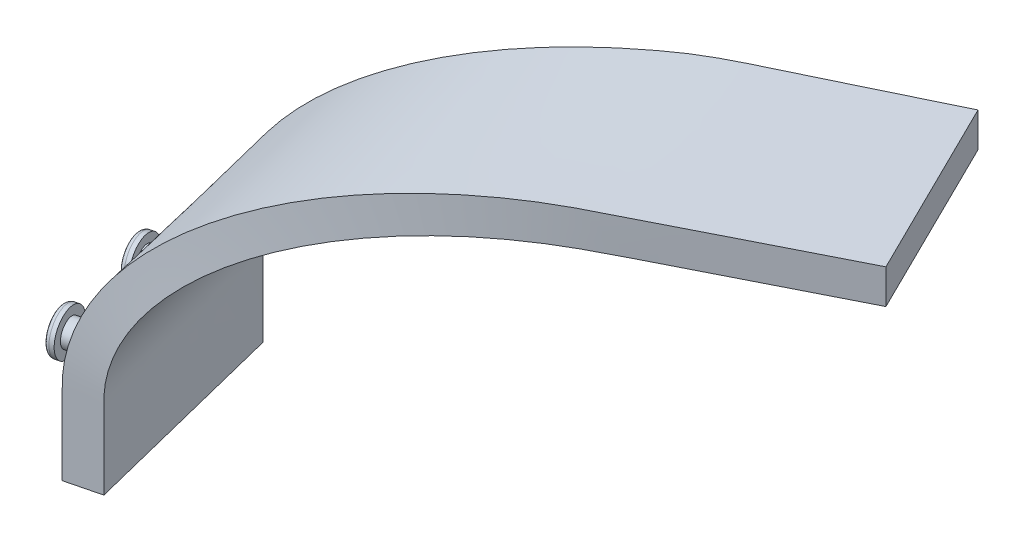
ISO-10303-21;
HEADER;
FILE_DESCRIPTION(('STEP AP214'),'2;1');
FILE_NAME('part.step','',(''),(''),'','','');
FILE_SCHEMA(('AUTOMOTIVE_DESIGN { 1 0 10303 214 1 1 1 1 }'));
ENDSEC;
DATA;
#1=APPLICATION_CONTEXT('core data for automotive mechanical design processes');
#2=APPLICATION_PROTOCOL_DEFINITION('international standard','automotive_design',2000,#1);
#3=PRODUCT_CONTEXT('',#1,'mechanical');
#4=PRODUCT('Part','Part','',(#3));
#5=PRODUCT_RELATED_PRODUCT_CATEGORY('part','',(#4));
#6=PRODUCT_DEFINITION_FORMATION('','',#4);
#7=PRODUCT_DEFINITION_CONTEXT('part definition',#1,'design');
#8=PRODUCT_DEFINITION('design','',#6,#7);
#9=PRODUCT_DEFINITION_SHAPE('','',#8);
#10=(LENGTH_UNIT() NAMED_UNIT(*) SI_UNIT(.MILLI.,.METRE.));
#11=(NAMED_UNIT(*) PLANE_ANGLE_UNIT() SI_UNIT($,.RADIAN.));
#12=(NAMED_UNIT(*) SI_UNIT($,.STERADIAN.) SOLID_ANGLE_UNIT());
#13=UNCERTAINTY_MEASURE_WITH_UNIT(LENGTH_MEASURE(1.E-05),#10,'distance_accuracy_value','');
#14=(GEOMETRIC_REPRESENTATION_CONTEXT(3) GLOBAL_UNCERTAINTY_ASSIGNED_CONTEXT((#13)) GLOBAL_UNIT_ASSIGNED_CONTEXT((#10,
#11,#12)) REPRESENTATION_CONTEXT('',''));
#15=CARTESIAN_POINT('',(0.,0.,0.));
#16=DIRECTION('',(0.,0.,1.));
#17=DIRECTION('',(1.,0.,0.));
#18=AXIS2_PLACEMENT_3D('',#15,#16,#17);
#19=CARTESIAN_POINT('',(-40.958936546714,37.2872000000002,46.0681167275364));
#20=DIRECTION('',(-0.89667182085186,0.,0.442695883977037));
#21=DIRECTION('',(-0.42954592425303,-0.241921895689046,-0.870036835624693));
#22=AXIS2_PLACEMENT_3D('',#19,#20,#21);
#23=PLANE('',#22);
#24=DIRECTION('',(0.,-1.,0.));
#25=VECTOR('',#24,1.);
#26=CARTESIAN_POINT('',(-40.958936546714,33.2872000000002,46.0681167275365));
#27=LINE('',#26,#25);
#28=CARTESIAN_POINT('',(-40.958936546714,37.2872000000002,46.0681167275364));
#29=VERTEX_POINT('',#28);
#30=CARTESIAN_POINT('',(-40.958936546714,33.2872000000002,46.0681167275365));
#31=VERTEX_POINT('',#30);
#32=EDGE_CURVE('E84',#29,#31,#27,.T.);
#33=ORIENTED_EDGE('',*,*,#32,.T.);
#34=DIRECTION('',(-0.442695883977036,0.,-0.89667182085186));
#35=VECTOR('',#34,1.);
#36=CARTESIAN_POINT('',(-40.958936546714,33.2872000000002,46.0681167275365));
#37=LINE('',#36,#35);
#38=CARTESIAN_POINT('',(-51.3958438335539,33.2871999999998,24.9283659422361));
#39=VERTEX_POINT('',#38);
#40=EDGE_CURVE('E245',#31,#39,#37,.T.);
#41=ORIENTED_EDGE('',*,*,#40,.T.);
#42=DIRECTION('',(0.,1.,0.));
#43=VECTOR('',#42,1.);
#44=CARTESIAN_POINT('',(-51.3958438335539,33.2871999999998,24.9283659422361));
#45=LINE('',#44,#43);
#46=CARTESIAN_POINT('',(-51.3958438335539,37.2871999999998,24.928365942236));
#47=VERTEX_POINT('',#46);
#48=EDGE_CURVE('E76',#39,#47,#45,.T.);
#49=ORIENTED_EDGE('',*,*,#48,.T.);
#50=DIRECTION('',(0.442695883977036,0.,0.89667182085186));
#51=VECTOR('',#50,1.);
#52=CARTESIAN_POINT('',(-40.958936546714,37.2872000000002,46.0681167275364));
#53=LINE('',#52,#51);
#54=EDGE_CURVE('E81',#47,#29,#53,.T.);
#55=ORIENTED_EDGE('',*,*,#54,.T.);
#56=EDGE_LOOP('',(#33,#41,#49,#55));
#57=FACE_BOUND('',#56,.T.);
#58=ADVANCED_FACE('F38',(#57),#23,.F.);
#59=CARTESIAN_POINT('',(-104.594392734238,0.,78.1789366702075));
#60=DIRECTION('',(0.,-1.,0.));
#61=DIRECTION('',(0.,0.,-1.));
#62=AXIS2_PLACEMENT_3D('',#59,#60,#61);
#63=PLANE('',#62);
#64=DIRECTION('',(0.970295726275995,0.,-0.241921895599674));
#65=VECTOR('',#64,1.);
#66=CARTESIAN_POINT('',(-100.713209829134,0.,77.2112490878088));
#67=LINE('',#66,#65);
#68=CARTESIAN_POINT('',(-104.594392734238,0.,78.1789366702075));
#69=VERTEX_POINT('',#68);
#70=CARTESIAN_POINT('',(-100.713209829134,0.,77.2112490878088));
#71=VERTEX_POINT('',#70);
#72=EDGE_CURVE('E112',#69,#71,#67,.T.);
#73=ORIENTED_EDGE('',*,*,#72,.F.);
#74=DIRECTION('',(0.241921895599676,0.,0.970295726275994));
#75=VECTOR('',#74,1.);
#76=CARTESIAN_POINT('',(-104.594392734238,0.,78.1789366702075));
#77=LINE('',#76,#75);
#78=CARTESIAN_POINT('',(-110.73920888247,0.,53.5334252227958));
#79=VERTEX_POINT('',#78);
#80=EDGE_CURVE('E109',#79,#69,#77,.T.);
#81=ORIENTED_EDGE('',*,*,#80,.F.);
#82=DIRECTION('',(-0.970295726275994,0.,0.241921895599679));
#83=VECTOR('',#82,1.);
#84=CARTESIAN_POINT('',(-106.858025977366,0.,52.5657376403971));
#85=LINE('',#84,#83);
#86=CARTESIAN_POINT('',(-106.858025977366,0.,52.5657376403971));
#87=VERTEX_POINT('',#86);
#88=EDGE_CURVE('E274',#87,#79,#85,.T.);
#89=ORIENTED_EDGE('',*,*,#88,.F.);
#90=DIRECTION('',(-0.241921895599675,0.,-0.970295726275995));
#91=VECTOR('',#90,1.);
#92=CARTESIAN_POINT('',(-100.713209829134,0.,77.2112490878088));
#93=LINE('',#92,#91);
#94=EDGE_CURVE('E163',#71,#87,#93,.T.);
#95=ORIENTED_EDGE('',*,*,#94,.F.);
#96=EDGE_LOOP('',(#73,#81,#89,#95));
#97=FACE_BOUND('',#96,.T.);
#98=ADVANCED_FACE('F132',(#97),#63,.T.);
#99=CARTESIAN_POINT('',(-110.73920888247,0.,53.5334252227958));
#100=CARTESIAN_POINT('',(-110.739173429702,0.528604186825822,53.5334084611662));
#101=CARTESIAN_POINT('',(-110.739102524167,1.5858125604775,53.5333749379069));
#102=CARTESIAN_POINT('',(-110.7397457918,3.51629606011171,53.5336790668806));
#103=CARTESIAN_POINT('',(-110.736922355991,5.05900053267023,53.532344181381));
#104=CARTESIAN_POINT('',(-110.739998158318,6.92988317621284,53.5337983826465));
#105=CARTESIAN_POINT('',(-110.747378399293,8.30169752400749,53.5372876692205));
#106=CARTESIAN_POINT('',(-110.739499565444,9.74768665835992,53.5335626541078));
#107=CARTESIAN_POINT('',(-110.722319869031,10.4352591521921,53.5254403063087));
#108=CARTESIAN_POINT('',(-110.663751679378,11.2281034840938,53.497725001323));
#109=CARTESIAN_POINT('',(-110.568899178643,12.1016220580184,53.452821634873));
#110=CARTESIAN_POINT('',(-110.4141906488,13.0108488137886,53.3795059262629));
#111=CARTESIAN_POINT('',(-110.22123056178,13.8728082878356,53.2879265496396));
#112=CARTESIAN_POINT('',(-110.058060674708,14.5010072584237,53.2104181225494));
#113=CARTESIAN_POINT('',(-109.84566695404,15.2058075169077,53.1093988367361));
#114=CARTESIAN_POINT('',(-109.480812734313,16.2688917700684,52.9356750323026));
#115=CARTESIAN_POINT('',(-109.017022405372,17.368760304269,52.7144522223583));
#116=CARTESIAN_POINT('',(-108.531404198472,18.3321247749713,52.4824142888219));
#117=CARTESIAN_POINT('',(-108.147344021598,19.0401489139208,52.2987713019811));
#118=CARTESIAN_POINT('',(-107.775746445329,19.6692613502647,52.1209264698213));
#119=CARTESIAN_POINT('',(-107.123484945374,20.6817031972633,51.8084945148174));
#120=CARTESIAN_POINT('',(-106.277905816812,21.8569486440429,51.4030726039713));
#121=CARTESIAN_POINT('',(-105.345399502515,22.9729170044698,50.9554339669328));
#122=CARTESIAN_POINT('',(-104.406864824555,23.9970788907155,50.5045883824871));
#123=CARTESIAN_POINT('',(-103.669742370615,24.7395433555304,50.1502993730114));
#124=CARTESIAN_POINT('',(-102.716670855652,25.6243838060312,49.691977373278));
#125=CARTESIAN_POINT('',(-101.860218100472,26.3663931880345,49.2799577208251));
#126=CARTESIAN_POINT('',(-100.900247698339,27.1384351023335,48.8179759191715));
#127=CARTESIAN_POINT('',(-99.6579887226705,28.0726213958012,48.2199624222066));
#128=CARTESIAN_POINT('',(-98.2188563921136,29.0508372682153,47.5268761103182));
#129=CARTESIAN_POINT('',(-96.06656008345,30.362556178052,46.4899199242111));
#130=CARTESIAN_POINT('',(-94.0818986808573,31.4176959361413,45.5333687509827));
#131=CARTESIAN_POINT('',(-92.3354868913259,32.2304752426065,44.6913809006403));
#132=CARTESIAN_POINT('',(-90.0710508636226,33.2227122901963,43.5995042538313));
#133=CARTESIAN_POINT('',(-88.0513252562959,33.9749664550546,42.6253351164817));
#134=CARTESIAN_POINT('',(-85.5973238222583,34.754089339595,41.4414569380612));
#135=CARTESIAN_POINT('',(-84.1901824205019,35.1663248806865,40.7625423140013));
#136=CARTESIAN_POINT('',(-81.8940367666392,35.761505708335,39.6545552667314));
#137=CARTESIAN_POINT('',(-79.929841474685,36.1868549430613,38.7065893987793));
#138=CARTESIAN_POINT('',(-78.2342589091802,36.498282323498,37.8881573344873));
#139=CARTESIAN_POINT('',(-77.4120706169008,36.6357452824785,37.4912745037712));
#140=CARTESIAN_POINT('',(-76.0854986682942,36.8440169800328,36.8508880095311));
#141=CARTESIAN_POINT('',(-74.3734542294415,37.0862250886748,36.0243497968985));
#142=CARTESIAN_POINT('',(-72.3113764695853,37.2374311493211,35.0286334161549));
#143=CARTESIAN_POINT('',(-69.8759804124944,37.3150406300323,33.8525696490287));
#144=CARTESIAN_POINT('',(-68.0416909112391,37.2949569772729,32.9667750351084));
#145=CARTESIAN_POINT('',(-65.4784523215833,37.2805933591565,31.7289658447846));
#146=CARTESIAN_POINT('',(-63.7492540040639,37.2868138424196,30.8939232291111));
#147=CARTESIAN_POINT('',(-61.2294423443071,37.2884947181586,29.6770868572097));
#148=CARTESIAN_POINT('',(-58.6880200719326,37.2865103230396,28.4498141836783));
#149=CARTESIAN_POINT('',(-55.2295429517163,37.2873939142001,26.7796889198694));
#150=CARTESIAN_POINT('',(-52.6665485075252,37.2872642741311,25.5419990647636));
#151=CARTESIAN_POINT('',(-51.3958438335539,37.2871999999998,24.928365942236));
#152=CARTESIAN_POINT('',(-109.919900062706,0.,56.8194934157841));
#153=CARTESIAN_POINT('',(-109.919814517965,0.528310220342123,56.8194517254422));
#154=CARTESIAN_POINT('',(-109.919643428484,1.58493066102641,56.8193683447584));
#155=CARTESIAN_POINT('',(-109.919533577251,3.50834241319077,56.8193042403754));
#156=CARTESIAN_POINT('',(-109.917394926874,5.06275502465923,56.8182916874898));
#157=CARTESIAN_POINT('',(-109.920715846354,6.92931201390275,56.8198840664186));
#158=CARTESIAN_POINT('',(-109.927044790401,8.27696047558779,56.8228954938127));
#159=CARTESIAN_POINT('',(-109.919765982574,9.74190568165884,56.8194227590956));
#160=CARTESIAN_POINT('',(-109.90009257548,10.4850648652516,56.8099733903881));
#161=CARTESIAN_POINT('',(-109.83630335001,11.3220863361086,56.7793603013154));
#162=CARTESIAN_POINT('',(-109.731351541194,12.2338823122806,56.7289571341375));
#163=CARTESIAN_POINT('',(-109.557785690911,13.1840108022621,56.6455139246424));
#164=CARTESIAN_POINT('',(-109.344476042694,14.0818749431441,56.5429045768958));
#165=CARTESIAN_POINT('',(-109.165598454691,14.7340014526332,56.4568277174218));
#166=CARTESIAN_POINT('',(-108.934762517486,15.4634112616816,56.3456788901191));
#167=CARTESIAN_POINT('',(-108.540948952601,16.5601094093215,56.1559486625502));
#168=CARTESIAN_POINT('',(-108.045228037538,17.6881778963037,55.9168933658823));
#169=CARTESIAN_POINT('',(-107.530108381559,18.6704446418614,55.6682324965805));
#170=CARTESIAN_POINT('',(-107.124167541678,19.3906996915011,55.4721944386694));
#171=CARTESIAN_POINT('',(-106.733346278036,20.0285942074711,55.283360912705));
#172=CARTESIAN_POINT('',(-106.050699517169,21.0519614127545,54.9533684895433));
#173=CARTESIAN_POINT('',(-105.170414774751,22.2353122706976,54.527599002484));
#174=CARTESIAN_POINT('',(-104.206098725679,23.3536904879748,54.0608558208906));
#175=CARTESIAN_POINT('',(-103.239315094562,24.3776411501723,53.5927252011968));
#176=CARTESIAN_POINT('',(-102.482446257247,25.1182338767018,53.226117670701));
#177=CARTESIAN_POINT('',(-101.506695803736,25.9986425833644,52.7533404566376));
#178=CARTESIAN_POINT('',(-100.631744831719,26.7352209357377,52.3293028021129));
#179=CARTESIAN_POINT('',(-99.6531983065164,27.5001808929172,51.8549590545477));
#180=CARTESIAN_POINT('',(-98.3895637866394,28.424030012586,51.2423116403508));
#181=CARTESIAN_POINT('',(-96.9297949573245,29.389125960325,50.5343894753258));
#182=CARTESIAN_POINT('',(-94.7513788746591,30.6789681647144,49.4776965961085));
#183=CARTESIAN_POINT('',(-92.7462023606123,31.7114206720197,48.5048046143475));
#184=CARTESIAN_POINT('',(-90.9847684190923,32.5037942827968,47.6500046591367));
#185=CARTESIAN_POINT('',(-88.7025651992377,33.469128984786,46.5423966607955));
#186=CARTESIAN_POINT('',(-86.6704080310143,34.1959647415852,45.5559593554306));
#187=CARTESIAN_POINT('',(-84.2041745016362,34.9433050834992,44.3586588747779));
#188=CARTESIAN_POINT('',(-82.7908273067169,35.3368716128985,43.6724656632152));
#189=CARTESIAN_POINT('',(-80.4866999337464,35.9012727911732,42.5536997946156));
#190=CARTESIAN_POINT('',(-78.5182254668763,36.2997637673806,41.597814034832));
#191=CARTESIAN_POINT('',(-76.8201018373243,36.5866655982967,40.773142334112));
#192=CARTESIAN_POINT('',(-75.9969494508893,36.7123248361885,40.3733729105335));
#193=CARTESIAN_POINT('',(-74.6690805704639,36.9004391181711,39.7284646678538));
#194=CARTESIAN_POINT('',(-72.955977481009,37.1121924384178,38.8964130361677));
#195=CARTESIAN_POINT('',(-70.8954321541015,37.2452148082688,37.8954926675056));
#196=CARTESIAN_POINT('',(-68.463436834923,37.3115026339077,36.7140903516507));
#197=CARTESIAN_POINT('',(-66.6316063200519,37.2929642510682,35.8242264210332));
#198=CARTESIAN_POINT('',(-64.0712336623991,37.2807542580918,34.580448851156));
#199=CARTESIAN_POINT('',(-62.3435857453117,37.2865938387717,33.7411903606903));
#200=CARTESIAN_POINT('',(-59.8262327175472,37.2894184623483,32.5183091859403));
#201=CARTESIAN_POINT('',(-57.2876051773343,37.2884314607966,31.2850954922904));
#202=CARTESIAN_POINT('',(-53.8334001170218,37.28796172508,29.6071168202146));
#203=CARTESIAN_POINT('',(-51.2734510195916,37.2874524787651,28.3635474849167));
#204=CARTESIAN_POINT('',(-50.0042561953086,37.2871999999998,27.746999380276));
#205=CARTESIAN_POINT('',(-109.049384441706,0.,60.310940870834));
#206=CARTESIAN_POINT('',(-109.049245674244,0.527997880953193,60.3108726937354));
#207=CARTESIAN_POINT('',(-109.048968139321,1.58399364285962,60.3107363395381));
#208=CARTESIAN_POINT('',(-109.048058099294,3.49989166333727,60.3102809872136));
#209=CARTESIAN_POINT('',(-109.046647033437,5.06674417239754,60.3096109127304));
#210=CARTESIAN_POINT('',(-109.050228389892,6.92870515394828,60.3113501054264));
#211=CARTESIAN_POINT('',(-109.055440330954,8.25067736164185,60.3138538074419));
#212=CARTESIAN_POINT('',(-109.048799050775,9.73576339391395,60.3106491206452));
#213=CARTESIAN_POINT('',(-109.026476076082,10.5379834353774,60.2997897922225));
#214=CARTESIAN_POINT('',(-108.957139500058,11.4219431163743,60.2660978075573));
#215=CARTESIAN_POINT('',(-108.841457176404,12.3744088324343,60.2098511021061));
#216=CARTESIAN_POINT('',(-108.647855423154,13.3679954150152,60.1156474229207));
#217=CARTESIAN_POINT('',(-108.412924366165,14.3040082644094,60.0013187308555));
#218=CARTESIAN_POINT('',(-108.217357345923,14.9815577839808,59.9061379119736));
#219=CARTESIAN_POINT('',(-107.966926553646,15.7371152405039,59.7842264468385));
#220=CARTESIAN_POINT('',(-107.542343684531,16.869528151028,59.5774893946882));
#221=CARTESIAN_POINT('',(-107.012696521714,18.0275590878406,59.3194870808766));
#222=CARTESIAN_POINT('',(-106.466231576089,19.0299095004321,59.0531643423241));
#223=CARTESIAN_POINT('',(-106.037042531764,19.7631598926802,58.8439565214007));
#224=CARTESIAN_POINT('',(-105.625796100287,20.4103853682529,58.6434475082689));
#225=CARTESIAN_POINT('',(-104.910864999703,21.4453607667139,58.2947970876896));
#226=CARTESIAN_POINT('',(-103.993705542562,22.6373236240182,57.8474083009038));
#227=CARTESIAN_POINT('',(-102.995591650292,23.7582623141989,57.3603665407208));
#228=CARTESIAN_POINT('',(-101.998793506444,24.7819885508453,56.8738705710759));
#229=CARTESIAN_POINT('',(-101.220944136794,25.5205925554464,56.4941746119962));
#230=CARTESIAN_POINT('',(-100.221097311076,26.396292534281,56.0060387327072));
#231=CARTESIAN_POINT('',(-99.3264919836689,27.1271004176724,55.5692319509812));
#232=CARTESIAN_POINT('',(-98.3282083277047,27.8845357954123,55.0817536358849));
#233=CARTESIAN_POINT('',(-97.0418622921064,28.7974016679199,54.4535576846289));
#234=CARTESIAN_POINT('',(-95.5601671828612,29.7485576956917,53.7298724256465));
#235=CARTESIAN_POINT('',(-93.3539988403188,31.0151559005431,52.6522093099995));
#236=CARTESIAN_POINT('',(-91.3270250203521,32.0235032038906,51.6619552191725));
#237=CARTESIAN_POINT('',(-89.5496300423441,32.794195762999,50.7935424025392));
#238=CARTESIAN_POINT('',(-87.2485491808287,33.7309467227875,49.669219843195));
#239=CARTESIAN_POINT('',(-85.2031834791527,34.4307754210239,48.6697476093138));
#240=CARTESIAN_POINT('',(-82.7239533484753,35.1443468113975,47.4581859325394));
#241=CARTESIAN_POINT('',(-81.3040124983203,35.5180775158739,46.764259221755));
#242=CARTESIAN_POINT('',(-78.9914045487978,36.0497753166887,45.6340408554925));
#243=CARTESIAN_POINT('',(-77.0183834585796,36.4197293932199,44.6697402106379));
#244=CARTESIAN_POINT('',(-75.3175599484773,36.6805728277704,43.8384388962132));
#245=CARTESIAN_POINT('',(-74.4933832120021,36.7936906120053,43.4356024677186));
#246=CARTESIAN_POINT('',(-73.1641363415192,36.960387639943,42.7858898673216));
#247=CARTESIAN_POINT('',(-71.4499084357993,37.1397827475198,41.9479802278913));
#248=CARTESIAN_POINT('',(-69.3909913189,37.2534849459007,40.9415306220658));
#249=CARTESIAN_POINT('',(-66.9626092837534,37.3077435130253,39.7544560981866));
#250=CARTESIAN_POINT('',(-65.1333914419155,37.2908469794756,38.8602685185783));
#251=CARTESIAN_POINT('',(-62.5760638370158,37.2809252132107,37.6101495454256));
#252=CARTESIAN_POINT('',(-60.8500632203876,37.2863600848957,36.7664116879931));
#253=CARTESIAN_POINT('',(-58.3353224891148,37.2903999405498,35.5371079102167));
#254=CARTESIAN_POINT('',(-55.7996643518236,37.2904726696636,34.2975818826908));
#255=CARTESIAN_POINT('',(-52.349998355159,37.2885650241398,32.6112589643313));
#256=CARTESIAN_POINT('',(-49.793284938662,37.2876524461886,31.3614426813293));
#257=CARTESIAN_POINT('',(-48.525694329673,37.2871999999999,30.7417974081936));
#258=CARTESIAN_POINT('',(-108.127662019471,0.,64.0077675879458));
#259=CARTESIAN_POINT('',(-108.12746689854,0.527667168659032,64.0076713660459));
#260=CARTESIAN_POINT('',(-108.127076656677,1.58300150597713,64.007478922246));
#261=CARTESIAN_POINT('',(-108.125319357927,3.49094381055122,64.0066093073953));
#262=CARTESIAN_POINT('',(-108.12467867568,5.07096797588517,64.0063018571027));
#263=CARTESIAN_POINT('',(-108.128535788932,6.92806259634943,64.00819649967));
#264=CARTESIAN_POINT('',(-108.13256502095,8.22284818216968,64.0101626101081));
#265=CARTESIAN_POINT('',(-108.126598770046,9.72925979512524,64.0072417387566));
#266=CARTESIAN_POINT('',(-108.101470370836,10.5940148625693,63.9948895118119));
#267=CARTESIAN_POINT('',(-108.026260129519,11.5276738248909,63.9579375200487));
#268=CARTESIAN_POINT('',(-107.899216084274,12.5232016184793,63.8955035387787));
#269=CARTESIAN_POINT('',(-107.684399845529,13.5628026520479,63.7899064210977));
#270=CARTESIAN_POINT('',(-107.426575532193,14.5392082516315,63.6631690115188));
#271=CARTESIAN_POINT('',(-107.213337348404,15.2436762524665,63.558348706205));
#272=CARTESIAN_POINT('',(-106.942159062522,16.0269194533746,63.4250415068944));
#273=CARTESIAN_POINT('',(-106.484996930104,17.1971479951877,63.2002972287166));
#274=CARTESIAN_POINT('',(-105.919427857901,18.3869038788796,62.9222333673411));
#275=CARTESIAN_POINT('',(-105.339773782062,19.4105193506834,62.6372098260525));
#276=CARTESIAN_POINT('',(-104.885968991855,20.1575295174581,62.414057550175));
#277=CARTESIAN_POINT('',(-104.453095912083,20.8146348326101,62.201186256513));
#278=CARTESIAN_POINT('',(-103.703981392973,21.8619012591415,61.8327803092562));
#279=CARTESIAN_POINT('',(-102.747778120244,23.0629827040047,61.3625004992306));
#280=CARTESIAN_POINT('',(-101.713878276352,24.186632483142,60.8539661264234));
#281=CARTESIAN_POINT('',(-100.685300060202,25.2101210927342,60.3480244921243));
#282=CARTESIAN_POINT('',(-99.8852360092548,25.9466193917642,59.9544701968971));
#283=CARTESIAN_POINT('',(-98.8598753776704,26.817333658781,59.4500722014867));
#284=CARTESIAN_POINT('',(-97.9445593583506,27.5422964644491,58.9997944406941));
#285=CARTESIAN_POINT('',(-96.925277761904,28.291499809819,58.4983596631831));
#286=CARTESIAN_POINT('',(-95.6148842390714,29.1927363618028,57.8537005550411));
#287=CARTESIAN_POINT('',(-94.1099730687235,30.1291324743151,57.1133249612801));
#288=CARTESIAN_POINT('',(-91.874419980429,31.3711193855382,56.0134580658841));
#289=CARTESIAN_POINT('',(-89.8243666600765,32.3539435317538,55.0048205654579));
#290=CARTESIAN_POINT('',(-88.0300717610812,33.1016796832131,54.1219941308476));
#291=CARTESIAN_POINT('',(-85.7090028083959,34.0081655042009,52.9799738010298));
#292=CARTESIAN_POINT('',(-83.6496516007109,34.6793984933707,51.9666998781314));
#293=CARTESIAN_POINT('',(-81.1565020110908,35.3567224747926,50.7399599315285));
#294=CARTESIAN_POINT('',(-79.7297379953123,35.7099425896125,50.0379229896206));
#295=CARTESIAN_POINT('',(-77.4081506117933,36.2070132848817,48.8955784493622));
#296=CARTESIAN_POINT('',(-75.4303154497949,36.5467518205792,47.9223679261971));
#297=CARTESIAN_POINT('',(-73.7266332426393,36.7800040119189,47.084047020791));
#298=CARTESIAN_POINT('',(-72.9013719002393,36.879842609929,46.6779631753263));
#299=CARTESIAN_POINT('',(-71.5706659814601,37.0238625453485,46.0231636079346));
#300=CARTESIAN_POINT('',(-69.8552470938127,37.1689960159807,45.1790513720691));
#301=CARTESIAN_POINT('',(-67.7980539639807,37.2622415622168,44.1667472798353));
#302=CARTESIAN_POINT('',(-65.3734977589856,37.3037632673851,42.9736668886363));
#303=CARTESIAN_POINT('',(-63.5470462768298,37.2886051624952,42.0749013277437));
#304=CARTESIAN_POINT('',(-60.9929428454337,37.2811062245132,40.8180679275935));
#305=CARTESIAN_POINT('',(-59.2686864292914,37.2861125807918,39.9695872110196));
#306=CARTESIAN_POINT('',(-56.7567116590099,37.2914391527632,38.7334830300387));
#307=CARTESIAN_POINT('',(-54.2241975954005,37.2926339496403,37.4872733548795));
#308=CARTESIAN_POINT('',(-50.7793376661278,37.2892038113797,35.7921153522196));
#309=CARTESIAN_POINT('',(-48.2260502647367,37.2878641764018,34.5356846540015));
#310=CARTESIAN_POINT('',(-46.960158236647,37.2872,33.9127600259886));
#311=CARTESIAN_POINT('',(-107.974041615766,0.,64.6239053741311));
#312=CARTESIAN_POINT('',(-107.973837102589,0.527612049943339,64.6238044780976));
#313=CARTESIAN_POINT('',(-107.973428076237,1.58283614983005,64.6236026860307));
#314=CARTESIAN_POINT('',(-107.971529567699,3.48945250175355,64.6226640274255));
#315=CARTESIAN_POINT('',(-107.97101728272,5.0716719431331,64.6224170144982));
#316=CARTESIAN_POINT('',(-107.974920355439,6.92795550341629,64.6243375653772));
#317=CARTESIAN_POINT('',(-107.978752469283,8.21820998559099,64.6262140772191));
#318=CARTESIAN_POINT('',(-107.972898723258,9.72817586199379,64.6233405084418));
#319=CARTESIAN_POINT('',(-107.947302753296,10.603353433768,64.6107394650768));
#320=CARTESIAN_POINT('',(-107.871113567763,11.5452956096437,64.5732441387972));
#321=CARTESIAN_POINT('',(-107.742175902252,12.5480004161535,64.5097789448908));
#322=CARTESIAN_POINT('',(-107.523823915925,13.5952705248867,64.4022829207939));
#323=CARTESIAN_POINT('',(-107.262184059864,14.5784082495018,64.2734773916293));
#324=CARTESIAN_POINT('',(-107.046000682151,15.2873626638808,64.1670505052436));
#325=CARTESIAN_POINT('',(-106.771364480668,16.0752201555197,64.0318440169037));
#326=CARTESIAN_POINT('',(-106.308772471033,17.2517513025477,63.8040985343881));
#327=CARTESIAN_POINT('',(-105.737216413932,18.4467946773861,63.5226910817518));
#328=CARTESIAN_POINT('',(-105.152030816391,19.4739543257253,63.2345507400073));
#329=CARTESIAN_POINT('',(-104.69412340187,20.2232577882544,63.009074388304));
#330=CARTESIAN_POINT('',(-104.257645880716,20.8820097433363,62.7941427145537));
#331=CARTESIAN_POINT('',(-103.502834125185,21.9313246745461,62.4224441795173));
#332=CARTESIAN_POINT('',(-102.540123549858,23.1339258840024,61.9483491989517));
#333=CARTESIAN_POINT('',(-101.500259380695,24.2580275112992,61.4362327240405));
#334=CARTESIAN_POINT('',(-100.466384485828,25.2814765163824,60.9270501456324));
#335=CARTESIAN_POINT('',(-99.6626179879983,26.0176238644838,60.5311861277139));
#336=CARTESIAN_POINT('',(-98.6330050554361,26.8875071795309,60.0240777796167));
#337=CARTESIAN_POINT('',(-97.7142393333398,27.6115013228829,59.5715558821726));
#338=CARTESIAN_POINT('',(-96.6914560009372,28.3593271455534,59.0677940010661));
#339=CARTESIAN_POINT('',(-95.3770545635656,29.2586254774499,58.4203910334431));
#340=CARTESIAN_POINT('',(-93.8682740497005,30.1925616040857,57.677233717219));
#341=CARTESIAN_POINT('',(-91.6278235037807,31.4304466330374,56.5736661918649));
#342=CARTESIAN_POINT('',(-89.5739236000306,32.409016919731,55.5619647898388));
#343=CARTESIAN_POINT('',(-87.7768120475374,33.1529270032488,54.6767360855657));
#344=CARTESIAN_POINT('',(-85.4524117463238,34.0543686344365,53.5317661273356));
#345=CARTESIAN_POINT('',(-83.3907296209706,34.7208356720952,52.5161919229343));
#346=CARTESIAN_POINT('',(-80.8952568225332,35.3921081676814,51.2869206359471));
#347=CARTESIAN_POINT('',(-79.4673589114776,35.7419201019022,50.5835336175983));
#348=CARTESIAN_POINT('',(-77.1442749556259,36.2332196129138,49.4391680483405));
#349=CARTESIAN_POINT('',(-75.1656374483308,36.567922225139,48.464472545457));
#350=CARTESIAN_POINT('',(-73.4614787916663,36.7965758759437,47.6249817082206));
#351=CARTESIAN_POINT('',(-72.6360366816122,36.8942012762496,47.2183566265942));
#352=CARTESIAN_POINT('',(-71.3050875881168,37.0344416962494,46.5627092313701));
#353=CARTESIAN_POINT('',(-69.5894702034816,37.1738648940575,45.7175632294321));
#354=CARTESIAN_POINT('',(-67.5325644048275,37.2637009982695,44.7042833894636));
#355=CARTESIAN_POINT('',(-65.108645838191,37.3030998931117,43.5102020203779));
#356=CARTESIAN_POINT('',(-63.2826554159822,37.2882315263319,42.6106734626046));
#357=CARTESIAN_POINT('',(-60.7290893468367,37.2811363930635,41.3527209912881));
#358=CARTESIAN_POINT('',(-59.0051236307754,37.2860713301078,40.5034497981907));
#359=CARTESIAN_POINT('',(-56.4936098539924,37.2916123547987,39.2662122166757));
#360=CARTESIAN_POINT('',(-53.9616198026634,37.2929941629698,38.0188886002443));
#361=CARTESIAN_POINT('',(-50.5175608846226,37.2893102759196,36.3222580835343));
#362=CARTESIAN_POINT('',(-47.9648444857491,37.2878994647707,35.0647249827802));
#363=CARTESIAN_POINT('',(-46.699235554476,37.2872,34.4412537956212));
#364=CARTESIAN_POINT('',(-107.82042121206,0.,65.2400431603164));
#365=CARTESIAN_POINT('',(-107.820207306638,0.527556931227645,65.2399375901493));
#366=CARTESIAN_POINT('',(-107.819779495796,1.58267079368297,65.2397264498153));
#367=CARTESIAN_POINT('',(-107.817739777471,3.48796119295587,65.2387187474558));
#368=CARTESIAN_POINT('',(-107.817355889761,5.07237591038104,65.2385321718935));
#369=CARTESIAN_POINT('',(-107.821304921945,6.92784841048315,65.2404786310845));
#370=CARTESIAN_POINT('',(-107.824939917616,8.21357178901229,65.2422655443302));
#371=CARTESIAN_POINT('',(-107.81919867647,9.72709192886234,65.2394392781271));
#372=CARTESIAN_POINT('',(-107.793135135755,10.6126920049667,65.2265894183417));
#373=CARTESIAN_POINT('',(-107.715967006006,11.5629173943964,65.1885507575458));
#374=CARTESIAN_POINT('',(-107.585135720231,12.5727992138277,65.124054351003));
#375=CARTESIAN_POINT('',(-107.36324798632,13.6277383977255,65.01465942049));
#376=CARTESIAN_POINT('',(-107.097792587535,14.6176082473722,64.8837857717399));
#377=CARTESIAN_POINT('',(-106.878664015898,15.3310490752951,64.7757523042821));
#378=CARTESIAN_POINT('',(-106.600569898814,16.1235208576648,64.638646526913));
#379=CARTESIAN_POINT('',(-106.132548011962,17.3063546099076,64.4078998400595));
#380=CARTESIAN_POINT('',(-105.555004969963,18.5066854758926,64.1231487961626));
#381=CARTESIAN_POINT('',(-104.96428785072,19.5373893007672,63.831891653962));
#382=CARTESIAN_POINT('',(-104.502277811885,20.2889860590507,63.6040912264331));
#383=CARTESIAN_POINT('',(-104.062195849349,20.9493846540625,63.3870991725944));
#384=CARTESIAN_POINT('',(-103.301686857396,22.0007480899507,63.0121080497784));
#385=CARTESIAN_POINT('',(-102.332468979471,23.2048690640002,62.5341978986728));
#386=CARTESIAN_POINT('',(-101.286640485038,24.3294225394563,62.0184993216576));
#387=CARTESIAN_POINT('',(-100.247468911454,25.3528319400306,61.5060757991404));
#388=CARTESIAN_POINT('',(-99.4399999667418,26.0886283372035,61.1079020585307));
#389=CARTESIAN_POINT('',(-98.4061347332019,26.9576807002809,60.5980833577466));
#390=CARTESIAN_POINT('',(-97.4839215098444,27.6807120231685,60.1433184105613));
#391=CARTESIAN_POINT('',(-96.4576342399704,28.4271544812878,59.6372283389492));
#392=CARTESIAN_POINT('',(-95.1392248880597,29.3245145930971,58.9870815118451));
#393=CARTESIAN_POINT('',(-93.6265750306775,30.2559907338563,58.2411424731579));
#394=CARTESIAN_POINT('',(-91.3812270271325,31.4897738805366,57.1338743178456));
#395=CARTESIAN_POINT('',(-89.3234805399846,32.4640903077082,56.1191090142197));
#396=CARTESIAN_POINT('',(-87.5235523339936,33.2041743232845,55.2314780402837));
#397=CARTESIAN_POINT('',(-85.1958206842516,34.100571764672,54.0835584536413));
#398=CARTESIAN_POINT('',(-83.1318076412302,34.7622728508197,53.0656839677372));
#399=CARTESIAN_POINT('',(-80.6340081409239,35.4274830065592,51.833879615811));
#400=CARTESIAN_POINT('',(-79.2049798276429,35.773897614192,51.1291442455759));
#401=CARTESIAN_POINT('',(-76.8803992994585,36.259425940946,49.9827576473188));
#402=CARTESIAN_POINT('',(-74.9009594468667,36.5890926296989,49.0065771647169));
#403=CARTESIAN_POINT('',(-73.1963243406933,36.8131477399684,48.1659163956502));
#404=CARTESIAN_POINT('',(-72.370701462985,36.9085599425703,47.7587500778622));
#405=CARTESIAN_POINT('',(-71.0395091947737,37.0450208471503,47.1022548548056));
#406=CARTESIAN_POINT('',(-69.3236933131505,37.1787337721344,46.2560750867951));
#407=CARTESIAN_POINT('',(-67.2670748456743,37.2651604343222,45.2418194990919));
#408=CARTESIAN_POINT('',(-64.8437939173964,37.3024365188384,44.0467371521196));
#409=CARTESIAN_POINT('',(-63.0182645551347,37.2878578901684,43.1464455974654));
#410=CARTESIAN_POINT('',(-60.4652358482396,37.2811665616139,41.8873740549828));
#411=CARTESIAN_POINT('',(-58.7415608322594,37.2860300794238,41.0373123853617));
#412=CARTESIAN_POINT('',(-56.230508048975,37.2917855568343,39.7989414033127));
#413=CARTESIAN_POINT('',(-53.6990420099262,37.2933543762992,38.5505038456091));
#414=CARTESIAN_POINT('',(-50.2557841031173,37.2894167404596,36.8524008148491));
#415=CARTESIAN_POINT('',(-47.7036387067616,37.2879347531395,35.5937653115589));
#416=CARTESIAN_POINT('',(-46.438312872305,37.2872,34.9697475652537));
#417=CARTESIAN_POINT('',(-107.718007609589,0.,65.6508016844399));
#418=CARTESIAN_POINT('',(-107.717787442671,0.527520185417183,65.6506929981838));
#419=CARTESIAN_POINT('',(-107.717347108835,1.58256055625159,65.6504756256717));
#420=CARTESIAN_POINT('',(-107.715213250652,3.48696698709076,65.6494218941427));
#421=CARTESIAN_POINT('',(-107.714914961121,5.07284522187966,65.6492756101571));
#422=CARTESIAN_POINT('',(-107.71889463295,6.92777701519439,65.6512393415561));
#423=CARTESIAN_POINT('',(-107.722398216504,8.21047965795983,65.6529665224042));
#424=CARTESIAN_POINT('',(-107.716731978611,9.72636930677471,65.6501717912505));
#425=CARTESIAN_POINT('',(-107.690356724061,10.6189177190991,65.6371560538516));
#426=CARTESIAN_POINT('',(-107.612535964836,11.5746652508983,65.5987551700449));
#427=CARTESIAN_POINT('',(-107.480442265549,12.5893317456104,65.533571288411));
#428=CARTESIAN_POINT('',(-107.256197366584,13.6493836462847,65.4229104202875));
#429=CARTESIAN_POINT('',(-106.98819827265,14.6437415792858,65.2906580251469));
#430=CARTESIAN_POINT('',(-106.767106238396,15.3601733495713,65.1815535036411));
#431=CARTESIAN_POINT('',(-106.486706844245,16.1557213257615,65.0431815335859));
#432=CARTESIAN_POINT('',(-106.015065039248,17.3427568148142,64.8104340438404));
#433=CARTESIAN_POINT('',(-105.433530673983,18.546612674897,64.5234539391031));
#434=CARTESIAN_POINT('',(-104.839125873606,19.5796792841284,64.2301189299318));
#435=CARTESIAN_POINT('',(-104.374380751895,20.3328049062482,64.0007691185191));
#436=CARTESIAN_POINT('',(-103.931895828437,20.9943012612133,63.7824034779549));
#437=CARTESIAN_POINT('',(-103.167588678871,22.0470303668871,63.4052172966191));
#438=CARTESIAN_POINT('',(-102.194032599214,23.252164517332,62.9247636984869));
#439=CARTESIAN_POINT('',(-101.144227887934,24.3770192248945,62.4066770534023));
#440=CARTESIAN_POINT('',(-100.101525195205,25.4004022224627,61.8920929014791));
#441=CARTESIAN_POINT('',(-99.2915879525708,26.1359646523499,61.4923793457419));
#442=CARTESIAN_POINT('',(-98.2548878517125,27.0044630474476,60.9807537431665));
#443=CARTESIAN_POINT('',(-97.3303778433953,27.7268566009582,60.5244941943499));
#444=CARTESIAN_POINT('',(-96.3017530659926,28.4723727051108,60.0168512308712));
#445=CARTESIAN_POINT('',(-94.9806717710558,29.3684406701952,59.3648751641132));
#446=CARTESIAN_POINT('',(-93.4654423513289,30.29827682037,58.6170816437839));
#447=CARTESIAN_POINT('',(-91.2168293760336,31.5293253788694,57.5073464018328));
#448=CARTESIAN_POINT('',(-89.1565184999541,32.500805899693,56.4905384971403));
#449=CARTESIAN_POINT('',(-87.3547125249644,33.2383392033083,55.6013060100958));
#450=CARTESIAN_POINT('',(-85.0247599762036,34.1313738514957,54.4514200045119));
#451=CARTESIAN_POINT('',(-82.95919298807,34.789897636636,53.4320119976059));
#452=CARTESIAN_POINT('',(-80.4598398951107,35.4510585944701,52.1985177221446));
#453=CARTESIAN_POINT('',(-79.0300604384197,35.7952159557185,51.4928846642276));
#454=CARTESIAN_POINT('',(-76.7044821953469,36.2768968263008,50.3451507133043));
#455=CARTESIAN_POINT('',(-74.7245074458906,36.6032062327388,49.3679802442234));
#456=CARTESIAN_POINT('',(-73.0195547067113,36.8241956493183,48.5265395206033));
#457=CARTESIAN_POINT('',(-72.1938113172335,36.918132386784,48.1190123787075));
#458=CARTESIAN_POINT('',(-70.862456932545,37.0520736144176,47.4619519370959));
#459=CARTESIAN_POINT('',(-69.1465087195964,37.1819796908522,46.6150829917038));
#460=CARTESIAN_POINT('',(-67.0900818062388,37.2661333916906,45.6001769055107));
#461=CARTESIAN_POINT('',(-64.6672259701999,37.3019942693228,44.4044272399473));
#462=CARTESIAN_POINT('',(-62.8420039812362,37.2876087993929,43.503627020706));
#463=CARTESIAN_POINT('',(-60.2893335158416,37.2811866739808,42.2438094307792));
#464=CARTESIAN_POINT('',(-58.5658522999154,37.2860025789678,41.3932207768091));
#465=CARTESIAN_POINT('',(-56.05510684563,37.291901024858,40.154094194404));
#466=CARTESIAN_POINT('',(-53.5239901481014,37.2935945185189,38.9049140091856));
#467=CARTESIAN_POINT('',(-50.0812662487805,37.2894877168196,37.2058293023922));
#468=CARTESIAN_POINT('',(-47.5295015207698,37.2879582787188,35.9464588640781));
#469=CARTESIAN_POINT('',(-46.2643644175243,37.2872,35.3220767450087));
#470=CARTESIAN_POINT('',(-107.615594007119,0.,66.0615602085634));
#471=CARTESIAN_POINT('',(-107.615368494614,0.5275564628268,66.0614488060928));
#472=CARTESIAN_POINT('',(-107.614917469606,1.58266938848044,66.0612260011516));
#473=CARTESIAN_POINT('',(-107.612713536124,3.48717179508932,66.0601372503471));
#474=CARTESIAN_POINT('',(-107.612452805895,5.07381951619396,66.060008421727));
#475=CARTESIAN_POINT('',(-107.616481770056,6.92743152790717,66.0619986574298));
#476=CARTESIAN_POINT('',(-107.619954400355,8.20777370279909,66.0637141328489));
#477=CARTESIAN_POINT('',(-107.614309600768,9.72664107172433,66.0609260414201));
#478=CARTESIAN_POINT('',(-107.587646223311,10.6247269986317,66.0477558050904));
#479=CARTESIAN_POINT('',(-107.509098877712,11.5857718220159,66.0089576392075));
#480=CARTESIAN_POINT('',(-107.375690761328,12.6056516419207,65.9430611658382));
#481=CARTESIAN_POINT('',(-107.149176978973,13.6711538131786,65.8311762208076));
#482=CARTESIAN_POINT('',(-106.87873389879,14.6700496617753,65.6975940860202));
#483=CARTESIAN_POINT('',(-106.655743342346,15.3894476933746,65.5874510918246));
#484=CARTESIAN_POINT('',(-106.373083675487,16.187981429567,65.4478359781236));
#485=CARTESIAN_POINT('',(-105.897843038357,17.3790503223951,65.2130994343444));
#486=CARTESIAN_POINT('',(-105.312236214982,18.5863122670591,64.9238508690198));
#487=CARTESIAN_POINT('',(-104.713965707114,19.6219592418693,64.6283484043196));
#488=CARTESIAN_POINT('',(-104.246369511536,20.3767794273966,64.3973906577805));
#489=CARTESIAN_POINT('',(-103.801408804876,21.0394951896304,64.177614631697));
#490=CARTESIAN_POINT('',(-103.033428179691,22.0934655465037,63.798296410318));
#491=CARTESIAN_POINT('',(-102.055885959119,23.2991796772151,63.3154770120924));
#492=CARTESIAN_POINT('',(-101.001798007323,24.4246495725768,62.7948471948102));
#493=CARTESIAN_POINT('',(-99.9553914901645,25.4481686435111,62.2780149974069));
#494=CARTESIAN_POINT('',(-99.1430557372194,26.1834078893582,61.8767966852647));
#495=CARTESIAN_POINT('',(-98.1036327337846,27.0512233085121,61.3634203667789));
#496=CARTESIAN_POINT('',(-97.1768434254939,27.7729428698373,60.9056747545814));
#497=CARTESIAN_POINT('',(-96.1458715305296,28.5175678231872,60.3964737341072));
#498=CARTESIAN_POINT('',(-94.8220723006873,29.4123706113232,59.7426455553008));
#499=CARTESIAN_POINT('',(-93.3041734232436,30.3405681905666,58.9929532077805));
#500=CARTESIAN_POINT('',(-91.0521810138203,31.5688854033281,57.8806942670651));
#501=CARTESIAN_POINT('',(-88.989292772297,32.5375551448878,56.8618371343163));
#502=CARTESIAN_POINT('',(-87.1856153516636,33.2725174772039,55.9710059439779));
#503=CARTESIAN_POINT('',(-84.8534495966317,34.1621603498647,54.8191569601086));
#504=CARTESIAN_POINT('',(-82.786352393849,34.8175038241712,53.798226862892));
#505=CARTESIAN_POINT('',(-80.2855226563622,35.4746471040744,52.5630804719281));
#506=CARTESIAN_POINT('',(-78.8550209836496,35.816522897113,51.8565639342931));
#507=CARTESIAN_POINT('',(-76.5284956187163,36.294367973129,50.7075077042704));
#508=CARTESIAN_POINT('',(-74.5479920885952,36.6173383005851,49.7293507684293));
#509=CARTESIAN_POINT('',(-72.8427483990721,36.8352616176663,48.8871437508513));
#510=CARTESIAN_POINT('',(-72.0169013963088,36.9276906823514,48.4792643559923));
#511=CARTESIAN_POINT('',(-70.6854243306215,37.0590872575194,47.8216585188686));
#512=CARTESIAN_POINT('',(-68.9694201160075,37.1854112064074,46.9741384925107));
#513=CARTESIAN_POINT('',(-66.9131661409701,37.2669934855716,45.958572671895));
#514=CARTESIAN_POINT('',(-64.4906359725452,37.3015244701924,44.7621064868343));
#515=CARTESIAN_POINT('',(-62.6656785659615,37.2874670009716,43.8607764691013));
#516=CARTESIAN_POINT('',(-60.1133748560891,37.2812863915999,42.6002170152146));
#517=CARTESIAN_POINT('',(-58.3901383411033,37.2860075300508,41.7491264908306));
#518=CARTESIAN_POINT('',(-55.8797512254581,37.2918870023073,40.5092694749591));
#519=CARTESIAN_POINT('',(-53.348997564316,37.2936161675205,39.2593534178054));
#520=CARTESIAN_POINT('',(-49.9067691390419,37.2894880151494,37.5592680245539));
#521=CARTESIAN_POINT('',(-47.355371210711,37.2879583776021,36.2991558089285));
#522=CARTESIAN_POINT('',(-46.0904159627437,37.2872,35.6744059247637));
#523=CARTESIAN_POINT('',(-107.513180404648,0.,66.4723187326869));
#524=CARTESIAN_POINT('',(-107.512950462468,0.527665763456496,66.4722050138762));
#525=CARTESIAN_POINT('',(-107.512490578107,1.58299729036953,66.4719775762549));
#526=CARTESIAN_POINT('',(-107.510240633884,3.48857561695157,66.4708648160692));
#527=CARTESIAN_POINT('',(-107.509969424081,5.07529879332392,66.4707306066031));
#528=CARTESIAN_POINT('',(-107.514066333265,6.9268119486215,66.4727565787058));
#529=CARTESIAN_POINT('',(-107.517608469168,8.20545392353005,66.4745083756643));
#530=CARTESIAN_POINT('',(-107.51193154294,9.72790722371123,66.4717020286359));
#531=CARTESIAN_POINT('',(-107.485003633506,10.6301198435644,66.458388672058));
#532=CARTESIAN_POINT('',(-107.405655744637,11.5962371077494,66.4191581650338));
#533=CARTESIAN_POINT('',(-107.270881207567,12.6217589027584,66.3525239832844));
#534=CARTESIAN_POINT('',(-107.042186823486,13.6930488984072,66.2394568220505));
#535=CARTESIAN_POINT('',(-106.769399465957,14.6965324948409,66.1045939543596));
#536=CARTESIAN_POINT('',(-106.544575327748,15.4188721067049,65.9934450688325));
#537=CARTESIAN_POINT('',(-106.259700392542,16.2203011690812,65.8526098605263));
#538=CARTESIAN_POINT('',(-105.780882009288,17.4152351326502,65.6158960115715));
#539=CARTESIAN_POINT('',(-105.191121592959,18.625784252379,65.3243395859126));
#540=CARTESIAN_POINT('',(-104.588807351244,19.6642291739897,65.0265800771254));
#541=CARTESIAN_POINT('',(-104.118244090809,20.4209096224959,64.7939558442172));
#542=CARTESIAN_POINT('',(-103.670734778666,21.0849664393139,64.5727326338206));
#543=CARTESIAN_POINT('',(-102.899205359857,22.1400536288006,64.1913453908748));
#544=CARTESIAN_POINT('',(-101.918029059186,23.3459145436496,63.7063378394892));
#545=CARTESIAN_POINT('',(-100.859350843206,24.4723135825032,63.1830097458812));
#546=CARTESIAN_POINT('',(-99.8090677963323,25.4961312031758,62.6638420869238));
#547=CARTESIAN_POINT('',(-98.9944033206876,26.2309580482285,62.261154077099));
#548=CARTESIAN_POINT('',(-97.9523693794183,27.0979614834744,61.7460832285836));
#549=CARTESIAN_POINT('',(-97.0233174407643,27.8189686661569,61.2868596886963));
#550=CARTESIAN_POINT('',(-95.9899896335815,28.5627398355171,60.776095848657));
#551=CARTESIAN_POINT('',(-94.6634264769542,29.4563044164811,60.1203926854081));
#552=CARTESIAN_POINT('',(-93.1427682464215,30.382864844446,59.3687571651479));
#553=CARTESIAN_POINT('',(-90.8872819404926,31.6084539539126,58.2539179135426));
#554=CARTESIAN_POINT('',(-88.8218033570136,32.5743380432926,57.2330049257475));
#555=CARTESIAN_POINT('',(-87.0162608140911,33.3067091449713,56.3405778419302));
#556=CARTESIAN_POINT('',(-84.6818895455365,34.1929312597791,55.1867693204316));
#557=CARTESIAN_POINT('',(-82.6132858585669,34.8450914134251,54.1643285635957));
#558=CARTESIAN_POINT('',(-80.1110577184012,35.4982525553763,52.9275685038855));
#559=CARTESIAN_POINT('',(-78.6798614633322,35.8378184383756,52.2201820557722));
#560=CARTESIAN_POINT('',(-76.3524395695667,36.3118393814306,51.0698286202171));
#561=CARTESIAN_POINT('',(-74.3714133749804,36.6314888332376,50.0906887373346));
#562=CARTESIAN_POINT('',(-72.6659054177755,36.8463456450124,49.2477290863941));
#563=CARTESIAN_POINT('',(-71.8399717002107,36.9372348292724,48.8395060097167));
#564=CARTESIAN_POINT('',(-70.5084113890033,37.0660617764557,48.1813746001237));
#565=CARTESIAN_POINT('',(-68.7924275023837,37.1890283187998,47.333241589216));
#566=CARTESIAN_POINT('',(-66.7363278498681,37.267740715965,46.3170067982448));
#567=CARTESIAN_POINT('',(-64.3140239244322,37.3010271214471,45.1197748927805));
#568=CARTESIAN_POINT('',(-62.4892883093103,37.2874324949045,44.2178939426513));
#569=CARTESIAN_POINT('',(-59.9373598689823,37.2814657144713,42.9565968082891));
#570=CARTESIAN_POINT('',(-58.2144189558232,37.2860449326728,42.1050295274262));
#571=CARTESIAN_POINT('',(-55.7044411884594,37.2917434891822,40.8644672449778));
#572=CARTESIAN_POINT('',(-53.1740642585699,37.2934193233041,39.6138220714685));
#573=CARTESIAN_POINT('',(-49.7322927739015,37.2894176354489,37.912716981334));
#574=CARTESIAN_POINT('',(-47.1812477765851,37.2879350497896,36.6518561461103));
#575=CARTESIAN_POINT('',(-45.916467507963,37.2872,36.0267351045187));
#576=CARTESIAN_POINT('',(-107.359560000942,0.,67.0884565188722));
#577=CARTESIAN_POINT('',(-107.359323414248,0.527829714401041,67.0883393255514));
#578=CARTESIAN_POINT('',(-107.358850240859,1.58348914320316,67.0881049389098));
#579=CARTESIAN_POINT('',(-107.356531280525,3.49068134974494,67.0869561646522));
#580=CARTESIAN_POINT('',(-107.356244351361,5.07751770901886,67.0868138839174));
#581=CARTESIAN_POINT('',(-107.360443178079,6.92588257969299,67.0888934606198));
#582=CARTESIAN_POINT('',(-107.364089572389,8.2019742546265,67.0906997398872));
#583=CARTESIAN_POINT('',(-107.358364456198,9.72980645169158,67.0878660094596));
#584=CARTESIAN_POINT('',(-107.331039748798,10.6382091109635,67.0743379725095));
#585=CARTESIAN_POINT('',(-107.250491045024,11.6119350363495,67.0344589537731));
#586=CARTESIAN_POINT('',(-107.113666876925,12.645919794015,66.9667182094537));
#587=CARTESIAN_POINT('',(-106.881701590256,13.7258915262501,66.8518777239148));
#588=CARTESIAN_POINT('',(-106.605397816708,14.7362567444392,66.7150937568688));
#589=CARTESIAN_POINT('',(-106.37782330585,15.4630087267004,66.6024360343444));
#590=CARTESIAN_POINT('',(-106.089625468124,16.2687807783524,66.4597706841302));
#591=CARTESIAN_POINT('',(-105.605440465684,17.4695123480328,66.2200908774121));
#592=CARTESIAN_POINT('',(-105.009449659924,18.6849922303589,65.9250726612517));
#593=CARTESIAN_POINT('',(-104.401069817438,19.7276340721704,65.6239275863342));
#594=CARTESIAN_POINT('',(-103.926055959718,20.4871049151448,65.3888036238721));
#595=CARTESIAN_POINT('',(-103.474723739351,21.1531733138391,65.1654096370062));
#596=CARTESIAN_POINT('',(-102.697871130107,22.2099357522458,64.7809188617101));
#597=CARTESIAN_POINT('',(-101.711243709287,23.4160168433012,64.2926290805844));
#598=CARTESIAN_POINT('',(-100.64568009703,24.5438095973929,63.7652535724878));
#599=CARTESIAN_POINT('',(-99.589582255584,25.5680750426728,63.242582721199));
#600=CARTESIAN_POINT('',(-98.77142469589,26.302283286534,62.8376901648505));
#601=CARTESIAN_POINT('',(-97.7254743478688,27.1680687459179,62.3200775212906));
#602=CARTESIAN_POINT('',(-96.7930284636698,27.8880073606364,61.8586370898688));
#603=CARTESIAN_POINT('',(-95.7561667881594,28.6304978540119,61.3455290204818));
#604=CARTESIAN_POINT('',(-94.4254577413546,29.5222051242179,60.687013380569));
#605=CARTESIAN_POINT('',(-92.9006604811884,30.4463098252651,59.9324631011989));
#606=CARTESIAN_POINT('',(-90.639933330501,31.6678067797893,58.8137533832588));
#607=CARTESIAN_POINT('',(-88.5705692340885,32.6295123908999,57.7897566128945));
#608=CARTESIAN_POINT('',(-86.7622290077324,33.3579966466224,56.8949356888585));
#609=CARTESIAN_POINT('',(-84.4245494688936,34.2390876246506,55.738187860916));
#610=CARTESIAN_POINT('',(-82.353686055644,34.886472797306,54.7134811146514));
#611=CARTESIAN_POINT('',(-79.8493603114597,35.5336607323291,53.4743005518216));
#612=CARTESIAN_POINT('',(-78.4171221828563,35.8697617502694,52.765609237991));
#613=CARTESIAN_POINT('',(-76.0883554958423,36.338046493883,51.613309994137));
#614=CARTESIAN_POINT('',(-74.1065453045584,36.6527146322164,50.6326956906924));
#615=CARTESIAN_POINT('',(-72.4006409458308,36.8629716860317,49.7886070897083));
#616=CARTESIAN_POINT('',(-71.5745771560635,36.9515510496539,49.3798684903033));
#617=CARTESIAN_POINT('',(-70.242891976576,37.0765235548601,48.7209487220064));
#618=CARTESIAN_POINT('',(-68.5269385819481,37.1944539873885,47.8718962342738));
#619=CARTESIAN_POINT('',(-66.4710704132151,37.2688615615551,46.8546579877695));
#620=CARTESIAN_POINT('',(-64.0491058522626,37.3002810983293,45.6562775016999));
#621=CARTESIAN_POINT('',(-62.2247029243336,37.2873807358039,44.7535701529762));
#622=CARTESIAN_POINT('',(-59.6733373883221,37.2817346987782,43.4911664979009));
#623=CARTESIAN_POINT('',(-57.9508398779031,37.2861010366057,42.6388840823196));
#624=CARTESIAN_POINT('',(-55.4414761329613,37.2915282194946,41.3972639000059));
#625=CARTESIAN_POINT('',(-52.9116642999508,37.2931240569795,40.1455250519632));
#626=CARTESIAN_POINT('',(-49.470578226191,37.2893120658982,38.4428904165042));
#627=CARTESIAN_POINT('',(-46.9200626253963,37.2879000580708,37.1809066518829));
#628=CARTESIAN_POINT('',(-45.655544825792,37.2872,36.5552288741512));
#629=CARTESIAN_POINT('',(-107.205939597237,0.,67.7045943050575));
#630=CARTESIAN_POINT('',(-107.205696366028,0.527993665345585,67.7044736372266));
#631=CARTESIAN_POINT('',(-107.205209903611,1.58398099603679,67.7042323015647));
#632=CARTESIAN_POINT('',(-107.202821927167,3.49278708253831,67.7030475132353));
#633=CARTESIAN_POINT('',(-107.202519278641,5.0797366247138,67.7028971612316));
#634=CARTESIAN_POINT('',(-107.206820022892,6.92495321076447,67.7050303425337));
#635=CARTESIAN_POINT('',(-107.210570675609,8.19849458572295,67.7068911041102));
#636=CARTESIAN_POINT('',(-107.204797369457,9.73170567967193,67.7040299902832));
#637=CARTESIAN_POINT('',(-107.17707586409,10.6462983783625,67.690287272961));
#638=CARTESIAN_POINT('',(-107.095326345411,11.6276329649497,67.6497597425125));
#639=CARTESIAN_POINT('',(-106.956452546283,12.6700806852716,67.580912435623));
#640=CARTESIAN_POINT('',(-106.721216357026,13.758734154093,67.4642986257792));
#641=CARTESIAN_POINT('',(-106.441396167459,14.7759809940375,67.325593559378));
#642=CARTESIAN_POINT('',(-106.211071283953,15.5071453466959,67.2114269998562));
#643=CARTESIAN_POINT('',(-105.919550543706,16.3172603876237,67.0669315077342));
#644=CARTESIAN_POINT('',(-105.429998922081,17.5237895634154,66.8242857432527));
#645=CARTESIAN_POINT('',(-104.827777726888,18.7442002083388,66.5258057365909));
#646=CARTESIAN_POINT('',(-104.213332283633,19.7910389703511,66.2212750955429));
#647=CARTESIAN_POINT('',(-103.733867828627,20.5533002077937,65.9836514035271));
#648=CARTESIAN_POINT('',(-103.278712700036,21.2213801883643,65.7580866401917));
#649=CARTESIAN_POINT('',(-102.496536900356,22.2798178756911,65.3704923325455));
#650=CARTESIAN_POINT('',(-101.504458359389,23.4861191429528,64.8789203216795));
#651=CARTESIAN_POINT('',(-100.432009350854,24.6153056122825,64.3474973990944));
#652=CARTESIAN_POINT('',(-99.3700967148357,25.6400188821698,63.8213233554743));
#653=CARTESIAN_POINT('',(-98.5484460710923,26.3736085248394,63.414226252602));
#654=CARTESIAN_POINT('',(-97.4985793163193,27.2381760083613,62.8940718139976));
#655=CARTESIAN_POINT('',(-96.5627394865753,27.9570460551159,62.4304144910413));
#656=CARTESIAN_POINT('',(-95.5223439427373,28.6982558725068,61.9149621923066));
#657=CARTESIAN_POINT('',(-94.1874890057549,29.5881058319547,61.2536340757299));
#658=CARTESIAN_POINT('',(-92.6585527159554,30.5097548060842,60.4961690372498));
#659=CARTESIAN_POINT('',(-90.3925847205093,31.7271596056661,59.3735888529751));
#660=CARTESIAN_POINT('',(-88.3193351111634,32.6846867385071,58.3465083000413));
#661=CARTESIAN_POINT('',(-86.5081972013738,33.4092841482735,57.4492935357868));
#662=CARTESIAN_POINT('',(-84.1672093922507,34.2852439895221,56.2896064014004));
#663=CARTESIAN_POINT('',(-82.094086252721,34.9278541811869,55.262633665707));
#664=CARTESIAN_POINT('',(-79.5876629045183,35.5690689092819,54.0210325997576));
#665=CARTESIAN_POINT('',(-78.1543829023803,35.9017050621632,53.3110364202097));
#666=CARTESIAN_POINT('',(-75.8242714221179,36.3642536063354,52.1567913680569));
#667=CARTESIAN_POINT('',(-73.8416772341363,36.6739404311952,51.1747026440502));
#668=CARTESIAN_POINT('',(-72.135376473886,36.8795977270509,50.3294850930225));
#669=CARTESIAN_POINT('',(-71.3091826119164,36.9658672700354,49.9202309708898));
#670=CARTESIAN_POINT('',(-69.9773725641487,37.0869853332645,49.260522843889));
#671=CARTESIAN_POINT('',(-68.2614496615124,37.1998796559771,48.4105508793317));
#672=CARTESIAN_POINT('',(-66.2058129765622,37.2699824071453,47.3923091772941));
#673=CARTESIAN_POINT('',(-63.784187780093,37.2995350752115,46.1927801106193));
#674=CARTESIAN_POINT('',(-61.960117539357,37.2873289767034,45.2892463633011));
#675=CARTESIAN_POINT('',(-59.4093149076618,37.2820036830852,44.0257361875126));
#676=CARTESIAN_POINT('',(-57.687260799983,37.2861571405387,43.1727386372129));
#677=CARTESIAN_POINT('',(-55.1785110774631,37.2913129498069,41.930060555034));
#678=CARTESIAN_POINT('',(-52.6492643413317,37.2928287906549,40.6772280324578));
#679=CARTESIAN_POINT('',(-49.2088636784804,37.2892064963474,38.9730638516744));
#680=CARTESIAN_POINT('',(-46.6588774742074,37.287865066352,37.7099571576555));
#681=CARTESIAN_POINT('',(-45.394622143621,37.2872,37.0837226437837));
#682=CARTESIAN_POINT('',(-106.284217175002,0.,71.4014210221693));
#683=CARTESIAN_POINT('',(-106.283934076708,0.528977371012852,71.4012795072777));
#684=CARTESIAN_POINT('',(-106.283367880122,1.58693211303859,71.4009964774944));
#685=CARTESIAN_POINT('',(-106.280565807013,3.50542147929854,71.3995956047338));
#686=CARTESIAN_POINT('',(-106.280168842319,5.09305011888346,71.3993968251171));
#687=CARTESIAN_POINT('',(-106.285081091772,6.91937699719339,71.4018516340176));
#688=CARTESIAN_POINT('',(-106.289457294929,8.17761657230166,71.4040392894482));
#689=CARTESIAN_POINT('',(-106.283394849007,9.743101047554,71.401013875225));
#690=CARTESIAN_POINT('',(-106.253292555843,10.694833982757,71.3859830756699));
#691=CARTESIAN_POINT('',(-106.164338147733,11.7218205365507,71.3415644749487));
#692=CARTESIAN_POINT('',(-106.01316656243,12.8150460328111,71.2660777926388));
#693=CARTESIAN_POINT('',(-105.758304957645,13.9557899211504,71.1388240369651));
#694=CARTESIAN_POINT('',(-105.457386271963,15.0143264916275,70.9885923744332));
#695=CARTESIAN_POINT('',(-105.210559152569,15.7719650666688,70.8653727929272));
#696=CARTESIAN_POINT('',(-104.899100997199,16.6081380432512,70.7098964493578));
#697=CARTESIAN_POINT('',(-104.37734966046,17.8494528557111,70.4494549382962));
#698=CARTESIAN_POINT('',(-103.737746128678,19.0994480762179,70.130204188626));
#699=CARTESIAN_POINT('',(-103.086907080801,20.1714683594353,69.8053601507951));
#700=CARTESIAN_POINT('',(-102.580739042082,20.9504719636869,69.5527380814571));
#701=CARTESIAN_POINT('',(-102.102646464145,21.6306214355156,69.3141486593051));
#702=CARTESIAN_POINT('',(-101.288531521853,22.6991106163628,68.9079331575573));
#703=CARTESIAN_POINT('',(-100.263746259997,23.9067329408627,68.3966677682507));
#704=CARTESIAN_POINT('',(-99.1499848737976,25.0442817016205,67.8409603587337));
#705=CARTESIAN_POINT('',(-98.0531834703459,26.071681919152,67.2937671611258));
#706=CARTESIAN_POINT('',(-97.2105743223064,26.801559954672,66.873442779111));
#707=CARTESIAN_POINT('',(-96.1372091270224,27.6588195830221,66.3380375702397));
#708=CARTESIAN_POINT('',(-95.1810056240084,28.3712782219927,65.8610788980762));
#709=CARTESIAN_POINT('',(-94.1194068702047,29.1048039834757,65.3315612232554));
#710=CARTESIAN_POINT('',(-92.759676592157,29.9835100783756,64.6533582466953));
#711=CARTESIAN_POINT('',(-91.2059061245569,30.8904246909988,63.8784046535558));
#712=CARTESIAN_POINT('',(-88.9084930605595,32.0832765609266,62.7326016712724));
#713=CARTESIAN_POINT('',(-86.8119303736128,33.0157328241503,61.6870184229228));
#714=CARTESIAN_POINT('',(-84.9840063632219,33.7170091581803,60.7754406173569));
#715=CARTESIAN_POINT('',(-82.6231689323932,34.5621821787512,59.598117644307));
#716=CARTESIAN_POINT('',(-80.536487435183,35.1761424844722,58.5575489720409));
#717=CARTESIAN_POINT('',(-78.0174784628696,35.7815179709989,57.3014248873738));
#718=CARTESIAN_POINT('',(-76.5779472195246,36.0933649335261,56.5835995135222));
#719=CARTESIAN_POINT('',(-74.2397669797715,36.5214962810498,55.4176796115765));
#720=CARTESIAN_POINT('',(-72.2524688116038,36.801295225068,54.4267443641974));
#721=CARTESIAN_POINT('',(-70.5437896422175,36.9793539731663,53.5747531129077));
#722=CARTESIAN_POINT('',(-69.7168153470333,37.0517645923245,53.1624058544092));
#723=CARTESIAN_POINT('',(-68.384256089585,37.149756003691,52.4979675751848));
#724=CARTESIAN_POINT('',(-66.6685161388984,37.2324336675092,51.6424787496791));
#725=CARTESIAN_POINT('',(-64.6142683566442,37.276707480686,50.6182163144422));
#726=CARTESIAN_POINT('',(-62.1946793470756,37.2950589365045,49.4117957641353));
#727=CARTESIAN_POINT('',(-60.372605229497,37.2870184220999,48.5033036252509));
#728=CARTESIAN_POINT('',(-57.8251800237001,37.283617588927,47.233154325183));
#729=CARTESIAN_POINT('',(-56.1057863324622,37.2864937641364,46.3758659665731));
#730=CARTESIAN_POINT('',(-53.6007207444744,37.290021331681,45.1268404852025));
#731=CARTESIAN_POINT('',(-51.074864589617,37.2910571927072,43.8674459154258));
#732=CARTESIAN_POINT('',(-47.6385763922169,37.2885730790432,42.1541044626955));
#733=CARTESIAN_POINT('',(-45.0917665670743,37.2876551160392,40.8842601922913));
#734=CARTESIAN_POINT('',(-43.829086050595,37.2872000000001,40.2546852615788));
#735=CARTESIAN_POINT('',(-105.413701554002,0.,74.8928684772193));
#736=CARTESIAN_POINT('',(-105.413380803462,0.529906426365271,74.892707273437));
#737=CARTESIAN_POINT('',(-105.412739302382,1.58971927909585,74.8923848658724));
#738=CARTESIAN_POINT('',(-105.40954613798,3.51735396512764,74.8907799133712));
#739=CARTESIAN_POINT('',(-105.409060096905,5.10562397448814,74.8905353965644));
#740=CARTESIAN_POINT('',(-105.414549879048,6.91411057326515,74.8932939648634));
#741=CARTESIAN_POINT('',(-105.419516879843,8.15789844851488,74.8957903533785));
#742=CARTESIAN_POINT('',(-105.413181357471,9.75386333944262,74.892609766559));
#743=CARTESIAN_POINT('',(-105.380830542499,10.740673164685,74.8763624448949));
#744=CARTESIAN_POINT('',(-105.285071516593,11.810775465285,74.8282689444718));
#745=CARTESIAN_POINT('',(-105.122285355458,12.9519577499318,74.7465117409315));
#746=CARTESIAN_POINT('',(-104.848888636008,14.1418981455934,74.6092091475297));
#747=CARTESIAN_POINT('',(-104.528043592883,15.2394305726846,74.4480912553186));
#748=CARTESIAN_POINT('',(-104.265631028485,16.0220725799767,74.3163215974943));
#749=CARTESIAN_POINT('',(-103.935343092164,16.8828558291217,74.1504744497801));
#750=CARTESIAN_POINT('',(-103.383180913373,18.1570237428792,73.8732258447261));
#751=CARTESIAN_POINT('',(-102.708271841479,19.4349599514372,73.5343582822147));
#752=CARTESIAN_POINT('',(-102.023061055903,20.5307627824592,73.1903293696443));
#753=CARTESIAN_POINT('',(-101.491672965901,21.3255786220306,72.9235421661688));
#754=CARTESIAN_POINT('',(-100.991917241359,22.0171270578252,72.6726516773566));
#755=CARTESIAN_POINT('',(-100.147637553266,23.095109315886,72.2488494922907));
#756=CARTESIAN_POINT('',(-99.0919626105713,24.3039793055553,71.7189848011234));
#757=CARTESIAN_POINT('',(-97.9391839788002,25.4494257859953,71.1403420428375));
#758=CARTESIAN_POINT('',(-96.8094320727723,26.4793636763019,70.573297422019));
#759=CARTESIAN_POINT('',(-95.9470287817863,27.2057363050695,70.1404806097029));
#760=CARTESIAN_POINT('',(-94.8514706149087,28.0560940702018,69.5906718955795));
#761=CARTESIAN_POINT('',(-93.8760347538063,28.7624974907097,69.1011508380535));
#762=CARTESIAN_POINT('',(-92.7944107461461,29.4887660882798,68.5583491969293));
#763=CARTESIAN_POINT('',(-91.4111870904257,30.3569474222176,67.8642088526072));
#764=CARTESIAN_POINT('',(-89.8339621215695,31.2499462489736,67.0727382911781));
#765=CARTESIAN_POINT('',(-87.5068509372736,32.4196092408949,65.905002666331));
#766=CARTESIAN_POINT('',(-85.388270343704,33.3283874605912,64.8419446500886));
#767=CARTESIAN_POINT('',(-83.5444927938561,34.0076383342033,63.9168017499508));
#768=CARTESIAN_POINT('',(-81.1649084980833,34.8237349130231,62.722822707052));
#769=CARTESIAN_POINT('',(-79.0654218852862,35.4106369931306,61.6694134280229));
#770=CARTESIAN_POINT('',(-76.5345264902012,35.9821643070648,60.3995731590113));
#771=CARTESIAN_POINT('',(-75.0890912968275,36.2743770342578,59.6743535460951));
#772=CARTESIAN_POINT('',(-72.7432905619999,36.6700032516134,58.4974073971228));
#773=CARTESIAN_POINT('',(-70.7515497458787,36.9215747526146,57.4981170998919));
#774=CARTESIAN_POINT('',(-69.0406243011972,37.0735682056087,56.6397284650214));
#775=CARTESIAN_POINT('',(-68.2129129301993,37.132889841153,56.2244599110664));
#776=CARTESIAN_POINT('',(-66.8796460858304,37.2090394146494,55.555554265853));
#777=CARTESIAN_POINT('',(-65.1640789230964,37.2631791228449,54.6948550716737));
#778=CARTESIAN_POINT('',(-63.1111428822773,37.28305893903,53.6649063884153));
#779=CARTESIAN_POINT('',(-60.6934769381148,37.2908314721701,52.4519772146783));
#780=CARTESIAN_POINT('',(-58.8732880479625,37.2867251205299,51.5388021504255));
#781=CARTESIAN_POINT('',(-56.329052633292,37.2851418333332,50.2623825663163));
#782=CARTESIAN_POINT('',(-54.6121715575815,37.2868116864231,49.4010417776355));
#783=CARTESIAN_POINT('',(-52.1105854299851,37.2888014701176,48.1460215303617));
#784=CARTESIAN_POINT('',(-49.5879314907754,37.2893840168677,46.8804294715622));
#785=CARTESIAN_POINT('',(-46.1555272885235,37.2879748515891,45.1584205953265));
#786=CARTESIAN_POINT('',(-43.6117173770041,37.2874568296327,43.8822130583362));
#787=CARTESIAN_POINT('',(-42.3505241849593,37.2872000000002,43.2494832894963));
#788=CARTESIAN_POINT('',(-104.594392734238,0.,78.1789366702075));
#789=CARTESIAN_POINT('',(-104.594036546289,0.530780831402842,78.1787569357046));
#790=CARTESIAN_POINT('',(-104.593324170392,1.59234249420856,78.1783974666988));
#791=CARTESIAN_POINT('',(-104.589762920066,3.52858454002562,78.1766004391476));
#792=CARTESIAN_POINT('',(-104.589193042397,5.11745819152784,78.1763128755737));
#793=CARTESIAN_POINT('',(-104.595226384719,6.90915393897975,78.1793573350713));
#794=CARTESIAN_POINT('',(-104.60074943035,8.13934021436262,78.1821442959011));
#795=CARTESIAN_POINT('',(-104.594156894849,9.76399255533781,78.1788176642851));
#796=CARTESIAN_POINT('',(-104.559689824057,10.7838159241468,78.1614253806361));
#797=CARTESIAN_POINT('',(-104.45752645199,11.8944977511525,78.1098731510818));
#798=CARTESIAN_POINT('',(-104.283808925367,13.0808158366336,78.0222142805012));
#799=CARTESIAN_POINT('',(-103.992967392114,14.3170588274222,77.8754539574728));
#800=CARTESIAN_POINT('',(-103.65336813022,15.451293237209,77.7040902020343));
#801=CARTESIAN_POINT('',(-103.376286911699,16.2574678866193,77.5642734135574));
#802=CARTESIAN_POINT('',(-103.028276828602,17.141413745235,77.3886655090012));
#803=CARTESIAN_POINT('',(-102.447492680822,18.4465022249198,77.0955984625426));
#804=CARTESIAN_POINT('',(-101.739354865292,19.7507358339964,76.738268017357));
#805=CARTESIAN_POINT('',(-101.021794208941,20.8689222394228,76.3761827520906));
#806=CARTESIAN_POINT('',(-100.466669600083,21.6786201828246,76.0960636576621));
#807=CARTESIAN_POINT('',(-99.9465250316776,22.380897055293,75.8335956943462));
#808=CARTESIAN_POINT('',(-99.0738549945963,23.4678139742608,75.3932413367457));
#809=CARTESIAN_POINT('',(-97.9891074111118,24.6778582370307,74.8458714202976));
#810=CARTESIAN_POINT('',(-96.7996066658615,25.8307378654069,74.2456424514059));
#811=CARTESIAN_POINT('',(-95.6388425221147,26.8630641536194,73.6599141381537));
#812=CARTESIAN_POINT('',(-94.7578094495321,27.5861375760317,73.2153397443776));
#813=CARTESIAN_POINT('',(-93.6413637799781,28.4299994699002,72.6519747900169));
#814=CARTESIAN_POINT('',(-92.6478268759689,29.1307038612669,72.1506303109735));
#815=CARTESIAN_POINT('',(-91.5473555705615,29.8501421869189,71.5953261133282));
#816=CARTESIAN_POINT('',(-90.1420205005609,30.7084178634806,70.8861858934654));
#817=CARTESIAN_POINT('',(-88.542720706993,31.5883194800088,70.0791699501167));
#818=CARTESIAN_POINT('',(-86.1876583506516,32.7361576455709,68.8907918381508));
#819=CARTESIAN_POINT('',(-84.0483550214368,33.6226506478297,67.8112869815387));
#820=CARTESIAN_POINT('',(-82.1896564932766,34.2811716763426,66.8733769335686));
#821=CARTESIAN_POINT('',(-79.7924280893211,35.0699021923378,65.6637215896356));
#822=CARTESIAN_POINT('',(-77.6808896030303,35.631337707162,64.598227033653));
#823=CARTESIAN_POINT('',(-75.1388069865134,36.1710079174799,63.3154774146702));
#824=CARTESIAN_POINT('',(-73.6878151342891,36.4447413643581,62.5832985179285));
#825=CARTESIAN_POINT('',(-71.3348421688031,36.8097745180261,61.3959747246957));
#826=CARTESIAN_POINT('',(-69.3389200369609,37.0347790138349,60.3888208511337));
#827=CARTESIAN_POINT('',(-67.6258804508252,37.1622404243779,59.5244111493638));
#828=CARTESIAN_POINT('',(-66.7974753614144,37.2092430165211,59.1063931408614));
#829=CARTESIAN_POINT('',(-65.4635425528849,37.2648355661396,58.4332829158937));
#830=CARTESIAN_POINT('',(-63.7481380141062,37.2921160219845,57.5676798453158));
#831=CARTESIAN_POINT('',(-61.6964365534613,37.2890367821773,56.5323793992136));
#832=CARTESIAN_POINT('',(-59.2805805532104,37.2868526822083,55.3133244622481));
#833=CARTESIAN_POINT('',(-57.4621659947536,37.2864490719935,54.3957419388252));
#834=CARTESIAN_POINT('',(-54.9209327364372,37.2865764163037,53.1134209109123));
#835=CARTESIAN_POINT('',(-53.2064164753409,37.2871109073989,52.2482660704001));
#836=CARTESIAN_POINT('',(-50.7081051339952,37.2876533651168,50.9876036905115));
#837=CARTESIAN_POINT('',(-48.1884650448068,37.2878092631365,49.716178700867));
#838=CARTESIAN_POINT('',(-44.7597163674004,37.2874118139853,47.9860122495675));
#839=CARTESIAN_POINT('',(-42.2187299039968,37.2872702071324,46.7038157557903));
#840=CARTESIAN_POINT('',(-40.958936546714,37.2872000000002,46.0681167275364));
#841=B_SPLINE_SURFACE_WITH_KNOTS('',3,3,((#99,#100,#101,#102,#103,#104,#105,#106,#107,#108,#109,
#110,#111,#112,#113,#114,#115,#116,#117,#118,#119,#120,#121,#122,#123,#124,#125,#126,#127,#128,
#129,#130,#131,#132,#133,#134,#135,#136,#137,#138,#139,#140,#141,#142,#143,#144,#145,#146,#147,
#148,#149,#150,#151),(#152,#153,#154,#155,#156,#157,#158,#159,#160,#161,#162,#163,#164,#165,
#166,#167,#168,#169,#170,#171,#172,#173,#174,#175,#176,#177,#178,#179,#180,#181,#182,#183,#184,
#185,#186,#187,#188,#189,#190,#191,#192,#193,#194,#195,#196,#197,#198,#199,#200,#201,#202,#203,
#204),(#205,#206,#207,#208,#209,#210,#211,#212,#213,#214,#215,#216,#217,#218,#219,#220,#221,
#222,#223,#224,#225,#226,#227,#228,#229,#230,#231,#232,#233,#234,#235,#236,#237,#238,#239,#240,
#241,#242,#243,#244,#245,#246,#247,#248,#249,#250,#251,#252,#253,#254,#255,#256,#257),(#258,
#259,#260,#261,#262,#263,#264,#265,#266,#267,#268,#269,#270,#271,#272,#273,#274,#275,#276,#277,
#278,#279,#280,#281,#282,#283,#284,#285,#286,#287,#288,#289,#290,#291,#292,#293,#294,#295,#296,
#297,#298,#299,#300,#301,#302,#303,#304,#305,#306,#307,#308,#309,#310),(#311,#312,#313,#314,
#315,#316,#317,#318,#319,#320,#321,#322,#323,#324,#325,#326,#327,#328,#329,#330,#331,#332,#333,
#334,#335,#336,#337,#338,#339,#340,#341,#342,#343,#344,#345,#346,#347,#348,#349,#350,#351,#352,
#353,#354,#355,#356,#357,#358,#359,#360,#361,#362,#363),(#364,#365,#366,#367,#368,#369,#370,
#371,#372,#373,#374,#375,#376,#377,#378,#379,#380,#381,#382,#383,#384,#385,#386,#387,#388,#389,
#390,#391,#392,#393,#394,#395,#396,#397,#398,#399,#400,#401,#402,#403,#404,#405,#406,#407,#408,
#409,#410,#411,#412,#413,#414,#415,#416),(#417,#418,#419,#420,#421,#422,#423,#424,#425,#426,
#427,#428,#429,#430,#431,#432,#433,#434,#435,#436,#437,#438,#439,#440,#441,#442,#443,#444,#445,
#446,#447,#448,#449,#450,#451,#452,#453,#454,#455,#456,#457,#458,#459,#460,#461,#462,#463,#464,
#465,#466,#467,#468,#469),(#470,#471,#472,#473,#474,#475,#476,#477,#478,#479,#480,#481,#482,
#483,#484,#485,#486,#487,#488,#489,#490,#491,#492,#493,#494,#495,#496,#497,#498,#499,#500,#501,
#502,#503,#504,#505,#506,#507,#508,#509,#510,#511,#512,#513,#514,#515,#516,#517,#518,#519,#520,
#521,#522),(#523,#524,#525,#526,#527,#528,#529,#530,#531,#532,#533,#534,#535,#536,#537,#538,
#539,#540,#541,#542,#543,#544,#545,#546,#547,#548,#549,#550,#551,#552,#553,#554,#555,#556,#557,
#558,#559,#560,#561,#562,#563,#564,#565,#566,#567,#568,#569,#570,#571,#572,#573,#574,#575),
(#576,#577,#578,#579,#580,#581,#582,#583,#584,#585,#586,#587,#588,#589,#590,#591,#592,#593,#594,
#595,#596,#597,#598,#599,#600,#601,#602,#603,#604,#605,#606,#607,#608,#609,#610,#611,#612,#613,
#614,#615,#616,#617,#618,#619,#620,#621,#622,#623,#624,#625,#626,#627,#628),(#629,#630,#631,
#632,#633,#634,#635,#636,#637,#638,#639,#640,#641,#642,#643,#644,#645,#646,#647,#648,#649,#650,
#651,#652,#653,#654,#655,#656,#657,#658,#659,#660,#661,#662,#663,#664,#665,#666,#667,#668,#669,
#670,#671,#672,#673,#674,#675,#676,#677,#678,#679,#680,#681),(#682,#683,#684,#685,#686,#687,
#688,#689,#690,#691,#692,#693,#694,#695,#696,#697,#698,#699,#700,#701,#702,#703,#704,#705,#706,
#707,#708,#709,#710,#711,#712,#713,#714,#715,#716,#717,#718,#719,#720,#721,#722,#723,#724,#725,
#726,#727,#728,#729,#730,#731,#732,#733,#734),(#735,#736,#737,#738,#739,#740,#741,#742,#743,
#744,#745,#746,#747,#748,#749,#750,#751,#752,#753,#754,#755,#756,#757,#758,#759,#760,#761,#762,
#763,#764,#765,#766,#767,#768,#769,#770,#771,#772,#773,#774,#775,#776,#777,#778,#779,#780,#781,
#782,#783,#784,#785,#786,#787),(#788,#789,#790,#791,#792,#793,#794,#795,#796,#797,#798,#799,
#800,#801,#802,#803,#804,#805,#806,#807,#808,#809,#810,#811,#812,#813,#814,#815,#816,#817,#818,
#819,#820,#821,#822,#823,#824,#825,#826,#827,#828,#829,#830,#831,#832,#833,#834,#835,#836,#837,
#838,#839,#840)),.UNSPECIFIED.,.F.,.F.,.F.,(4,1,1,1,1,2,1,1,1,1,4),(4,1,1,1,1,1,1,1,1,1,1,1,1,1,
1,1,1,1,1,1,1,1,1,1,1,1,1,1,1,1,1,1,1,1,1,1,1,1,1,1,1,1,1,1,1,1,1,1,1,1,4),(0.,0.4,0.425,0.45,
0.475,0.5,0.525,0.55,0.575,0.6,1.),(0.,0.0172229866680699,0.034445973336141,0.0625,
0.0688919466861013,0.09375,0.103337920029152,0.120023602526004,0.125,0.137228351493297,0.15625,
0.163380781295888,0.173674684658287,0.182753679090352,0.193171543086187,0.21875,
0.229845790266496,0.235234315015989,0.25,0.257955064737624,0.28125,0.304839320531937,0.3125,
0.33314435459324,0.34375,0.360684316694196,0.375,0.389163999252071,0.417885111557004,
0.438862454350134,0.481458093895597,0.5,0.509189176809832,0.571670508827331,0.578427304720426,
0.602909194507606,0.625,0.664627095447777,0.675830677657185,0.6875,0.694835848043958,
0.724457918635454,0.75,0.769579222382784,0.8125,0.816291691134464,0.86221876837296,0.875,
0.907365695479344,0.954072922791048,1.),.UNSPECIFIED.);
#842=CARTESIAN_POINT('',(-105.795173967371,9.83119500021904,73.3252623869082));
#843=CARTESIAN_POINT('',(-105.793189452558,9.91546227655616,73.3247652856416));
#844=CARTESIAN_POINT('',(-105.792590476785,9.99978118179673,73.3172785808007));
#845=CARTESIAN_POINT('',(-105.79409989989,10.1660729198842,73.2884948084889));
#846=CARTESIAN_POINT('',(-105.796211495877,10.2480428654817,73.2671814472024));
#847=CARTESIAN_POINT('',(-105.803076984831,10.4072023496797,73.2113648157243));
#848=CARTESIAN_POINT('',(-105.807829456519,10.4843944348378,73.1768686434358));
#849=CARTESIAN_POINT('',(-105.819926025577,10.6318391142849,73.0957026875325));
#850=CARTESIAN_POINT('',(-105.827269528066,10.7020932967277,73.0490356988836));
#851=CARTESIAN_POINT('',(-105.844528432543,10.8338030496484,72.9448151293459));
#852=CARTESIAN_POINT('',(-105.85444743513,10.8952461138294,72.8872463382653));
#853=CARTESIAN_POINT('',(-105.876817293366,11.0074845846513,72.7629444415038));
#854=CARTESIAN_POINT('',(-105.889268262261,11.0582795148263,72.6962109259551));
#855=CARTESIAN_POINT('',(-105.916633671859,11.1478002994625,72.5554889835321));
#856=CARTESIAN_POINT('',(-105.931549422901,11.1865197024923,72.481496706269));
#857=CARTESIAN_POINT('',(-105.963678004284,11.2507368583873,72.3284468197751));
#858=CARTESIAN_POINT('',(-105.980890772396,11.2762349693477,72.249389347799));
#859=CARTESIAN_POINT('',(-106.017261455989,11.3132050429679,72.0887791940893));
#860=CARTESIAN_POINT('',(-106.036412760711,11.3247230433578,72.0072356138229));
#861=CARTESIAN_POINT('',(-106.076259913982,11.3335485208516,71.8437589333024));
#862=CARTESIAN_POINT('',(-106.096955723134,11.3308563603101,71.7618258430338));
#863=CARTESIAN_POINT('',(-106.139209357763,11.31137555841,71.6001839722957));
#864=CARTESIAN_POINT('',(-106.160764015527,11.2946348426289,71.5204685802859));
#865=CARTESIAN_POINT('',(-106.204059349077,11.2476067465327,71.3651930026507));
#866=CARTESIAN_POINT('',(-106.225800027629,11.2173191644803,71.2896328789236));
#867=CARTESIAN_POINT('',(-106.268673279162,11.1440007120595,71.1446041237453));
#868=CARTESIAN_POINT('',(-106.289804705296,11.1009473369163,71.075146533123));
#869=CARTESIAN_POINT('',(-106.330556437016,11.003337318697,70.944344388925));
#870=CARTESIAN_POINT('',(-106.350176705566,10.9487803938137,70.8830000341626));
#871=CARTESIAN_POINT('',(-106.387163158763,10.829440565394,70.7698275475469));
#872=CARTESIAN_POINT('',(-106.404519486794,10.7646155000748,70.7180406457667));
#873=CARTESIAN_POINT('',(-106.436158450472,10.6267318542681,70.6257083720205));
#874=CARTESIAN_POINT('',(-106.450441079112,10.5536732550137,70.5851630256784));
#875=CARTESIAN_POINT('',(-106.475385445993,10.4013198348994,70.5164026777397));
#876=CARTESIAN_POINT('',(-106.486044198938,10.3220199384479,70.4881978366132));
#877=CARTESIAN_POINT('',(-106.503364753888,10.1594884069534,70.4449691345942));
#878=CARTESIAN_POINT('',(-106.510026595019,10.0762568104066,70.4299451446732));
#879=CARTESIAN_POINT('',(-106.519194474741,9.90839657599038,70.4135447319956));
#880=CARTESIAN_POINT('',(-106.52170845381,9.82377092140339,70.4121422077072));
#881=CARTESIAN_POINT('',(-106.522649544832,9.65537701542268,70.4229945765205));
#882=CARTESIAN_POINT('',(-106.521076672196,9.57160876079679,70.4352494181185));
#883=CARTESIAN_POINT('',(-106.514052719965,9.40739543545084,70.4730942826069));
#884=CARTESIAN_POINT('',(-106.508605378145,9.32694724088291,70.4986714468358));
#885=CARTESIAN_POINT('',(-106.494161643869,9.17157362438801,70.5624718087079));
#886=CARTESIAN_POINT('',(-106.485165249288,9.09664820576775,70.6006950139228));
#887=CARTESIAN_POINT('',(-106.464027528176,8.95442719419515,70.6887535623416));
#888=CARTESIAN_POINT('',(-106.45188533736,8.88713370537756,70.7385920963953));
#889=CARTESIAN_POINT('',(-106.424917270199,8.76211005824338,70.848490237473));
#890=CARTESIAN_POINT('',(-106.410091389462,8.70437991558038,70.9085498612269));
#891=CARTESIAN_POINT('',(-106.378244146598,8.60010687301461,71.0372215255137));
#892=CARTESIAN_POINT('',(-106.361222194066,8.55356699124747,71.1058358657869));
#893=CARTESIAN_POINT('',(-106.325493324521,8.47301568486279,71.2496625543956));
#894=CARTESIAN_POINT('',(-106.306786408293,8.43900425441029,71.3248748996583));
#895=CARTESIAN_POINT('',(-106.268236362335,8.38447388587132,71.4797711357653));
#896=CARTESIAN_POINT('',(-106.248393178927,8.36395558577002,71.5594552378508));
#897=CARTESIAN_POINT('',(-106.208145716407,8.33699647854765,71.7210326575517));
#898=CARTESIAN_POINT('',(-106.187741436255,8.33055569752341,71.8029259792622));
#899=CARTESIAN_POINT('',(-106.146954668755,8.33193453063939,71.9665981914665));
#900=CARTESIAN_POINT('',(-106.126572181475,8.33975418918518,72.0483770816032));
#901=CARTESIAN_POINT('',(-106.086403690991,8.36943205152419,72.2094978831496));
#902=CARTESIAN_POINT('',(-106.066617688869,8.39129028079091,72.288839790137));
#903=CARTESIAN_POINT('',(-106.0281915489,8.44842529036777,72.4428326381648));
#904=CARTESIAN_POINT('',(-106.009551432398,8.48370232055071,72.5174834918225));
#905=CARTESIAN_POINT('',(-105.973927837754,8.56667205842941,72.6599658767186));
#906=CARTESIAN_POINT('',(-105.956944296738,8.61436429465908,72.7277976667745));
#907=CARTESIAN_POINT('',(-105.925087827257,8.72080488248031,72.8547057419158));
#908=CARTESIAN_POINT('',(-105.910214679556,8.7795520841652,72.9137829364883));
#909=CARTESIAN_POINT('',(-105.882914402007,8.90645668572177,73.0215067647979));
#910=CARTESIAN_POINT('',(-105.870487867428,8.97461636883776,73.0701508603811));
#911=CARTESIAN_POINT('',(-105.848310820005,9.11841921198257,73.1555956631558));
#912=CARTESIAN_POINT('',(-105.838561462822,9.1940655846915,73.19239125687));
#913=CARTESIAN_POINT('',(-105.821874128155,9.35061258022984,73.2529937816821));
#914=CARTESIAN_POINT('',(-105.81493284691,9.43150689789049,73.2768159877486));
#915=CARTESIAN_POINT('',(-105.805909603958,9.56595113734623,73.3045679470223));
#916=CARTESIAN_POINT('',(-105.802979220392,9.61863624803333,73.3125899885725));
#917=CARTESIAN_POINT('',(-105.798239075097,9.7246056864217,73.3230944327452));
#918=CARTESIAN_POINT('',(-105.796429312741,9.77789001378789,73.3255768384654));
#919=CARTESIAN_POINT('',(-105.795173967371,9.83119500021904,73.3252623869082));
#920=B_SPLINE_CURVE_WITH_KNOTS('',3,(#842,#843,#844,#845,#846,#847,#848,#849,#850,#851,#852,
#853,#854,#855,#856,#857,#858,#859,#860,#861,#862,#863,#864,#865,#866,#867,#868,#869,#870,#871,
#872,#873,#874,#875,#876,#877,#878,#879,#880,#881,#882,#883,#884,#885,#886,#887,#888,#889,#890,
#891,#892,#893,#894,#895,#896,#897,#898,#899,#900,#901,#902,#903,#904,#905,#906,#907,#908,#909,
#910,#911,#912,#913,#914,#915,#916,#917,#918,#919),.UNSPECIFIED.,.T.,.F.,(4,2,2,2,2,2,2,2,2,2,2,
2,2,2,2,2,2,2,2,2,2,2,2,2,2,2,2,2,2,2,2,2,2,2,2,2,2,2,4),(0.,0.252681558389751,
0.505661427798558,0.758505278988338,1.01129111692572,1.26443227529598,1.51758475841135,
1.77087225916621,2.02415289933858,2.27659718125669,2.5290350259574,2.78061518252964,
3.03219908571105,3.28422916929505,3.53626542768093,3.78936475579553,4.04246466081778,
4.29577256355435,4.54907798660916,4.80189792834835,5.05471691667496,5.30729233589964,
5.55986790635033,5.81251294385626,6.0651583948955,6.31787191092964,6.57058530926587,
6.82331065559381,7.07603647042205,7.32876307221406,7.58149013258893,7.83422189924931,
8.08694406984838,8.33963996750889,8.59239727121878,8.84526351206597,9.09783137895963,
9.25767034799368,9.41750922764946),.UNSPECIFIED.);
#921=CARTESIAN_POINT('',(-105.795173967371,9.83119500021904,73.3252623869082));
#922=VERTEX_POINT('',#921);
#923=EDGE_CURVE('E162',#922,#922,#920,.T.);
#924=CARTESIAN_POINT('',(-108.699479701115,9.83119500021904,61.6820193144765));
#925=CARTESIAN_POINT('',(-108.697651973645,9.91544167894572,61.6815611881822));
#926=CARTESIAN_POINT('',(-108.697204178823,9.99974013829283,61.6741156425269));
#927=CARTESIAN_POINT('',(-108.69894793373,10.1659909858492,61.6454045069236));
#928=CARTESIAN_POINT('',(-108.70114256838,10.2479405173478,61.6241227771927));
#929=CARTESIAN_POINT('',(-108.708065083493,10.4070590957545,61.5683511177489));
#930=CARTESIAN_POINT('',(-108.712791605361,10.4842306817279,61.533868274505));
#931=CARTESIAN_POINT('',(-108.72471892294,10.6316358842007,61.4527106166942));
#932=CARTESIAN_POINT('',(-108.731919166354,10.7018710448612,61.4060385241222));
#933=CARTESIAN_POINT('',(-108.748799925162,10.8335561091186,61.3017896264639));
#934=CARTESIAN_POINT('',(-108.758484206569,10.8949924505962,61.2441962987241));
#935=CARTESIAN_POINT('',(-108.780348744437,11.0072264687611,61.1198410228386));
#936=CARTESIAN_POINT('',(-108.792529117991,11.058023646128,61.0530786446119));
#937=CARTESIAN_POINT('',(-108.819381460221,11.1475829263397,60.9122678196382));
#938=CARTESIAN_POINT('',(-108.834055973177,11.1863326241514,60.8382119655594));
#939=CARTESIAN_POINT('',(-108.865767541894,11.2506076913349,60.6850401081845));
#940=CARTESIAN_POINT('',(-108.882804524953,11.2761334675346,60.6059242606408));
#941=CARTESIAN_POINT('',(-108.91890889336,11.3131446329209,60.4452451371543));
#942=CARTESIAN_POINT('',(-108.937968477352,11.3246819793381,60.3636920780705));
#943=CARTESIAN_POINT('',(-108.977730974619,11.3335493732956,60.2002162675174));
#944=CARTESIAN_POINT('',(-108.998433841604,11.330879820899,60.1182935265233));
#945=CARTESIAN_POINT('',(-109.040789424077,11.3114527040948,59.9567406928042));
#946=CARTESIAN_POINT('',(-109.062438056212,11.2947509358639,59.8771028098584));
#947=CARTESIAN_POINT('',(-109.106015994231,11.247820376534,59.7219996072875));
#948=CARTESIAN_POINT('',(-109.127945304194,11.217591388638,59.6465343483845));
#949=CARTESIAN_POINT('',(-109.171278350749,11.1444029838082,59.5016898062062));
#950=CARTESIAN_POINT('',(-109.19268097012,11.1014186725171,59.4323227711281));
#951=CARTESIAN_POINT('',(-109.234022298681,11.0039594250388,59.301697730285));
#952=CARTESIAN_POINT('',(-109.253960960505,10.9494841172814,59.2404399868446));
#953=CARTESIAN_POINT('',(-109.291583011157,10.8302710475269,59.127374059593));
#954=CARTESIAN_POINT('',(-109.309254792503,10.7654839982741,59.0756139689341));
#955=CARTESIAN_POINT('',(-109.341424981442,10.6276616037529,58.9833022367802));
#956=CARTESIAN_POINT('',(-109.3559233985,10.5546262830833,58.9427505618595));
#957=CARTESIAN_POINT('',(-109.381150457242,10.4023054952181,58.8739388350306));
#958=CARTESIAN_POINT('',(-109.391876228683,10.3230153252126,58.8456881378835));
#959=CARTESIAN_POINT('',(-109.409185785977,10.160487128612,58.8023326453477));
#960=CARTESIAN_POINT('',(-109.415769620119,10.0772491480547,58.7872276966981));
#961=CARTESIAN_POINT('',(-109.42469394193,9.9094210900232,58.7706552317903));
#962=CARTESIAN_POINT('',(-109.427045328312,9.82483505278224,58.7691526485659));
#963=CARTESIAN_POINT('',(-109.427669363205,9.65651055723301,58.7797940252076));
#964=CARTESIAN_POINT('',(-109.42594201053,9.57277209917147,58.7919379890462));
#965=CARTESIAN_POINT('',(-109.418678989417,9.40857256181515,58.8295751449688));
#966=CARTESIAN_POINT('',(-109.413145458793,9.32810966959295,58.8550608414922));
#967=CARTESIAN_POINT('',(-109.398579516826,9.17269559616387,58.9186927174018));
#968=CARTESIAN_POINT('',(-109.389547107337,9.09774441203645,58.9568388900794));
#969=CARTESIAN_POINT('',(-109.368358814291,8.95544824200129,59.0447609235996));
#970=CARTESIAN_POINT('',(-109.35620153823,8.88810666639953,59.0945419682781));
#971=CARTESIAN_POINT('',(-109.329202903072,8.76297957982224,59.2043348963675));
#972=CARTESIAN_POINT('',(-109.314361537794,8.70519409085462,59.2643468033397));
#973=CARTESIAN_POINT('',(-109.282471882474,8.60080883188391,59.3929258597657));
#974=CARTESIAN_POINT('',(-109.265423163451,8.55421124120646,59.4614946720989));
#975=CARTESIAN_POINT('',(-109.229636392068,8.47353905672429,59.6052397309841));
#976=CARTESIAN_POINT('',(-109.210898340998,8.43946445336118,59.6804159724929));
#977=CARTESIAN_POINT('',(-109.172286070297,8.38480413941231,59.8352510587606));
#978=CARTESIAN_POINT('',(-109.152411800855,8.36421902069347,59.914910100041));
#979=CARTESIAN_POINT('',(-109.112103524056,8.33712438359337,60.0764495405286));
#980=CARTESIAN_POINT('',(-109.091669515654,8.33061489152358,60.1583299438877));
#981=CARTESIAN_POINT('',(-109.050824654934,8.33185636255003,60.3219887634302));
#982=CARTESIAN_POINT('',(-109.030413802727,8.33960739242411,60.4037671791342));
#983=CARTESIAN_POINT('',(-108.990189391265,8.3691500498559,60.5648990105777));
#984=CARTESIAN_POINT('',(-108.970375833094,8.39094170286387,60.6442524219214));
#985=CARTESIAN_POINT('',(-108.931894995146,8.44794749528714,60.7982796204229));
#986=CARTESIAN_POINT('',(-108.913227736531,8.48316188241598,60.872953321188));
#987=CARTESIAN_POINT('',(-108.877548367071,8.56601205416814,61.0154914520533));
#988=CARTESIAN_POINT('',(-108.860536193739,8.61364736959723,61.0833561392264));
#989=CARTESIAN_POINT('',(-108.828622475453,8.71998148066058,61.2103393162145));
#990=CARTESIAN_POINT('',(-108.813720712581,8.77867913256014,61.2694587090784));
#991=CARTESIAN_POINT('',(-108.786382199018,8.90549327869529,61.3772794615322));
#992=CARTESIAN_POINT('',(-108.773946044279,8.97361204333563,61.4259783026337));
#993=CARTESIAN_POINT('',(-108.751788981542,9.11734391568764,61.5115492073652));
#994=CARTESIAN_POINT('',(-108.742069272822,9.19296031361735,61.5484160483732));
#995=CARTESIAN_POINT('',(-108.725496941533,9.34945949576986,61.6091794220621));
#996=CARTESIAN_POINT('',(-108.718640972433,9.43033600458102,61.6330911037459));
#997=CARTESIAN_POINT('',(-108.709788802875,9.56495660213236,61.6610419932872));
#998=CARTESIAN_POINT('',(-108.706932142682,9.61783605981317,61.6691485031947));
#999=CARTESIAN_POINT('',(-108.702358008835,9.72420171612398,61.6797826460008));
#1000=CARTESIAN_POINT('',(-108.700640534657,9.77768791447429,61.682310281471));
#1001=CARTESIAN_POINT('',(-108.699479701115,9.83119500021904,61.6820193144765));
#1002=B_SPLINE_CURVE_WITH_KNOTS('',3,(#924,#925,#926,#927,#928,#929,#930,#931,#932,#933,#934,
#935,#936,#937,#938,#939,#940,#941,#942,#943,#944,#945,#946,#947,#948,#949,#950,#951,#952,#953,
#954,#955,#956,#957,#958,#959,#960,#961,#962,#963,#964,#965,#966,#967,#968,#969,#970,#971,#972,
#973,#974,#975,#976,#977,#978,#979,#980,#981,#982,#983,#984,#985,#986,#987,#988,#989,#990,#991,
#992,#993,#994,#995,#996,#997,#998,#999,#1000,#1001),.UNSPECIFIED.,.T.,.F.,(4,2,2,2,2,2,2,2,2,2,
2,2,2,2,2,2,2,2,2,2,2,2,2,2,2,2,2,2,2,2,2,2,2,2,2,2,2,2,4),(0.,0.252607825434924,
0.505510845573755,0.758278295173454,1.01098934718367,1.26408581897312,1.51719416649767,
1.77056227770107,2.0239225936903,2.27633894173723,2.52874818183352,2.78015849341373,
3.03157246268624,3.28348037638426,3.5353964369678,3.78855489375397,4.04171259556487,
4.29506248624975,4.54840942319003,4.80110304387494,5.05379673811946,5.30634861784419,
5.55890036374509,5.81156484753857,6.06422991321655,6.31694415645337,6.56965820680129,
6.8223833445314,7.07510895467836,7.32783574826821,7.58056299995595,7.83329491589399,
8.08601728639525,8.33871354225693,8.59147080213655,8.84433947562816,9.0969118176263,
9.25734917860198,9.41778646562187),.UNSPECIFIED.);
#1003=CARTESIAN_POINT('',(-108.699479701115,9.83119500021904,61.6820193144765));
#1004=VERTEX_POINT('',#1003);
#1005=EDGE_CURVE('E157',#1004,#1004,#1002,.T.);
#1006=CARTESIAN_POINT('',(-104.594392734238,0.,78.1789366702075));
#1007=CARTESIAN_POINT('',(-104.594036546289,0.530780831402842,78.1787569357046));
#1008=CARTESIAN_POINT('',(-104.593324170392,1.59234249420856,78.1783974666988));
#1009=CARTESIAN_POINT('',(-104.589762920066,3.52858454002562,78.1766004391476));
#1010=CARTESIAN_POINT('',(-104.589193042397,5.11745819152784,78.1763128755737));
#1011=CARTESIAN_POINT('',(-104.595226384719,6.90915393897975,78.1793573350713));
#1012=CARTESIAN_POINT('',(-104.60074943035,8.13934021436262,78.1821442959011));
#1013=CARTESIAN_POINT('',(-104.594156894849,9.76399255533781,78.1788176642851));
#1014=CARTESIAN_POINT('',(-104.559689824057,10.7838159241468,78.1614253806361));
#1015=CARTESIAN_POINT('',(-104.45752645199,11.8944977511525,78.1098731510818));
#1016=CARTESIAN_POINT('',(-104.283808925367,13.0808158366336,78.0222142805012));
#1017=CARTESIAN_POINT('',(-103.992967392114,14.3170588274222,77.8754539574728));
#1018=CARTESIAN_POINT('',(-103.65336813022,15.451293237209,77.7040902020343));
#1019=CARTESIAN_POINT('',(-103.376286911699,16.2574678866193,77.5642734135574));
#1020=CARTESIAN_POINT('',(-103.028276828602,17.141413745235,77.3886655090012));
#1021=CARTESIAN_POINT('',(-102.447492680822,18.4465022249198,77.0955984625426));
#1022=CARTESIAN_POINT('',(-101.739354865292,19.7507358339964,76.738268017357));
#1023=CARTESIAN_POINT('',(-101.021794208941,20.8689222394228,76.3761827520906));
#1024=CARTESIAN_POINT('',(-100.466669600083,21.6786201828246,76.0960636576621));
#1025=CARTESIAN_POINT('',(-99.9465250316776,22.380897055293,75.8335956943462));
#1026=CARTESIAN_POINT('',(-99.0738549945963,23.4678139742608,75.3932413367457));
#1027=CARTESIAN_POINT('',(-97.9891074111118,24.6778582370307,74.8458714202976));
#1028=CARTESIAN_POINT('',(-96.7996066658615,25.8307378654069,74.2456424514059));
#1029=CARTESIAN_POINT('',(-95.6388425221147,26.8630641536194,73.6599141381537));
#1030=CARTESIAN_POINT('',(-94.7578094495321,27.5861375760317,73.2153397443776));
#1031=CARTESIAN_POINT('',(-93.6413637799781,28.4299994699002,72.6519747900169));
#1032=CARTESIAN_POINT('',(-92.6478268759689,29.1307038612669,72.1506303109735));
#1033=CARTESIAN_POINT('',(-91.5473555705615,29.8501421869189,71.5953261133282));
#1034=CARTESIAN_POINT('',(-90.1420205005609,30.7084178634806,70.8861858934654));
#1035=CARTESIAN_POINT('',(-88.542720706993,31.5883194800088,70.0791699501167));
#1036=CARTESIAN_POINT('',(-86.1876583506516,32.7361576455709,68.8907918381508));
#1037=CARTESIAN_POINT('',(-84.0483550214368,33.6226506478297,67.8112869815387));
#1038=CARTESIAN_POINT('',(-82.1896564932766,34.2811716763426,66.8733769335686));
#1039=CARTESIAN_POINT('',(-79.7924280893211,35.0699021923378,65.6637215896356));
#1040=CARTESIAN_POINT('',(-77.6808896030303,35.631337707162,64.598227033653));
#1041=CARTESIAN_POINT('',(-75.1388069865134,36.1710079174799,63.3154774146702));
#1042=CARTESIAN_POINT('',(-73.6878151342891,36.4447413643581,62.5832985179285));
#1043=CARTESIAN_POINT('',(-71.3348421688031,36.8097745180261,61.3959747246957));
#1044=CARTESIAN_POINT('',(-69.3389200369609,37.0347790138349,60.3888208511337));
#1045=CARTESIAN_POINT('',(-67.6258804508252,37.1622404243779,59.5244111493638));
#1046=CARTESIAN_POINT('',(-66.7974753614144,37.2092430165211,59.1063931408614));
#1047=CARTESIAN_POINT('',(-65.4635425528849,37.2648355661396,58.4332829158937));
#1048=CARTESIAN_POINT('',(-63.7481380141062,37.2921160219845,57.5676798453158));
#1049=CARTESIAN_POINT('',(-61.6964365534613,37.2890367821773,56.5323793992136));
#1050=CARTESIAN_POINT('',(-59.2805805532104,37.2868526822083,55.3133244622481));
#1051=CARTESIAN_POINT('',(-57.4621659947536,37.2864490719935,54.3957419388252));
#1052=CARTESIAN_POINT('',(-54.9209327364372,37.2865764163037,53.1134209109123));
#1053=CARTESIAN_POINT('',(-53.2064164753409,37.2871109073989,52.2482660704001));
#1054=CARTESIAN_POINT('',(-50.7081051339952,37.2876533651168,50.9876036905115));
#1055=CARTESIAN_POINT('',(-48.1884650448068,37.2878092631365,49.716178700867));
#1056=CARTESIAN_POINT('',(-44.7597163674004,37.2874118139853,47.9860122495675));
#1057=CARTESIAN_POINT('',(-42.2187299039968,37.2872702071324,46.7038157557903));
#1058=CARTESIAN_POINT('',(-40.958936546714,37.2872000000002,46.0681167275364));
#1059=B_SPLINE_CURVE_WITH_KNOTS('',3,(#1006,#1007,#1008,#1009,#1010,#1011,#1012,#1013,#1014,
#1015,#1016,#1017,#1018,#1019,#1020,#1021,#1022,#1023,#1024,#1025,#1026,#1027,#1028,#1029,#1030,
#1031,#1032,#1033,#1034,#1035,#1036,#1037,#1038,#1039,#1040,#1041,#1042,#1043,#1044,#1045,#1046,
#1047,#1048,#1049,#1050,#1051,#1052,#1053,#1054,#1055,#1056,#1057,#1058),.UNSPECIFIED.,.F.,.F.,
(4,1,1,1,1,1,1,1,1,1,1,1,1,1,1,1,1,1,1,1,1,1,1,1,1,1,1,1,1,1,1,1,1,1,1,1,1,1,1,1,1,1,1,1,1,1,1,
1,1,1,4),(0.,0.0172229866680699,0.034445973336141,0.0625,0.0688919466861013,0.09375,
0.103337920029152,0.120023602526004,0.125,0.137228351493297,0.15625,0.163380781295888,
0.173674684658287,0.182753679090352,0.193171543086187,0.21875,0.229845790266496,
0.235234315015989,0.25,0.257955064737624,0.28125,0.304839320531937,0.3125,0.33314435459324,
0.34375,0.360684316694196,0.375,0.389163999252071,0.417885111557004,0.438862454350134,
0.481458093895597,0.5,0.509189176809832,0.571670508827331,0.578427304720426,0.602909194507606,
0.625,0.664627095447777,0.675830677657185,0.6875,0.694835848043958,0.724457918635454,0.75,
0.769579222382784,0.8125,0.816291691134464,0.86221876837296,0.875,0.907365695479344,
0.954072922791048,1.),.UNSPECIFIED.);
#1060=EDGE_CURVE('E97',#69,#29,#1059,.T.);
#1061=CARTESIAN_POINT('',(-110.73920888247,0.,53.5334252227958));
#1062=CARTESIAN_POINT('',(-110.739173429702,0.528604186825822,53.5334084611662));
#1063=CARTESIAN_POINT('',(-110.739102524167,1.5858125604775,53.5333749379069));
#1064=CARTESIAN_POINT('',(-110.7397457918,3.51629606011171,53.5336790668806));
#1065=CARTESIAN_POINT('',(-110.736922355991,5.05900053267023,53.532344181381));
#1066=CARTESIAN_POINT('',(-110.739998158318,6.92988317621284,53.5337983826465));
#1067=CARTESIAN_POINT('',(-110.747378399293,8.30169752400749,53.5372876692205));
#1068=CARTESIAN_POINT('',(-110.739499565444,9.74768665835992,53.5335626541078));
#1069=CARTESIAN_POINT('',(-110.722319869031,10.4352591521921,53.5254403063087));
#1070=CARTESIAN_POINT('',(-110.663751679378,11.2281034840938,53.497725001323));
#1071=CARTESIAN_POINT('',(-110.568899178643,12.1016220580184,53.452821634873));
#1072=CARTESIAN_POINT('',(-110.4141906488,13.0108488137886,53.3795059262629));
#1073=CARTESIAN_POINT('',(-110.22123056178,13.8728082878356,53.2879265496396));
#1074=CARTESIAN_POINT('',(-110.058060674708,14.5010072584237,53.2104181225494));
#1075=CARTESIAN_POINT('',(-109.84566695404,15.2058075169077,53.1093988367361));
#1076=CARTESIAN_POINT('',(-109.480812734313,16.2688917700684,52.9356750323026));
#1077=CARTESIAN_POINT('',(-109.017022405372,17.368760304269,52.7144522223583));
#1078=CARTESIAN_POINT('',(-108.531404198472,18.3321247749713,52.4824142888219));
#1079=CARTESIAN_POINT('',(-108.147344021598,19.0401489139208,52.2987713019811));
#1080=CARTESIAN_POINT('',(-107.775746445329,19.6692613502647,52.1209264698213));
#1081=CARTESIAN_POINT('',(-107.123484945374,20.6817031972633,51.8084945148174));
#1082=CARTESIAN_POINT('',(-106.277905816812,21.8569486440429,51.4030726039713));
#1083=CARTESIAN_POINT('',(-105.345399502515,22.9729170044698,50.9554339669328));
#1084=CARTESIAN_POINT('',(-104.406864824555,23.9970788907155,50.5045883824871));
#1085=CARTESIAN_POINT('',(-103.669742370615,24.7395433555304,50.1502993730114));
#1086=CARTESIAN_POINT('',(-102.716670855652,25.6243838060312,49.691977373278));
#1087=CARTESIAN_POINT('',(-101.860218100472,26.3663931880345,49.2799577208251));
#1088=CARTESIAN_POINT('',(-100.900247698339,27.1384351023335,48.8179759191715));
#1089=CARTESIAN_POINT('',(-99.6579887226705,28.0726213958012,48.2199624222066));
#1090=CARTESIAN_POINT('',(-98.2188563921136,29.0508372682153,47.5268761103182));
#1091=CARTESIAN_POINT('',(-96.06656008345,30.362556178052,46.4899199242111));
#1092=CARTESIAN_POINT('',(-94.0818986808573,31.4176959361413,45.5333687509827));
#1093=CARTESIAN_POINT('',(-92.3354868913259,32.2304752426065,44.6913809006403));
#1094=CARTESIAN_POINT('',(-90.0710508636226,33.2227122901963,43.5995042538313));
#1095=CARTESIAN_POINT('',(-88.0513252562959,33.9749664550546,42.6253351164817));
#1096=CARTESIAN_POINT('',(-85.5973238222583,34.754089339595,41.4414569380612));
#1097=CARTESIAN_POINT('',(-84.1901824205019,35.1663248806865,40.7625423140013));
#1098=CARTESIAN_POINT('',(-81.8940367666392,35.761505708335,39.6545552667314));
#1099=CARTESIAN_POINT('',(-79.929841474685,36.1868549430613,38.7065893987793));
#1100=CARTESIAN_POINT('',(-78.2342589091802,36.498282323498,37.8881573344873));
#1101=CARTESIAN_POINT('',(-77.4120706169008,36.6357452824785,37.4912745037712));
#1102=CARTESIAN_POINT('',(-76.0854986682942,36.8440169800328,36.8508880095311));
#1103=CARTESIAN_POINT('',(-74.3734542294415,37.0862250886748,36.0243497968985));
#1104=CARTESIAN_POINT('',(-72.3113764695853,37.2374311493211,35.0286334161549));
#1105=CARTESIAN_POINT('',(-69.8759804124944,37.3150406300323,33.8525696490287));
#1106=CARTESIAN_POINT('',(-68.0416909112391,37.2949569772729,32.9667750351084));
#1107=CARTESIAN_POINT('',(-65.4784523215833,37.2805933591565,31.7289658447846));
#1108=CARTESIAN_POINT('',(-63.7492540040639,37.2868138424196,30.8939232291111));
#1109=CARTESIAN_POINT('',(-61.2294423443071,37.2884947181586,29.6770868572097));
#1110=CARTESIAN_POINT('',(-58.6880200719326,37.2865103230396,28.4498141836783));
#1111=CARTESIAN_POINT('',(-55.2295429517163,37.2873939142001,26.7796889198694));
#1112=CARTESIAN_POINT('',(-52.6665485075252,37.2872642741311,25.5419990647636));
#1113=CARTESIAN_POINT('',(-51.3958438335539,37.2871999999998,24.928365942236));
#1114=B_SPLINE_CURVE_WITH_KNOTS('',3,(#1061,#1062,#1063,#1064,#1065,#1066,#1067,#1068,#1069,
#1070,#1071,#1072,#1073,#1074,#1075,#1076,#1077,#1078,#1079,#1080,#1081,#1082,#1083,#1084,#1085,
#1086,#1087,#1088,#1089,#1090,#1091,#1092,#1093,#1094,#1095,#1096,#1097,#1098,#1099,#1100,#1101,
#1102,#1103,#1104,#1105,#1106,#1107,#1108,#1109,#1110,#1111,#1112,#1113),.UNSPECIFIED.,.F.,.F.,
(4,1,1,1,1,1,1,1,1,1,1,1,1,1,1,1,1,1,1,1,1,1,1,1,1,1,1,1,1,1,1,1,1,1,1,1,1,1,1,1,1,1,1,1,1,1,1,
1,1,1,4),(0.,0.0172229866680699,0.034445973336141,0.0625,0.0688919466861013,0.09375,
0.103337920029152,0.120023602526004,0.125,0.137228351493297,0.15625,0.163380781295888,
0.173674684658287,0.182753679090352,0.193171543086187,0.21875,0.229845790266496,
0.235234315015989,0.25,0.257955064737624,0.28125,0.304839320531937,0.3125,0.33314435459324,
0.34375,0.360684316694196,0.375,0.389163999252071,0.417885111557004,0.438862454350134,
0.481458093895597,0.5,0.509189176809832,0.571670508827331,0.578427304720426,0.602909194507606,
0.625,0.664627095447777,0.675830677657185,0.6875,0.694835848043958,0.724457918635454,0.75,
0.769579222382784,0.8125,0.816291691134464,0.86221876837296,0.875,0.907365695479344,
0.954072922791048,1.),.UNSPECIFIED.);
#1115=EDGE_CURVE('E113',#47,#79,#1114,.F.);
#1116=ORIENTED_EDGE('',*,*,#923,.F.);
#1117=EDGE_LOOP('',(#1116));
#1118=FACE_BOUND('',#1117,.T.);
#1119=ORIENTED_EDGE('',*,*,#1005,.F.);
#1120=EDGE_LOOP('',(#1119));
#1121=FACE_BOUND('',#1120,.T.);
#1122=ORIENTED_EDGE('',*,*,#80,.T.);
#1123=ORIENTED_EDGE('',*,*,#1060,.T.);
#1124=ORIENTED_EDGE('',*,*,#54,.F.);
#1125=ORIENTED_EDGE('',*,*,#1115,.T.);
#1126=EDGE_LOOP('',(#1122,#1123,#1124,#1125));
#1127=FACE_BOUND('',#1126,.T.);
#1128=ADVANCED_FACE('F107',(#1118,#1121,#1127),#841,.T.);
#1129=CARTESIAN_POINT('',(-104.594392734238,0.,78.1789366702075));
#1130=CARTESIAN_POINT('',(-104.594324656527,0.529358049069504,78.1789023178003));
#1131=CARTESIAN_POINT('',(-104.593192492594,1.59299276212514,78.1783310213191));
#1132=CARTESIAN_POINT('',(-104.589825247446,3.52827674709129,78.1766318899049));
#1133=CARTESIAN_POINT('',(-104.589189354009,5.11747640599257,78.1763110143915));
#1134=CARTESIAN_POINT('',(-104.5952283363,6.90914430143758,78.1793583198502));
#1135=CARTESIAN_POINT('',(-104.600749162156,8.1393415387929,78.1821441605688));
#1136=CARTESIAN_POINT('',(-104.594156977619,9.76399214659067,78.1788177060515));
#1137=CARTESIAN_POINT('',(-104.559689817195,10.7838159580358,78.1614253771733));
#1138=CARTESIAN_POINT('',(-104.457526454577,11.8944977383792,78.109873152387));
#1139=CARTESIAN_POINT('',(-104.283808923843,13.0808158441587,78.0222142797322));
#1140=CARTESIAN_POINT('',(-103.992967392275,14.3170588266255,77.8754539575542));
#1141=CARTESIAN_POINT('',(-103.653368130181,15.4512932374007,77.7040902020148));
#1142=CARTESIAN_POINT('',(-103.37628691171,16.2574678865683,77.5642734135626));
#1143=CARTESIAN_POINT('',(-103.028276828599,17.1414137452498,77.3886655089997));
#1144=CARTESIAN_POINT('',(-102.447492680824,18.4465022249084,77.0955984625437));
#1145=CARTESIAN_POINT('',(-101.739354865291,19.7507358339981,76.7382680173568));
#1146=CARTESIAN_POINT('',(-101.021794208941,20.8689222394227,76.3761827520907));
#1147=CARTESIAN_POINT('',(-100.466669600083,21.6786201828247,76.0960636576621));
#1148=CARTESIAN_POINT('',(-99.9465250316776,22.3808970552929,75.8335956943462));
#1149=CARTESIAN_POINT('',(-99.0738549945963,23.4678139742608,75.3932413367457));
#1150=CARTESIAN_POINT('',(-97.9891074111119,24.6778582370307,74.8458714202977));
#1151=CARTESIAN_POINT('',(-96.7996066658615,25.8307378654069,74.2456424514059));
#1152=CARTESIAN_POINT('',(-95.6388425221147,26.8630641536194,73.6599141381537));
#1153=CARTESIAN_POINT('',(-94.7578094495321,27.5861375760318,73.2153397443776));
#1154=CARTESIAN_POINT('',(-93.6413637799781,28.4299994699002,72.6519747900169));
#1155=CARTESIAN_POINT('',(-92.6478268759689,29.1307038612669,72.1506303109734));
#1156=CARTESIAN_POINT('',(-91.5473555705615,29.8501421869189,71.5953261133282));
#1157=CARTESIAN_POINT('',(-90.1420205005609,30.7084178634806,70.8861858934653));
#1158=CARTESIAN_POINT('',(-88.542720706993,31.5883194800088,70.0791699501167));
#1159=CARTESIAN_POINT('',(-86.1876583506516,32.7361576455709,68.8907918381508));
#1160=CARTESIAN_POINT('',(-84.0483550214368,33.6226506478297,67.8112869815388));
#1161=CARTESIAN_POINT('',(-82.1896564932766,34.2811716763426,66.8733769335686));
#1162=CARTESIAN_POINT('',(-79.792428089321,35.0699021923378,65.6637215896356));
#1163=CARTESIAN_POINT('',(-77.6808896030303,35.6313377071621,64.5982270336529));
#1164=CARTESIAN_POINT('',(-75.1388069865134,36.1710079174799,63.3154774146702));
#1165=CARTESIAN_POINT('',(-73.6878151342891,36.4447413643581,62.5832985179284));
#1166=CARTESIAN_POINT('',(-71.3348421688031,36.8097745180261,61.3959747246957));
#1167=CARTESIAN_POINT('',(-69.3389200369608,37.0347790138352,60.3888208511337));
#1168=CARTESIAN_POINT('',(-67.6258804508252,37.1622404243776,59.5244111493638));
#1169=CARTESIAN_POINT('',(-66.7974753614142,37.2092430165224,59.1063931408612));
#1170=CARTESIAN_POINT('',(-65.4635425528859,37.2648355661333,58.4332829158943));
#1171=CARTESIAN_POINT('',(-63.7481380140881,37.2921160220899,57.5676798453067));
#1172=CARTESIAN_POINT('',(-61.6964365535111,37.2890367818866,56.5323793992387));
#1173=CARTESIAN_POINT('',(-59.280580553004,37.2868526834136,55.313324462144));
#1174=CARTESIAN_POINT('',(-57.461956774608,37.2864124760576,54.3956363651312));
#1175=CARTESIAN_POINT('',(-54.9209327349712,37.2865764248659,53.1134209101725));
#1176=CARTESIAN_POINT('',(-53.2064072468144,37.2872392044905,52.2482614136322));
#1177=CARTESIAN_POINT('',(-50.7081899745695,37.2870685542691,50.9876465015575));
#1178=CARTESIAN_POINT('',(-48.188581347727,37.2872700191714,49.7162373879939));
#1179=CARTESIAN_POINT('',(-44.7597560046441,37.2871803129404,47.986032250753));
#1180=CARTESIAN_POINT('',(-42.2187430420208,37.2871934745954,46.7038223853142));
#1181=CARTESIAN_POINT('',(-40.958936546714,37.2872000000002,46.0681167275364));
#1182=CARTESIAN_POINT('',(-103.300665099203,0.,77.8563741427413));
#1183=CARTESIAN_POINT('',(-103.300601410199,0.529176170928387,77.856340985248));
#1184=CARTESIAN_POINT('',(-103.299810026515,1.59080758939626,77.8559396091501));
#1185=CARTESIAN_POINT('',(-103.297897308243,3.52323202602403,77.8549929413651));
#1186=CARTESIAN_POINT('',(-103.296015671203,5.10246099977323,77.8539622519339));
#1187=CARTESIAN_POINT('',(-103.301629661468,6.91451201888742,77.8568835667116));
#1188=CARTESIAN_POINT('',(-103.309120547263,8.17746595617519,77.8608757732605));
#1189=CARTESIAN_POINT('',(-103.300658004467,9.75798788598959,77.8563789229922));
#1190=CARTESIAN_POINT('',(-103.268810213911,10.7006955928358,77.8398142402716));
#1191=CARTESIAN_POINT('',(-103.170997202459,11.7343033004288,77.7888392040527));
#1192=CARTESIAN_POINT('',(-103.007461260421,12.842089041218,77.7037385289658));
#1193=CARTESIAN_POINT('',(-102.737369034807,13.9930052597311,77.5634052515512));
#1194=CARTESIAN_POINT('',(-102.418921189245,15.0532259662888,77.3979985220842));
#1195=CARTESIAN_POINT('',(-102.15784632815,15.8089455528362,77.2624342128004));
#1196=CARTESIAN_POINT('',(-101.829113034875,16.6393396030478,77.0918898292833));
#1197=CARTESIAN_POINT('',(-101.279764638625,17.8672749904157,76.8071336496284));
#1198=CARTESIAN_POINT('',(-100.609634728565,19.0959832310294,76.4602568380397));
#1199=CARTESIAN_POINT('',(-99.9323335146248,20.1478242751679,76.1103317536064));
#1200=CARTESIAN_POINT('',(-99.4076807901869,20.9102513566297,75.839467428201));
#1201=CARTESIAN_POINT('',(-98.9144899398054,21.5737168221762,75.5850841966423));
#1202=CARTESIAN_POINT('',(-98.0807945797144,22.6083903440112,75.1553366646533));
#1203=CARTESIAN_POINT('',(-97.038663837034,23.7684491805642,74.6186154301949));
#1204=CARTESIAN_POINT('',(-95.9042651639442,24.8649391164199,74.0355206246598));
#1205=CARTESIAN_POINT('',(-94.792760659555,25.8505338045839,73.4647153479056));
#1206=CARTESIAN_POINT('',(-93.9438417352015,26.5458237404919,73.0290386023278));
#1207=CARTESIAN_POINT('',(-92.8654584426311,27.3598017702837,72.475996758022));
#1208=CARTESIAN_POINT('',(-91.9056978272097,28.0355975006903,71.984073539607));
#1209=CARTESIAN_POINT('',(-90.8416827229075,28.7295856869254,71.4389468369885));
#1210=CARTESIAN_POINT('',(-89.4805398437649,29.5584845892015,70.7418909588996));
#1211=CARTESIAN_POINT('',(-87.9281153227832,30.4102519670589,69.9474801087));
#1212=CARTESIAN_POINT('',(-85.6373458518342,31.5244817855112,68.7758497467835));
#1213=CARTESIAN_POINT('',(-83.5529706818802,32.3870250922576,67.7100502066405));
#1214=CARTESIAN_POINT('',(-81.7394586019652,33.0289397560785,66.7831417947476));
#1215=CARTESIAN_POINT('',(-79.3988608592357,33.7981373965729,65.5869239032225));
#1216=CARTESIAN_POINT('',(-77.3336444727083,34.3464540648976,64.5315043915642));
#1217=CARTESIAN_POINT('',(-74.8459585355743,34.8728560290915,63.259950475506));
#1218=CARTESIAN_POINT('',(-73.4252079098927,35.1397937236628,62.5337459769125));
#1219=CARTESIAN_POINT('',(-71.1197023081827,35.4949672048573,61.3550747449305));
#1220=CARTESIAN_POINT('',(-69.1624189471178,35.7120719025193,60.3540603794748));
#1221=CARTESIAN_POINT('',(-67.482363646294,35.8353771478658,59.4944408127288));
#1222=CARTESIAN_POINT('',(-66.6699535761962,35.8814206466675,59.0788289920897));
#1223=CARTESIAN_POINT('',(-65.3613721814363,35.9361133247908,58.4090330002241));
#1224=CARTESIAN_POINT('',(-63.6768313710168,35.9603776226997,57.5452237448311));
#1225=CARTESIAN_POINT('',(-61.6718655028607,35.9571350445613,56.5236442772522));
#1226=CARTESIAN_POINT('',(-59.2940780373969,35.952491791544,55.3180859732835));
#1227=CARTESIAN_POINT('',(-57.4657407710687,35.953023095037,54.3969747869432));
#1228=CARTESIAN_POINT('',(-54.9176768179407,35.9537222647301,53.1122642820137));
#1229=CARTESIAN_POINT('',(-53.2062188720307,35.9539086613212,52.2481947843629));
#1230=CARTESIAN_POINT('',(-50.7088215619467,35.9537258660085,50.9878698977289));
#1231=CARTESIAN_POINT('',(-48.1882449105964,35.9539416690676,49.7161183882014));
#1232=CARTESIAN_POINT('',(-44.7598505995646,35.9538455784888,47.9860657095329));
#1233=CARTESIAN_POINT('',(-42.2187743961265,35.9538596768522,46.7038334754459));
#1234=CARTESIAN_POINT('',(-40.958936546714,35.9538666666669,46.0681167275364));
#1235=CARTESIAN_POINT('',(-102.006937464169,0.,77.533811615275));
#1236=CARTESIAN_POINT('',(-102.00687816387,0.52899429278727,77.5337796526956));
#1237=CARTESIAN_POINT('',(-102.006427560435,1.58862241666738,77.5335481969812));
#1238=CARTESIAN_POINT('',(-102.005969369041,3.51818730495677,77.5333539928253));
#1239=CARTESIAN_POINT('',(-102.002841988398,5.08744559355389,77.5316134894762));
#1240=CARTESIAN_POINT('',(-102.008030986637,6.91987973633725,77.534408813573));
#1241=CARTESIAN_POINT('',(-102.01749193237,8.21559037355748,77.5396073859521));
#1242=CARTESIAN_POINT('',(-102.007159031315,9.75198362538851,77.5339401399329));
#1243=CARTESIAN_POINT('',(-101.977930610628,10.6175752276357,77.5182031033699));
#1244=CARTESIAN_POINT('',(-101.884467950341,11.5741088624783,77.4678052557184));
#1245=CARTESIAN_POINT('',(-101.731113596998,12.6033622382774,77.3852627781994));
#1246=CARTESIAN_POINT('',(-101.481770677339,13.6689516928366,77.2513565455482));
#1247=CARTESIAN_POINT('',(-101.184474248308,14.655158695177,77.0919068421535));
#1248=CARTESIAN_POINT('',(-100.93940574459,15.3604232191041,76.9605950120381));
#1249=CARTESIAN_POINT('',(-100.629949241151,16.1372654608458,76.7951141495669));
#1250=CARTESIAN_POINT('',(-100.112036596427,17.2880477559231,76.5186688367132));
#1251=CARTESIAN_POINT('',(-99.4799145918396,18.4412306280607,76.1822456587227));
#1252=CARTESIAN_POINT('',(-98.8428728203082,19.426726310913,75.8444807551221));
#1253=CARTESIAN_POINT('',(-98.3486919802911,20.1418825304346,75.58287119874));
#1254=CARTESIAN_POINT('',(-97.8824548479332,20.7665365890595,75.3365726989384));
#1255=CARTESIAN_POINT('',(-97.0877341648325,21.7489667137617,74.9174319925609));
#1256=CARTESIAN_POINT('',(-96.0882202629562,22.8590401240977,74.3913594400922));
#1257=CARTESIAN_POINT('',(-95.008923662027,23.8991403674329,73.8253987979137));
#1258=CARTESIAN_POINT('',(-93.9466787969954,24.8380034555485,73.2695165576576));
#1259=CARTESIAN_POINT('',(-93.1298740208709,25.505509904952,72.842737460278));
#1260=CARTESIAN_POINT('',(-92.089553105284,26.2896040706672,72.3000187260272));
#1261=CARTESIAN_POINT('',(-91.1635687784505,26.9404911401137,71.8175167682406));
#1262=CARTESIAN_POINT('',(-90.1360098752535,27.6090291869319,71.2825675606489));
#1263=CARTESIAN_POINT('',(-88.8190591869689,28.4085513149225,70.5975960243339));
#1264=CARTESIAN_POINT('',(-87.3135099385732,29.2321844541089,69.8157902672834));
#1265=CARTESIAN_POINT('',(-85.0870333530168,30.3128059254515,68.6609076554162));
#1266=CARTESIAN_POINT('',(-83.0575863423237,31.1513995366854,67.6088134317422));
#1267=CARTESIAN_POINT('',(-81.2892607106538,31.7767078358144,66.6929066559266));
#1268=CARTESIAN_POINT('',(-79.0052936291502,32.5263726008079,65.5101262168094));
#1269=CARTESIAN_POINT('',(-76.9863993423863,33.0615704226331,64.4647817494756));
#1270=CARTESIAN_POINT('',(-74.5531100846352,33.5747041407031,63.2044235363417));
#1271=CARTESIAN_POINT('',(-73.1626006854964,33.8348460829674,62.4841934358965));
#1272=CARTESIAN_POINT('',(-70.9045624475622,34.1801598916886,61.3141747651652));
#1273=CARTESIAN_POINT('',(-68.9859178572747,34.3893647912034,60.3192999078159));
#1274=CARTESIAN_POINT('',(-67.3388468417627,34.5085138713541,59.4644704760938));
#1275=CARTESIAN_POINT('',(-66.5424317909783,34.5535982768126,59.0512648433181));
#1276=CARTESIAN_POINT('',(-65.2592018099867,34.6073910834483,58.384783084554));
#1277=CARTESIAN_POINT('',(-63.6055247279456,34.6286392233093,57.5227676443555));
#1278=CARTESIAN_POINT('',(-61.6472944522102,34.625233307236,56.5149091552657));
#1279=CARTESIAN_POINT('',(-59.3075755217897,34.6181308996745,55.3228474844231));
#1280=CARTESIAN_POINT('',(-57.4695247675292,34.6196337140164,54.3983132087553));
#1281=CARTESIAN_POINT('',(-54.9144209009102,34.6208681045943,53.1111076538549));
#1282=CARTESIAN_POINT('',(-53.2060304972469,34.620578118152,52.2481281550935));
#1283=CARTESIAN_POINT('',(-50.7094531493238,34.6203831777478,50.9880932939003));
#1284=CARTESIAN_POINT('',(-48.1879084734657,34.6206133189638,49.7159993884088));
#1285=CARTESIAN_POINT('',(-44.759945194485,34.6205108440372,47.9860991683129));
#1286=CARTESIAN_POINT('',(-42.2188057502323,34.620525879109,46.7038445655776));
#1287=CARTESIAN_POINT('',(-40.958936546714,34.6205333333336,46.0681167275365));
#1288=CARTESIAN_POINT('',(-100.713209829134,0.,77.2112490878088));
#1289=CARTESIAN_POINT('',(-100.713154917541,0.528812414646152,77.2112183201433));
#1290=CARTESIAN_POINT('',(-100.713045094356,1.58643724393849,77.2111567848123));
#1291=CARTESIAN_POINT('',(-100.714041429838,3.51314258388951,77.2117150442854));
#1292=CARTESIAN_POINT('',(-100.709668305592,5.07243018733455,77.2092647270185));
#1293=CARTESIAN_POINT('',(-100.714432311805,6.92524745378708,77.2119340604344));
#1294=CARTESIAN_POINT('',(-100.725863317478,8.25371479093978,77.2183389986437));
#1295=CARTESIAN_POINT('',(-100.713660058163,9.74597936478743,77.2115013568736));
#1296=CARTESIAN_POINT('',(-100.687051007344,10.5344548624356,77.1965919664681));
#1297=CARTESIAN_POINT('',(-100.597938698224,11.4139144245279,77.1467713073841));
#1298=CARTESIAN_POINT('',(-100.454765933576,12.3646354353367,77.066787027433));
#1299=CARTESIAN_POINT('',(-100.226172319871,13.3448981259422,76.9393078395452));
#1300=CARTESIAN_POINT('',(-99.9500273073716,14.2570914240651,76.7858151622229));
#1301=CARTESIAN_POINT('',(-99.7209651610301,14.911900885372,76.6587558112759));
#1302=CARTESIAN_POINT('',(-99.430785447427,15.6351913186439,76.4983384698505));
#1303=CARTESIAN_POINT('',(-98.9443085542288,16.7088205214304,76.230204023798));
#1304=CARTESIAN_POINT('',(-98.3501944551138,17.786478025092,75.9042344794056));
#1305=CARTESIAN_POINT('',(-97.7534121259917,18.7056283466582,75.5786297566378));
#1306=CARTESIAN_POINT('',(-97.2897031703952,19.3735137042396,75.3262749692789));
#1307=CARTESIAN_POINT('',(-96.850419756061,19.9593563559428,75.0880612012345));
#1308=CARTESIAN_POINT('',(-96.0946737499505,20.8895430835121,74.6795273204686));
#1309=CARTESIAN_POINT('',(-95.1377766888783,21.9496310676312,74.1641034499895));
#1310=CARTESIAN_POINT('',(-94.1135821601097,22.9333416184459,73.6152769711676));
#1311=CARTESIAN_POINT('',(-93.1005969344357,23.825473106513,73.0743177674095));
#1312=CARTESIAN_POINT('',(-92.3159063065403,24.4651960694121,72.6564363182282));
#1313=CARTESIAN_POINT('',(-91.313647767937,25.2194063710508,72.1240406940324));
#1314=CARTESIAN_POINT('',(-90.4214397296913,25.8453847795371,71.6509599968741));
#1315=CARTESIAN_POINT('',(-89.4303370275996,26.4884726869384,71.1261882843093));
#1316=CARTESIAN_POINT('',(-88.1575785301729,27.2586180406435,70.4533010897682));
#1317=CARTESIAN_POINT('',(-86.6989045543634,28.0541169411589,69.6841004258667));
#1318=CARTESIAN_POINT('',(-84.5367208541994,29.1011300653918,68.5459655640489));
#1319=CARTESIAN_POINT('',(-82.5622020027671,29.9157739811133,67.5075766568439));
#1320=CARTESIAN_POINT('',(-80.8390628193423,30.5244759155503,66.6026715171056));
#1321=CARTESIAN_POINT('',(-78.6117263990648,31.2546078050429,65.4333285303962));
#1322=CARTESIAN_POINT('',(-76.6391542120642,31.7766867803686,64.3980591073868));
#1323=CARTESIAN_POINT('',(-74.2602616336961,32.2765522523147,63.1488965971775));
#1324=CARTESIAN_POINT('',(-72.8999934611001,32.529898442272,62.4346408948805));
#1325=CARTESIAN_POINT('',(-70.6894225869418,32.8653525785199,61.2732747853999));
#1326=CARTESIAN_POINT('',(-68.8094167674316,33.0666576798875,60.284539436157));
#1327=CARTESIAN_POINT('',(-67.1953300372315,33.1816505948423,59.4345001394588));
#1328=CARTESIAN_POINT('',(-66.4149100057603,33.2257759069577,59.0237006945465));
#1329=CARTESIAN_POINT('',(-65.1570314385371,33.2786688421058,58.3605331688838));
#1330=CARTESIAN_POINT('',(-63.5342180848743,33.296900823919,57.5003115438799));
#1331=CARTESIAN_POINT('',(-61.6227234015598,33.2933315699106,56.5061740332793));
#1332=CARTESIAN_POINT('',(-59.3210730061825,33.283770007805,55.3276089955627));
#1333=CARTESIAN_POINT('',(-57.4733087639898,33.2862443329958,54.3996516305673));
#1334=CARTESIAN_POINT('',(-54.9111649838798,33.2880139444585,53.1099510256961));
#1335=CARTESIAN_POINT('',(-53.2058421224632,33.2872475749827,52.2480615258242));
#1336=CARTESIAN_POINT('',(-50.710084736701,33.2870404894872,50.9883166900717));
#1337=CARTESIAN_POINT('',(-48.187572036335,33.2872849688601,49.7158803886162));
#1338=CARTESIAN_POINT('',(-44.7600397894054,33.2871761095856,47.9861326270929));
#1339=CARTESIAN_POINT('',(-42.218837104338,33.2871920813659,46.7038556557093));
#1340=CARTESIAN_POINT('',(-40.958936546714,33.2872000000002,46.0681167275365));
#1341=B_SPLINE_SURFACE_WITH_KNOTS('',3,3,((#1129,#1130,#1131,#1132,#1133,#1134,#1135,#1136,
#1137,#1138,#1139,#1140,#1141,#1142,#1143,#1144,#1145,#1146,#1147,#1148,#1149,#1150,#1151,#1152,
#1153,#1154,#1155,#1156,#1157,#1158,#1159,#1160,#1161,#1162,#1163,#1164,#1165,#1166,#1167,#1168,
#1169,#1170,#1171,#1172,#1173,#1174,#1175,#1176,#1177,#1178,#1179,#1180,#1181),(#1182,#1183,
#1184,#1185,#1186,#1187,#1188,#1189,#1190,#1191,#1192,#1193,#1194,#1195,#1196,#1197,#1198,#1199,
#1200,#1201,#1202,#1203,#1204,#1205,#1206,#1207,#1208,#1209,#1210,#1211,#1212,#1213,#1214,#1215,
#1216,#1217,#1218,#1219,#1220,#1221,#1222,#1223,#1224,#1225,#1226,#1227,#1228,#1229,#1230,#1231,
#1232,#1233,#1234),(#1235,#1236,#1237,#1238,#1239,#1240,#1241,#1242,#1243,#1244,#1245,#1246,
#1247,#1248,#1249,#1250,#1251,#1252,#1253,#1254,#1255,#1256,#1257,#1258,#1259,#1260,#1261,#1262,
#1263,#1264,#1265,#1266,#1267,#1268,#1269,#1270,#1271,#1272,#1273,#1274,#1275,#1276,#1277,#1278,
#1279,#1280,#1281,#1282,#1283,#1284,#1285,#1286,#1287),(#1288,#1289,#1290,#1291,#1292,#1293,
#1294,#1295,#1296,#1297,#1298,#1299,#1300,#1301,#1302,#1303,#1304,#1305,#1306,#1307,#1308,#1309,
#1310,#1311,#1312,#1313,#1314,#1315,#1316,#1317,#1318,#1319,#1320,#1321,#1322,#1323,#1324,#1325,
#1326,#1327,#1328,#1329,#1330,#1331,#1332,#1333,#1334,#1335,#1336,#1337,#1338,#1339,#1340)),
.UNSPECIFIED.,.F.,.F.,.F.,(4,4),(4,1,1,1,1,1,1,1,1,1,1,1,1,1,1,1,1,1,1,1,1,1,1,1,1,1,1,1,1,1,1,
1,1,1,1,1,1,1,1,1,1,1,1,1,1,1,1,1,1,1,4),(0.,1.),(0.,0.0172229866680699,0.034445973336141,
0.0625,0.0688919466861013,0.09375,0.103337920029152,0.120023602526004,0.125,0.137228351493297,
0.15625,0.163380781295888,0.173674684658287,0.182753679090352,0.193171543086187,0.21875,
0.229845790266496,0.235234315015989,0.25,0.257955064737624,0.28125,0.304839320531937,0.3125,
0.33314435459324,0.34375,0.360684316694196,0.375,0.389163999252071,0.417885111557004,
0.438862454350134,0.481458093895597,0.5,0.509189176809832,0.571670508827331,0.578427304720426,
0.602909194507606,0.625,0.664627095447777,0.675830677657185,0.6875,0.694835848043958,
0.724457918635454,0.75,0.769579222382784,0.8125,0.816291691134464,0.86221876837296,0.875,
0.907365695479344,0.954072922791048,1.),.UNSPECIFIED.);
#1342=CARTESIAN_POINT('',(-100.713209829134,0.,77.2112490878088));
#1343=CARTESIAN_POINT('',(-100.713154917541,0.528812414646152,77.2112183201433));
#1344=CARTESIAN_POINT('',(-100.713045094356,1.58643724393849,77.2111567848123));
#1345=CARTESIAN_POINT('',(-100.714041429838,3.51314258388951,77.2117150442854));
#1346=CARTESIAN_POINT('',(-100.709668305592,5.07243018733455,77.2092647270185));
#1347=CARTESIAN_POINT('',(-100.714432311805,6.92524745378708,77.2119340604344));
#1348=CARTESIAN_POINT('',(-100.725863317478,8.25371479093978,77.2183389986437));
#1349=CARTESIAN_POINT('',(-100.713660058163,9.74597936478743,77.2115013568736));
#1350=CARTESIAN_POINT('',(-100.687051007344,10.5344548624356,77.1965919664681));
#1351=CARTESIAN_POINT('',(-100.597938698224,11.4139144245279,77.1467713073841));
#1352=CARTESIAN_POINT('',(-100.454765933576,12.3646354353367,77.066787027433));
#1353=CARTESIAN_POINT('',(-100.226172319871,13.3448981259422,76.9393078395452));
#1354=CARTESIAN_POINT('',(-99.9500273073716,14.2570914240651,76.7858151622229));
#1355=CARTESIAN_POINT('',(-99.7209651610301,14.911900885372,76.6587558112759));
#1356=CARTESIAN_POINT('',(-99.430785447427,15.6351913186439,76.4983384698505));
#1357=CARTESIAN_POINT('',(-98.9443085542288,16.7088205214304,76.230204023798));
#1358=CARTESIAN_POINT('',(-98.3501944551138,17.786478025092,75.9042344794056));
#1359=CARTESIAN_POINT('',(-97.7534121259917,18.7056283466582,75.5786297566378));
#1360=CARTESIAN_POINT('',(-97.2897031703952,19.3735137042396,75.3262749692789));
#1361=CARTESIAN_POINT('',(-96.850419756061,19.9593563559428,75.0880612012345));
#1362=CARTESIAN_POINT('',(-96.0946737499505,20.8895430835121,74.6795273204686));
#1363=CARTESIAN_POINT('',(-95.1377766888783,21.9496310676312,74.1641034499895));
#1364=CARTESIAN_POINT('',(-94.1135821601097,22.9333416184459,73.6152769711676));
#1365=CARTESIAN_POINT('',(-93.1005969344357,23.825473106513,73.0743177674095));
#1366=CARTESIAN_POINT('',(-92.3159063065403,24.4651960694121,72.6564363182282));
#1367=CARTESIAN_POINT('',(-91.313647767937,25.2194063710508,72.1240406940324));
#1368=CARTESIAN_POINT('',(-90.4214397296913,25.8453847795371,71.6509599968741));
#1369=CARTESIAN_POINT('',(-89.4303370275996,26.4884726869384,71.1261882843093));
#1370=CARTESIAN_POINT('',(-88.1575785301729,27.2586180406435,70.4533010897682));
#1371=CARTESIAN_POINT('',(-86.6989045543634,28.0541169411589,69.6841004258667));
#1372=CARTESIAN_POINT('',(-84.5367208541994,29.1011300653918,68.5459655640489));
#1373=CARTESIAN_POINT('',(-82.5622020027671,29.9157739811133,67.5075766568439));
#1374=CARTESIAN_POINT('',(-80.8390628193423,30.5244759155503,66.6026715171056));
#1375=CARTESIAN_POINT('',(-78.6117263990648,31.2546078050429,65.4333285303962));
#1376=CARTESIAN_POINT('',(-76.6391542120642,31.7766867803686,64.3980591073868));
#1377=CARTESIAN_POINT('',(-74.2602616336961,32.2765522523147,63.1488965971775));
#1378=CARTESIAN_POINT('',(-72.8999934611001,32.529898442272,62.4346408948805));
#1379=CARTESIAN_POINT('',(-70.6894225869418,32.8653525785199,61.2732747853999));
#1380=CARTESIAN_POINT('',(-68.8094167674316,33.0666576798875,60.284539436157));
#1381=CARTESIAN_POINT('',(-67.1953300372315,33.1816505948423,59.4345001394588));
#1382=CARTESIAN_POINT('',(-66.4149100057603,33.2257759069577,59.0237006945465));
#1383=CARTESIAN_POINT('',(-65.1570314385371,33.2786688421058,58.3605331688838));
#1384=CARTESIAN_POINT('',(-63.5342180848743,33.296900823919,57.5003115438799));
#1385=CARTESIAN_POINT('',(-61.6227234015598,33.2933315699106,56.5061740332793));
#1386=CARTESIAN_POINT('',(-59.3210730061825,33.283770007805,55.3276089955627));
#1387=CARTESIAN_POINT('',(-57.4733087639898,33.2862443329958,54.3996516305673));
#1388=CARTESIAN_POINT('',(-54.9111649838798,33.2880139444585,53.1099510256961));
#1389=CARTESIAN_POINT('',(-53.2058421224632,33.2872475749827,52.2480615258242));
#1390=CARTESIAN_POINT('',(-50.710084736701,33.2870404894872,50.9883166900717));
#1391=CARTESIAN_POINT('',(-48.187572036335,33.2872849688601,49.7158803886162));
#1392=CARTESIAN_POINT('',(-44.7600397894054,33.2871761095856,47.9861326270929));
#1393=CARTESIAN_POINT('',(-42.218837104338,33.2871920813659,46.7038556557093));
#1394=CARTESIAN_POINT('',(-40.958936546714,33.2872000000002,46.0681167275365));
#1395=B_SPLINE_CURVE_WITH_KNOTS('',3,(#1342,#1343,#1344,#1345,#1346,#1347,#1348,#1349,#1350,
#1351,#1352,#1353,#1354,#1355,#1356,#1357,#1358,#1359,#1360,#1361,#1362,#1363,#1364,#1365,#1366,
#1367,#1368,#1369,#1370,#1371,#1372,#1373,#1374,#1375,#1376,#1377,#1378,#1379,#1380,#1381,#1382,
#1383,#1384,#1385,#1386,#1387,#1388,#1389,#1390,#1391,#1392,#1393,#1394),.UNSPECIFIED.,.F.,.F.,
(4,1,1,1,1,1,1,1,1,1,1,1,1,1,1,1,1,1,1,1,1,1,1,1,1,1,1,1,1,1,1,1,1,1,1,1,1,1,1,1,1,1,1,1,1,1,1,
1,1,1,4),(0.,0.0172229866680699,0.034445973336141,0.0625,0.0688919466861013,0.09375,
0.103337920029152,0.120023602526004,0.125,0.137228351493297,0.15625,0.163380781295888,
0.173674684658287,0.182753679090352,0.193171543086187,0.21875,0.229845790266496,
0.235234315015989,0.25,0.257955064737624,0.28125,0.304839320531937,0.3125,0.33314435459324,
0.34375,0.360684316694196,0.375,0.389163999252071,0.417885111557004,0.438862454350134,
0.481458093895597,0.5,0.509189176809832,0.571670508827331,0.578427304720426,0.602909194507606,
0.625,0.664627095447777,0.675830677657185,0.6875,0.694835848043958,0.724457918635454,0.75,
0.769579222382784,0.8125,0.816291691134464,0.86221876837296,0.875,0.907365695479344,
0.954072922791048,1.),.UNSPECIFIED.);
#1396=EDGE_CURVE('E101',#71,#31,#1395,.T.);
#1397=CARTESIAN_POINT('',(-104.594897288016,0.,78.1790624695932));
#1398=CARTESIAN_POINT('',(-104.594829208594,0.529358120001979,78.17902811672));
#1399=CARTESIAN_POINT('',(-104.593696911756,1.5929936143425,78.1784567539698));
#1400=CARTESIAN_POINT('',(-104.590329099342,3.52827871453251,78.1767573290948));
#1401=CARTESIAN_POINT('',(-104.589693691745,5.11748226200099,78.1764367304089));
#1402=CARTESIAN_POINT('',(-104.595732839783,6.90914220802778,78.1794840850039));
#1403=CARTESIAN_POINT('',(-104.601252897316,8.13932667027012,78.1822694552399));
#1404=CARTESIAN_POINT('',(-104.594661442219,9.7639944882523,78.1789434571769));
#1405=CARTESIAN_POINT('',(-104.56019326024,10.7838483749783,78.1615508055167));
#1406=CARTESIAN_POINT('',(-104.458028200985,11.89456021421,78.1099983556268));
#1407=CARTESIAN_POINT('',(-104.284306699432,13.0809089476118,78.022338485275));
#1408=CARTESIAN_POINT('',(-103.993457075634,14.3171852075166,77.8755756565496));
#1409=CARTESIAN_POINT('',(-103.653849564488,15.4514484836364,77.7042095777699));
#1410=CARTESIAN_POINT('',(-103.376762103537,16.2576428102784,77.5643911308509));
#1411=CARTESIAN_POINT('',(-103.028744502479,17.1416095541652,77.3887812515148));
#1412=CARTESIAN_POINT('',(-102.44794809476,18.4467281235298,77.0957109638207));
#1413=CARTESIAN_POINT('',(-101.739795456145,19.7509911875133,76.7383764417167));
#1414=CARTESIAN_POINT('',(-101.022219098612,20.8692034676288,76.3762864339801));
#1415=CARTESIAN_POINT('',(-100.467082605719,21.6789198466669,76.0961637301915));
#1416=CARTESIAN_POINT('',(-99.9469275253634,22.3812118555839,75.8336926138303));
#1417=CARTESIAN_POINT('',(-99.0742422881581,23.4681491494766,75.3933341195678));
#1418=CARTESIAN_POINT('',(-97.9894780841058,24.6782129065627,74.8459600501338));
#1419=CARTESIAN_POINT('',(-96.7999558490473,25.831114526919,74.2457243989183));
#1420=CARTESIAN_POINT('',(-95.6391724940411,26.8634590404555,73.6599902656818));
#1421=CARTESIAN_POINT('',(-94.7581268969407,27.5865432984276,73.215412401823));
#1422=CARTESIAN_POINT('',(-93.6416663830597,28.4304168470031,72.6520434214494));
#1423=CARTESIAN_POINT('',(-92.648116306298,29.1311309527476,72.1506952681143));
#1424=CARTESIAN_POINT('',(-91.5476307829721,29.8505792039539,71.595387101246));
#1425=CARTESIAN_POINT('',(-90.142278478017,30.7088663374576,70.8862421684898));
#1426=CARTESIAN_POINT('',(-88.5429604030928,31.5887789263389,70.0792213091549));
#1427=CARTESIAN_POINT('',(-86.1878729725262,32.7366301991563,68.8908366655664));
#1428=CARTESIAN_POINT('',(-84.0485482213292,33.6231325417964,67.811326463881));
#1429=CARTESIAN_POINT('',(-82.1898320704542,34.2816600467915,66.8734121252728));
#1430=CARTESIAN_POINT('',(-79.7925815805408,35.0703981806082,65.6637515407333));
#1431=CARTESIAN_POINT('',(-77.6810250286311,35.6318388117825,64.5982530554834));
#1432=CARTESIAN_POINT('',(-75.1389211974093,36.1715141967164,63.3154990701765));
#1433=CARTESIAN_POINT('',(-73.6879175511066,36.445250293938,62.5833178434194));
#1434=CARTESIAN_POINT('',(-71.3349260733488,36.8102872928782,61.3959906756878));
#1435=CARTESIAN_POINT('',(-69.3389888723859,37.0352948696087,60.3888344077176));
#1436=CARTESIAN_POINT('',(-67.625936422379,37.1627579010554,59.5244228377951));
#1437=CARTESIAN_POINT('',(-66.7975250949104,37.2097608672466,59.1064038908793));
#1438=CARTESIAN_POINT('',(-65.4635823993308,37.2653537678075,58.4332923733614));
#1439=CARTESIAN_POINT('',(-63.7481658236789,37.2926354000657,57.5676886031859));
#1440=CARTESIAN_POINT('',(-61.6964461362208,37.2895562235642,56.5323828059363));
#1441=CARTESIAN_POINT('',(-59.2805752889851,37.2873730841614,55.3133226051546));
#1442=CARTESIAN_POINT('',(-57.4619552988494,37.2869324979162,54.3956358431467));
#1443=CARTESIAN_POINT('',(-54.9209340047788,37.2870962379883,53.1134213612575));
#1444=CARTESIAN_POINT('',(-53.2064073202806,37.2877592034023,52.2482614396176));
#1445=CARTESIAN_POINT('',(-50.7081897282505,37.2875885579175,50.987646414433));
#1446=CARTESIAN_POINT('',(-48.1885814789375,37.2877900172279,49.7162374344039));
#1447=CARTESIAN_POINT('',(-44.7597559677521,37.2877003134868,47.9860322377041));
#1448=CARTESIAN_POINT('',(-42.2187430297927,37.2877134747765,46.703822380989));
#1449=CARTESIAN_POINT('',(-40.958936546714,37.2877200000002,46.0681167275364));
#1450=CARTESIAN_POINT('',(-104.594729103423,0.,78.1790205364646));
#1451=CARTESIAN_POINT('',(-104.594661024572,0.529358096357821,78.1789861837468));
#1452=CARTESIAN_POINT('',(-104.593528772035,1.59299333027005,78.1784148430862));
#1453=CARTESIAN_POINT('',(-104.59016114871,3.52827805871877,78.1767155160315));
#1454=CARTESIAN_POINT('',(-104.589525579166,5.11748030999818,78.1763948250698));
#1455=CARTESIAN_POINT('',(-104.595564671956,6.90914290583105,78.179442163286));
#1456=CARTESIAN_POINT('',(-104.601084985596,8.13933162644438,78.1822276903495));
#1457=CARTESIAN_POINT('',(-104.594493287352,9.76399370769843,78.1789015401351));
#1458=CARTESIAN_POINT('',(-104.560025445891,10.7838375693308,78.1615089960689));
#1459=CARTESIAN_POINT('',(-104.457860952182,11.8945393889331,78.1099566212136));
#1460=CARTESIAN_POINT('',(-104.284140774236,13.0808779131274,78.0222970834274));
#1461=CARTESIAN_POINT('',(-103.993293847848,14.3171430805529,77.8755350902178));
#1462=CARTESIAN_POINT('',(-103.653689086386,15.4513967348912,77.7041697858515));
#1463=CARTESIAN_POINT('',(-103.376603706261,16.257584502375,77.5643518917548));
#1464=CARTESIAN_POINT('',(-103.028588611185,17.1415442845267,77.3887426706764));
#1465=CARTESIAN_POINT('',(-102.447796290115,18.4466528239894,77.095673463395));
#1466=CARTESIAN_POINT('',(-101.739648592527,19.7509060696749,76.7383403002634));
#1467=CARTESIAN_POINT('',(-101.022077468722,20.8691097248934,76.3762518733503));
#1468=CARTESIAN_POINT('',(-100.466944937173,21.6788199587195,76.0961303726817));
#1469=CARTESIAN_POINT('',(-99.9467933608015,22.3811069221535,75.8336603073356));
#1470=CARTESIAN_POINT('',(-99.0741131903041,23.4680374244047,75.3933031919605));
#1471=CARTESIAN_POINT('',(-97.9893545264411,24.6780946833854,74.8459305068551));
#1472=CARTESIAN_POINT('',(-96.799839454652,25.8309889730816,74.2456970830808));
#1473=CARTESIAN_POINT('',(-95.639062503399,26.8633274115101,73.6599648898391));
#1474=CARTESIAN_POINT('',(-94.7580210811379,27.586408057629,73.2153881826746));
#1475=CARTESIAN_POINT('',(-93.6415655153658,28.4302777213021,72.6520205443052));
#1476=CARTESIAN_POINT('',(-92.6480198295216,29.1309885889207,72.150673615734));
#1477=CARTESIAN_POINT('',(-91.5475390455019,29.8504335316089,71.59536677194));
#1478=CARTESIAN_POINT('',(-90.1421924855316,30.7087168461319,70.8862234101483));
#1479=CARTESIAN_POINT('',(-88.5428805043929,31.5886257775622,70.0792041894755));
#1480=CARTESIAN_POINT('',(-86.1878014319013,32.7364726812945,68.8908217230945));
#1481=CARTESIAN_POINT('',(-84.0484838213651,33.6229719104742,67.8113133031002));
#1482=CARTESIAN_POINT('',(-82.1897735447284,34.2814972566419,66.8734003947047));
#1483=CARTESIAN_POINT('',(-79.7925304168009,35.0702328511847,65.6637415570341));
#1484=CARTESIAN_POINT('',(-77.6809798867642,35.631671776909,64.5982443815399));
#1485=CARTESIAN_POINT('',(-75.1388831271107,36.1713454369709,63.3154918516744));
#1486=CARTESIAN_POINT('',(-73.6878834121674,36.4450806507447,62.5833114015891));
#1487=CARTESIAN_POINT('',(-71.3348981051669,36.8101163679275,61.3959853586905));
#1488=CARTESIAN_POINT('',(-69.3389659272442,37.0351229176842,60.3888298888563));
#1489=CARTESIAN_POINT('',(-67.6259177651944,37.1625854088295,59.5244189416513));
#1490=CARTESIAN_POINT('',(-66.7975085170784,37.2095882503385,59.1064003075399));
#1491=CARTESIAN_POINT('',(-65.4635691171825,37.2651810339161,58.4332892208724));
#1492=CARTESIAN_POINT('',(-63.7481565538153,37.2924622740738,57.5676856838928));
#1493=CARTESIAN_POINT('',(-61.6964429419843,37.2893830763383,56.5323816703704));
#1494=CARTESIAN_POINT('',(-59.2805770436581,37.2871996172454,55.3133232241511));
#1495=CARTESIAN_POINT('',(-57.461955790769,37.2867591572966,54.3956360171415));
#1496=CARTESIAN_POINT('',(-54.9209335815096,37.2869229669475,53.1134212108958));
#1497=CARTESIAN_POINT('',(-53.2064072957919,37.2875858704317,52.2482614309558));
#1498=CARTESIAN_POINT('',(-50.7081898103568,37.287415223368,50.9876464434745));
#1499=CARTESIAN_POINT('',(-48.1885814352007,37.2876166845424,49.7162374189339));
#1500=CARTESIAN_POINT('',(-44.7597559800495,37.2875269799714,47.9860322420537));
#1501=CARTESIAN_POINT('',(-42.2187430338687,37.2875401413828,46.7038223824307));
#1502=CARTESIAN_POINT('',(-40.958936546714,37.2875466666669,46.0681167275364));
#1503=CARTESIAN_POINT('',(-104.59456091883,0.,78.1789786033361));
#1504=CARTESIAN_POINT('',(-104.594492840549,0.529358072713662,78.1789442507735));
#1505=CARTESIAN_POINT('',(-104.593360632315,1.59299304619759,78.1783729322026));
#1506=CARTESIAN_POINT('',(-104.589993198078,3.52827740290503,78.1766737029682));
#1507=CARTESIAN_POINT('',(-104.589357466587,5.11747835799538,78.1763529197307));
#1508=CARTESIAN_POINT('',(-104.595396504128,6.90914360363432,78.1794002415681));
#1509=CARTESIAN_POINT('',(-104.600917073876,8.13933658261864,78.1821859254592));
#1510=CARTESIAN_POINT('',(-104.594325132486,9.76399292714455,78.1788596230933));
#1511=CARTESIAN_POINT('',(-104.559857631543,10.7838267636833,78.1614671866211));
#1512=CARTESIAN_POINT('',(-104.45769370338,11.8945185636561,78.1099148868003));
#1513=CARTESIAN_POINT('',(-104.283974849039,13.080846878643,78.0222556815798));
#1514=CARTESIAN_POINT('',(-103.993130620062,14.3171009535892,77.875494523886));
#1515=CARTESIAN_POINT('',(-103.653528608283,15.4513449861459,77.7041299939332));
#1516=CARTESIAN_POINT('',(-103.376445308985,16.2575261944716,77.5643126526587));
#1517=CARTESIAN_POINT('',(-103.028432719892,17.1414790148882,77.3887040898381));
#1518=CARTESIAN_POINT('',(-102.447644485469,18.4465775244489,77.0956359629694));
#1519=CARTESIAN_POINT('',(-101.739501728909,19.7508209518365,76.7383041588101));
#1520=CARTESIAN_POINT('',(-101.021935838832,20.8690159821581,76.3762173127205));
#1521=CARTESIAN_POINT('',(-100.466807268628,21.6787200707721,76.0960970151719));
#1522=CARTESIAN_POINT('',(-99.9466591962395,22.3810019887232,75.8336280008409));
#1523=CARTESIAN_POINT('',(-99.0739840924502,23.4679256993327,75.3932722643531));
#1524=CARTESIAN_POINT('',(-97.9892309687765,24.6779764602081,74.8459009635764));
#1525=CARTESIAN_POINT('',(-96.7997230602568,25.8308634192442,74.2456697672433));
#1526=CARTESIAN_POINT('',(-95.6389525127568,26.8631957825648,73.6599395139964));
#1527=CARTESIAN_POINT('',(-94.757915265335,27.5862728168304,73.2153639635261));
#1528=CARTESIAN_POINT('',(-93.641464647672,28.4301385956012,72.651997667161));
#1529=CARTESIAN_POINT('',(-92.6479233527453,29.1308462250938,72.1506519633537));
#1530=CARTESIAN_POINT('',(-91.5474473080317,29.8502878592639,71.5953464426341));
#1531=CARTESIAN_POINT('',(-90.1421064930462,30.7085673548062,70.8862046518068));
#1532=CARTESIAN_POINT('',(-88.542800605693,31.5884726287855,70.0791870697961));
#1533=CARTESIAN_POINT('',(-86.1877298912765,32.7363151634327,68.8908067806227));
#1534=CARTESIAN_POINT('',(-84.048419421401,33.6228112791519,67.8113001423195));
#1535=CARTESIAN_POINT('',(-82.1897150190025,34.2813344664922,66.8733886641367));
#1536=CARTESIAN_POINT('',(-79.792479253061,35.0700675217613,65.6637315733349));
#1537=CARTESIAN_POINT('',(-77.6809347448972,35.6315047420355,64.5982357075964));
#1538=CARTESIAN_POINT('',(-75.138845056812,36.1711766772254,63.3154846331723));
#1539=CARTESIAN_POINT('',(-73.6878492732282,36.4449110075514,62.5833049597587));
#1540=CARTESIAN_POINT('',(-71.334870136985,36.8099454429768,61.3959800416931));
#1541=CARTESIAN_POINT('',(-69.3389429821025,37.0349509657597,60.388825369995));
#1542=CARTESIAN_POINT('',(-67.6258991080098,37.1624129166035,59.5244150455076));
#1543=CARTESIAN_POINT('',(-66.7974919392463,37.2094156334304,59.1063967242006));
#1544=CARTESIAN_POINT('',(-65.4635558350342,37.2650083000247,58.4332860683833));
#1545=CARTESIAN_POINT('',(-63.7481472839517,37.2922891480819,57.5676827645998));
#1546=CARTESIAN_POINT('',(-61.6964397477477,37.2892099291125,56.5323805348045));
#1547=CARTESIAN_POINT('',(-59.2805787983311,37.2870261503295,55.3133238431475));
#1548=CARTESIAN_POINT('',(-57.4619562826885,37.2865858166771,54.3956361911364));
#1549=CARTESIAN_POINT('',(-54.9209331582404,37.2867496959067,53.1134210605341));
#1550=CARTESIAN_POINT('',(-53.2064072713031,37.2874125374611,52.248261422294));
#1551=CARTESIAN_POINT('',(-50.7081898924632,37.2872418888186,50.987646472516));
#1552=CARTESIAN_POINT('',(-48.1885813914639,37.2874433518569,49.7162374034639));
#1553=CARTESIAN_POINT('',(-44.7597559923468,37.2873536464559,47.9860322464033));
#1554=CARTESIAN_POINT('',(-42.2187430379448,37.2873668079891,46.7038223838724));
#1555=CARTESIAN_POINT('',(-40.958936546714,37.2873733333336,46.0681167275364));
#1556=CARTESIAN_POINT('',(-104.594392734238,0.,78.1789366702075));
#1557=CARTESIAN_POINT('',(-104.594324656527,0.529358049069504,78.1789023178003));
#1558=CARTESIAN_POINT('',(-104.593192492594,1.59299276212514,78.1783310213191));
#1559=CARTESIAN_POINT('',(-104.589825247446,3.52827674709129,78.1766318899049));
#1560=CARTESIAN_POINT('',(-104.589189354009,5.11747640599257,78.1763110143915));
#1561=CARTESIAN_POINT('',(-104.5952283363,6.90914430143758,78.1793583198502));
#1562=CARTESIAN_POINT('',(-104.600749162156,8.1393415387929,78.1821441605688));
#1563=CARTESIAN_POINT('',(-104.594156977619,9.76399214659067,78.1788177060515));
#1564=CARTESIAN_POINT('',(-104.559689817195,10.7838159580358,78.1614253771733));
#1565=CARTESIAN_POINT('',(-104.457526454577,11.8944977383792,78.109873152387));
#1566=CARTESIAN_POINT('',(-104.283808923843,13.0808158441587,78.0222142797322));
#1567=CARTESIAN_POINT('',(-103.992967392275,14.3170588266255,77.8754539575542));
#1568=CARTESIAN_POINT('',(-103.653368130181,15.4512932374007,77.7040902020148));
#1569=CARTESIAN_POINT('',(-103.37628691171,16.2574678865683,77.5642734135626));
#1570=CARTESIAN_POINT('',(-103.028276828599,17.1414137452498,77.3886655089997));
#1571=CARTESIAN_POINT('',(-102.447492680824,18.4465022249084,77.0955984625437));
#1572=CARTESIAN_POINT('',(-101.739354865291,19.7507358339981,76.7382680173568));
#1573=CARTESIAN_POINT('',(-101.021794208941,20.8689222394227,76.3761827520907));
#1574=CARTESIAN_POINT('',(-100.466669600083,21.6786201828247,76.0960636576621));
#1575=CARTESIAN_POINT('',(-99.9465250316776,22.3808970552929,75.8335956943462));
#1576=CARTESIAN_POINT('',(-99.0738549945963,23.4678139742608,75.3932413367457));
#1577=CARTESIAN_POINT('',(-97.9891074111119,24.6778582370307,74.8458714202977));
#1578=CARTESIAN_POINT('',(-96.7996066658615,25.8307378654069,74.2456424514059));
#1579=CARTESIAN_POINT('',(-95.6388425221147,26.8630641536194,73.6599141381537));
#1580=CARTESIAN_POINT('',(-94.7578094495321,27.5861375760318,73.2153397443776));
#1581=CARTESIAN_POINT('',(-93.6413637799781,28.4299994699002,72.6519747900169));
#1582=CARTESIAN_POINT('',(-92.6478268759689,29.1307038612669,72.1506303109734));
#1583=CARTESIAN_POINT('',(-91.5473555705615,29.8501421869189,71.5953261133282));
#1584=CARTESIAN_POINT('',(-90.1420205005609,30.7084178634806,70.8861858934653));
#1585=CARTESIAN_POINT('',(-88.542720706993,31.5883194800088,70.0791699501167));
#1586=CARTESIAN_POINT('',(-86.1876583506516,32.7361576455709,68.8907918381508));
#1587=CARTESIAN_POINT('',(-84.0483550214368,33.6226506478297,67.8112869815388));
#1588=CARTESIAN_POINT('',(-82.1896564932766,34.2811716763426,66.8733769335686));
#1589=CARTESIAN_POINT('',(-79.792428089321,35.0699021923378,65.6637215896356));
#1590=CARTESIAN_POINT('',(-77.6808896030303,35.6313377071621,64.5982270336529));
#1591=CARTESIAN_POINT('',(-75.1388069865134,36.1710079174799,63.3154774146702));
#1592=CARTESIAN_POINT('',(-73.6878151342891,36.4447413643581,62.5832985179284));
#1593=CARTESIAN_POINT('',(-71.3348421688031,36.8097745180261,61.3959747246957));
#1594=CARTESIAN_POINT('',(-69.3389200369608,37.0347790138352,60.3888208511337));
#1595=CARTESIAN_POINT('',(-67.6258804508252,37.1622404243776,59.5244111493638));
#1596=CARTESIAN_POINT('',(-66.7974753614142,37.2092430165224,59.1063931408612));
#1597=CARTESIAN_POINT('',(-65.4635425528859,37.2648355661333,58.4332829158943));
#1598=CARTESIAN_POINT('',(-63.7481380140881,37.2921160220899,57.5676798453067));
#1599=CARTESIAN_POINT('',(-61.6964365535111,37.2890367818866,56.5323793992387));
#1600=CARTESIAN_POINT('',(-59.280580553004,37.2868526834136,55.313324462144));
#1601=CARTESIAN_POINT('',(-57.461956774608,37.2864124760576,54.3956363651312));
#1602=CARTESIAN_POINT('',(-54.9209327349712,37.2865764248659,53.1134209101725));
#1603=CARTESIAN_POINT('',(-53.2064072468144,37.2872392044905,52.2482614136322));
#1604=CARTESIAN_POINT('',(-50.7081899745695,37.2870685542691,50.9876465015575));
#1605=CARTESIAN_POINT('',(-48.188581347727,37.2872700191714,49.7162373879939));
#1606=CARTESIAN_POINT('',(-44.7597560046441,37.2871803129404,47.986032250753));
#1607=CARTESIAN_POINT('',(-42.2187430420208,37.2871934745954,46.7038223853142));
#1608=CARTESIAN_POINT('',(-40.958936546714,37.2872000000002,46.0681167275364));
#1609=CARTESIAN_POINT('',(-103.300665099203,0.,77.8563741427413));
#1610=CARTESIAN_POINT('',(-103.300601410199,0.529176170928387,77.856340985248));
#1611=CARTESIAN_POINT('',(-103.299810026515,1.59080758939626,77.8559396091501));
#1612=CARTESIAN_POINT('',(-103.297897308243,3.52323202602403,77.8549929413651));
#1613=CARTESIAN_POINT('',(-103.296015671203,5.10246099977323,77.8539622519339));
#1614=CARTESIAN_POINT('',(-103.301629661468,6.91451201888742,77.8568835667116));
#1615=CARTESIAN_POINT('',(-103.309120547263,8.17746595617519,77.8608757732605));
#1616=CARTESIAN_POINT('',(-103.300658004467,9.75798788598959,77.8563789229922));
#1617=CARTESIAN_POINT('',(-103.268810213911,10.7006955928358,77.8398142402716));
#1618=CARTESIAN_POINT('',(-103.170997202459,11.7343033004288,77.7888392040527));
#1619=CARTESIAN_POINT('',(-103.007461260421,12.842089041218,77.7037385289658));
#1620=CARTESIAN_POINT('',(-102.737369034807,13.9930052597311,77.5634052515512));
#1621=CARTESIAN_POINT('',(-102.418921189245,15.0532259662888,77.3979985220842));
#1622=CARTESIAN_POINT('',(-102.15784632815,15.8089455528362,77.2624342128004));
#1623=CARTESIAN_POINT('',(-101.829113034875,16.6393396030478,77.0918898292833));
#1624=CARTESIAN_POINT('',(-101.279764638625,17.8672749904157,76.8071336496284));
#1625=CARTESIAN_POINT('',(-100.609634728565,19.0959832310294,76.4602568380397));
#1626=CARTESIAN_POINT('',(-99.9323335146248,20.1478242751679,76.1103317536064));
#1627=CARTESIAN_POINT('',(-99.4076807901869,20.9102513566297,75.839467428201));
#1628=CARTESIAN_POINT('',(-98.9144899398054,21.5737168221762,75.5850841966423));
#1629=CARTESIAN_POINT('',(-98.0807945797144,22.6083903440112,75.1553366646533));
#1630=CARTESIAN_POINT('',(-97.038663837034,23.7684491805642,74.6186154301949));
#1631=CARTESIAN_POINT('',(-95.9042651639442,24.8649391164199,74.0355206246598));
#1632=CARTESIAN_POINT('',(-94.792760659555,25.8505338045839,73.4647153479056));
#1633=CARTESIAN_POINT('',(-93.9438417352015,26.5458237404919,73.0290386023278));
#1634=CARTESIAN_POINT('',(-92.8654584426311,27.3598017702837,72.475996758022));
#1635=CARTESIAN_POINT('',(-91.9056978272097,28.0355975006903,71.984073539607));
#1636=CARTESIAN_POINT('',(-90.8416827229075,28.7295856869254,71.4389468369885));
#1637=CARTESIAN_POINT('',(-89.4805398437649,29.5584845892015,70.7418909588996));
#1638=CARTESIAN_POINT('',(-87.9281153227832,30.4102519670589,69.9474801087));
#1639=CARTESIAN_POINT('',(-85.6373458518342,31.5244817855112,68.7758497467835));
#1640=CARTESIAN_POINT('',(-83.5529706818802,32.3870250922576,67.7100502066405));
#1641=CARTESIAN_POINT('',(-81.7394586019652,33.0289397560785,66.7831417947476));
#1642=CARTESIAN_POINT('',(-79.3988608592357,33.7981373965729,65.5869239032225));
#1643=CARTESIAN_POINT('',(-77.3336444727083,34.3464540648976,64.5315043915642));
#1644=CARTESIAN_POINT('',(-74.8459585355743,34.8728560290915,63.259950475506));
#1645=CARTESIAN_POINT('',(-73.4252079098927,35.1397937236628,62.5337459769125));
#1646=CARTESIAN_POINT('',(-71.1197023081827,35.4949672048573,61.3550747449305));
#1647=CARTESIAN_POINT('',(-69.1624189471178,35.7120719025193,60.3540603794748));
#1648=CARTESIAN_POINT('',(-67.482363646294,35.8353771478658,59.4944408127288));
#1649=CARTESIAN_POINT('',(-66.6699535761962,35.8814206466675,59.0788289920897));
#1650=CARTESIAN_POINT('',(-65.3613721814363,35.9361133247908,58.4090330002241));
#1651=CARTESIAN_POINT('',(-63.6768313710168,35.9603776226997,57.5452237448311));
#1652=CARTESIAN_POINT('',(-61.6718655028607,35.9571350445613,56.5236442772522));
#1653=CARTESIAN_POINT('',(-59.2940780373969,35.952491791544,55.3180859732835));
#1654=CARTESIAN_POINT('',(-57.4657407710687,35.953023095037,54.3969747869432));
#1655=CARTESIAN_POINT('',(-54.9176768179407,35.9537222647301,53.1122642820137));
#1656=CARTESIAN_POINT('',(-53.2062188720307,35.9539086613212,52.2481947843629));
#1657=CARTESIAN_POINT('',(-50.7088215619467,35.9537258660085,50.9878698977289));
#1658=CARTESIAN_POINT('',(-48.1882449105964,35.9539416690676,49.7161183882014));
#1659=CARTESIAN_POINT('',(-44.7598505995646,35.9538455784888,47.9860657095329));
#1660=CARTESIAN_POINT('',(-42.2187743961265,35.9538596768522,46.7038334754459));
#1661=CARTESIAN_POINT('',(-40.958936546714,35.9538666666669,46.0681167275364));
#1662=CARTESIAN_POINT('',(-102.006937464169,0.,77.533811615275));
#1663=CARTESIAN_POINT('',(-102.00687816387,0.52899429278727,77.5337796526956));
#1664=CARTESIAN_POINT('',(-102.006427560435,1.58862241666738,77.5335481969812));
#1665=CARTESIAN_POINT('',(-102.005969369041,3.51818730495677,77.5333539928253));
#1666=CARTESIAN_POINT('',(-102.002841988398,5.08744559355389,77.5316134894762));
#1667=CARTESIAN_POINT('',(-102.008030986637,6.91987973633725,77.534408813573));
#1668=CARTESIAN_POINT('',(-102.01749193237,8.21559037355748,77.5396073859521));
#1669=CARTESIAN_POINT('',(-102.007159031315,9.75198362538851,77.5339401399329));
#1670=CARTESIAN_POINT('',(-101.977930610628,10.6175752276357,77.5182031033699));
#1671=CARTESIAN_POINT('',(-101.884467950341,11.5741088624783,77.4678052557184));
#1672=CARTESIAN_POINT('',(-101.731113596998,12.6033622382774,77.3852627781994));
#1673=CARTESIAN_POINT('',(-101.481770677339,13.6689516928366,77.2513565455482));
#1674=CARTESIAN_POINT('',(-101.184474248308,14.655158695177,77.0919068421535));
#1675=CARTESIAN_POINT('',(-100.93940574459,15.3604232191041,76.9605950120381));
#1676=CARTESIAN_POINT('',(-100.629949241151,16.1372654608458,76.7951141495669));
#1677=CARTESIAN_POINT('',(-100.112036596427,17.2880477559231,76.5186688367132));
#1678=CARTESIAN_POINT('',(-99.4799145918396,18.4412306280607,76.1822456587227));
#1679=CARTESIAN_POINT('',(-98.8428728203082,19.426726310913,75.8444807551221));
#1680=CARTESIAN_POINT('',(-98.3486919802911,20.1418825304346,75.58287119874));
#1681=CARTESIAN_POINT('',(-97.8824548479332,20.7665365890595,75.3365726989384));
#1682=CARTESIAN_POINT('',(-97.0877341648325,21.7489667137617,74.9174319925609));
#1683=CARTESIAN_POINT('',(-96.0882202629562,22.8590401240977,74.3913594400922));
#1684=CARTESIAN_POINT('',(-95.008923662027,23.8991403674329,73.8253987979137));
#1685=CARTESIAN_POINT('',(-93.9466787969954,24.8380034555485,73.2695165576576));
#1686=CARTESIAN_POINT('',(-93.1298740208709,25.505509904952,72.842737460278));
#1687=CARTESIAN_POINT('',(-92.089553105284,26.2896040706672,72.3000187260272));
#1688=CARTESIAN_POINT('',(-91.1635687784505,26.9404911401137,71.8175167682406));
#1689=CARTESIAN_POINT('',(-90.1360098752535,27.6090291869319,71.2825675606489));
#1690=CARTESIAN_POINT('',(-88.8190591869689,28.4085513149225,70.5975960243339));
#1691=CARTESIAN_POINT('',(-87.3135099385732,29.2321844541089,69.8157902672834));
#1692=CARTESIAN_POINT('',(-85.0870333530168,30.3128059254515,68.6609076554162));
#1693=CARTESIAN_POINT('',(-83.0575863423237,31.1513995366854,67.6088134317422));
#1694=CARTESIAN_POINT('',(-81.2892607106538,31.7767078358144,66.6929066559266));
#1695=CARTESIAN_POINT('',(-79.0052936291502,32.5263726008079,65.5101262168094));
#1696=CARTESIAN_POINT('',(-76.9863993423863,33.0615704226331,64.4647817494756));
#1697=CARTESIAN_POINT('',(-74.5531100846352,33.5747041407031,63.2044235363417));
#1698=CARTESIAN_POINT('',(-73.1626006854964,33.8348460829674,62.4841934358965));
#1699=CARTESIAN_POINT('',(-70.9045624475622,34.1801598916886,61.3141747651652));
#1700=CARTESIAN_POINT('',(-68.9859178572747,34.3893647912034,60.3192999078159));
#1701=CARTESIAN_POINT('',(-67.3388468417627,34.5085138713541,59.4644704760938));
#1702=CARTESIAN_POINT('',(-66.5424317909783,34.5535982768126,59.0512648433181));
#1703=CARTESIAN_POINT('',(-65.2592018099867,34.6073910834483,58.384783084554));
#1704=CARTESIAN_POINT('',(-63.6055247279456,34.6286392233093,57.5227676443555));
#1705=CARTESIAN_POINT('',(-61.6472944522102,34.625233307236,56.5149091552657));
#1706=CARTESIAN_POINT('',(-59.3075755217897,34.6181308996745,55.3228474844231));
#1707=CARTESIAN_POINT('',(-57.4695247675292,34.6196337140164,54.3983132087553));
#1708=CARTESIAN_POINT('',(-54.9144209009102,34.6208681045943,53.1111076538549));
#1709=CARTESIAN_POINT('',(-53.2060304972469,34.620578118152,52.2481281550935));
#1710=CARTESIAN_POINT('',(-50.7094531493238,34.6203831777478,50.9880932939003));
#1711=CARTESIAN_POINT('',(-48.1879084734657,34.6206133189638,49.7159993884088));
#1712=CARTESIAN_POINT('',(-44.759945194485,34.6205108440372,47.9860991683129));
#1713=CARTESIAN_POINT('',(-42.2188057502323,34.620525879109,46.7038445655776));
#1714=CARTESIAN_POINT('',(-40.958936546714,34.6205333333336,46.0681167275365));
#1715=CARTESIAN_POINT('',(-100.713209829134,0.,77.2112490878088));
#1716=CARTESIAN_POINT('',(-100.713154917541,0.528812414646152,77.2112183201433));
#1717=CARTESIAN_POINT('',(-100.713045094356,1.58643724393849,77.2111567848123));
#1718=CARTESIAN_POINT('',(-100.714041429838,3.51314258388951,77.2117150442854));
#1719=CARTESIAN_POINT('',(-100.709668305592,5.07243018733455,77.2092647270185));
#1720=CARTESIAN_POINT('',(-100.714432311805,6.92524745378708,77.2119340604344));
#1721=CARTESIAN_POINT('',(-100.725863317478,8.25371479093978,77.2183389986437));
#1722=CARTESIAN_POINT('',(-100.713660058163,9.74597936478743,77.2115013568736));
#1723=CARTESIAN_POINT('',(-100.687051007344,10.5344548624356,77.1965919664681));
#1724=CARTESIAN_POINT('',(-100.597938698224,11.4139144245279,77.1467713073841));
#1725=CARTESIAN_POINT('',(-100.454765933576,12.3646354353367,77.066787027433));
#1726=CARTESIAN_POINT('',(-100.226172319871,13.3448981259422,76.9393078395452));
#1727=CARTESIAN_POINT('',(-99.9500273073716,14.2570914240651,76.7858151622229));
#1728=CARTESIAN_POINT('',(-99.7209651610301,14.911900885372,76.6587558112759));
#1729=CARTESIAN_POINT('',(-99.430785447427,15.6351913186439,76.4983384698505));
#1730=CARTESIAN_POINT('',(-98.9443085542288,16.7088205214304,76.230204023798));
#1731=CARTESIAN_POINT('',(-98.3501944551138,17.786478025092,75.9042344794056));
#1732=CARTESIAN_POINT('',(-97.7534121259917,18.7056283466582,75.5786297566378));
#1733=CARTESIAN_POINT('',(-97.2897031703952,19.3735137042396,75.3262749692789));
#1734=CARTESIAN_POINT('',(-96.850419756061,19.9593563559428,75.0880612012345));
#1735=CARTESIAN_POINT('',(-96.0946737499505,20.8895430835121,74.6795273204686));
#1736=CARTESIAN_POINT('',(-95.1377766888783,21.9496310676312,74.1641034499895));
#1737=CARTESIAN_POINT('',(-94.1135821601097,22.9333416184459,73.6152769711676));
#1738=CARTESIAN_POINT('',(-93.1005969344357,23.825473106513,73.0743177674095));
#1739=CARTESIAN_POINT('',(-92.3159063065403,24.4651960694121,72.6564363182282));
#1740=CARTESIAN_POINT('',(-91.313647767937,25.2194063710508,72.1240406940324));
#1741=CARTESIAN_POINT('',(-90.4214397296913,25.8453847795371,71.6509599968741));
#1742=CARTESIAN_POINT('',(-89.4303370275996,26.4884726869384,71.1261882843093));
#1743=CARTESIAN_POINT('',(-88.1575785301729,27.2586180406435,70.4533010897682));
#1744=CARTESIAN_POINT('',(-86.6989045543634,28.0541169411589,69.6841004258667));
#1745=CARTESIAN_POINT('',(-84.5367208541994,29.1011300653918,68.5459655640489));
#1746=CARTESIAN_POINT('',(-82.5622020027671,29.9157739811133,67.5075766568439));
#1747=CARTESIAN_POINT('',(-80.8390628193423,30.5244759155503,66.6026715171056));
#1748=CARTESIAN_POINT('',(-78.6117263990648,31.2546078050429,65.4333285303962));
#1749=CARTESIAN_POINT('',(-76.6391542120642,31.7766867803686,64.3980591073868));
#1750=CARTESIAN_POINT('',(-74.2602616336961,32.2765522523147,63.1488965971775));
#1751=CARTESIAN_POINT('',(-72.8999934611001,32.529898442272,62.4346408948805));
#1752=CARTESIAN_POINT('',(-70.6894225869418,32.8653525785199,61.2732747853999));
#1753=CARTESIAN_POINT('',(-68.8094167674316,33.0666576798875,60.284539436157));
#1754=CARTESIAN_POINT('',(-67.1953300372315,33.1816505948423,59.4345001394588));
#1755=CARTESIAN_POINT('',(-66.4149100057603,33.2257759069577,59.0237006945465));
#1756=CARTESIAN_POINT('',(-65.1570314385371,33.2786688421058,58.3605331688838));
#1757=CARTESIAN_POINT('',(-63.5342180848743,33.296900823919,57.5003115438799));
#1758=CARTESIAN_POINT('',(-61.6227234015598,33.2933315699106,56.5061740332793));
#1759=CARTESIAN_POINT('',(-59.3210730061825,33.283770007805,55.3276089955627));
#1760=CARTESIAN_POINT('',(-57.4733087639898,33.2862443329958,54.3996516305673));
#1761=CARTESIAN_POINT('',(-54.9111649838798,33.2880139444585,53.1099510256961));
#1762=CARTESIAN_POINT('',(-53.2058421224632,33.2872475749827,52.2480615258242));
#1763=CARTESIAN_POINT('',(-50.710084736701,33.2870404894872,50.9883166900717));
#1764=CARTESIAN_POINT('',(-48.187572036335,33.2872849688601,49.7158803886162));
#1765=CARTESIAN_POINT('',(-44.7600397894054,33.2871761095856,47.9861326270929));
#1766=CARTESIAN_POINT('',(-42.218837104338,33.2871920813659,46.7038556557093));
#1767=CARTESIAN_POINT('',(-40.958936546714,33.2872000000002,46.0681167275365));
#1768=B_SPLINE_SURFACE_WITH_KNOTS('',3,3,((#1397,#1398,#1399,#1400,#1401,#1402,#1403,#1404,
#1405,#1406,#1407,#1408,#1409,#1410,#1411,#1412,#1413,#1414,#1415,#1416,#1417,#1418,#1419,#1420,
#1421,#1422,#1423,#1424,#1425,#1426,#1427,#1428,#1429,#1430,#1431,#1432,#1433,#1434,#1435,#1436,
#1437,#1438,#1439,#1440,#1441,#1442,#1443,#1444,#1445,#1446,#1447,#1448,#1449),(#1450,#1451,
#1452,#1453,#1454,#1455,#1456,#1457,#1458,#1459,#1460,#1461,#1462,#1463,#1464,#1465,#1466,#1467,
#1468,#1469,#1470,#1471,#1472,#1473,#1474,#1475,#1476,#1477,#1478,#1479,#1480,#1481,#1482,#1483,
#1484,#1485,#1486,#1487,#1488,#1489,#1490,#1491,#1492,#1493,#1494,#1495,#1496,#1497,#1498,#1499,
#1500,#1501,#1502),(#1503,#1504,#1505,#1506,#1507,#1508,#1509,#1510,#1511,#1512,#1513,#1514,
#1515,#1516,#1517,#1518,#1519,#1520,#1521,#1522,#1523,#1524,#1525,#1526,#1527,#1528,#1529,#1530,
#1531,#1532,#1533,#1534,#1535,#1536,#1537,#1538,#1539,#1540,#1541,#1542,#1543,#1544,#1545,#1546,
#1547,#1548,#1549,#1550,#1551,#1552,#1553,#1554,#1555),(#1556,#1557,#1558,#1559,#1560,#1561,
#1562,#1563,#1564,#1565,#1566,#1567,#1568,#1569,#1570,#1571,#1572,#1573,#1574,#1575,#1576,#1577,
#1578,#1579,#1580,#1581,#1582,#1583,#1584,#1585,#1586,#1587,#1588,#1589,#1590,#1591,#1592,#1593,
#1594,#1595,#1596,#1597,#1598,#1599,#1600,#1601,#1602,#1603,#1604,#1605,#1606,#1607,#1608),
(#1609,#1610,#1611,#1612,#1613,#1614,#1615,#1616,#1617,#1618,#1619,#1620,#1621,#1622,#1623,
#1624,#1625,#1626,#1627,#1628,#1629,#1630,#1631,#1632,#1633,#1634,#1635,#1636,#1637,#1638,#1639,
#1640,#1641,#1642,#1643,#1644,#1645,#1646,#1647,#1648,#1649,#1650,#1651,#1652,#1653,#1654,#1655,
#1656,#1657,#1658,#1659,#1660,#1661),(#1662,#1663,#1664,#1665,#1666,#1667,#1668,#1669,#1670,
#1671,#1672,#1673,#1674,#1675,#1676,#1677,#1678,#1679,#1680,#1681,#1682,#1683,#1684,#1685,#1686,
#1687,#1688,#1689,#1690,#1691,#1692,#1693,#1694,#1695,#1696,#1697,#1698,#1699,#1700,#1701,#1702,
#1703,#1704,#1705,#1706,#1707,#1708,#1709,#1710,#1711,#1712,#1713,#1714),(#1715,#1716,#1717,
#1718,#1719,#1720,#1721,#1722,#1723,#1724,#1725,#1726,#1727,#1728,#1729,#1730,#1731,#1732,#1733,
#1734,#1735,#1736,#1737,#1738,#1739,#1740,#1741,#1742,#1743,#1744,#1745,#1746,#1747,#1748,#1749,
#1750,#1751,#1752,#1753,#1754,#1755,#1756,#1757,#1758,#1759,#1760,#1761,#1762,#1763,#1764,#1765,
#1766,#1767)),.UNSPECIFIED.,.F.,.F.,.F.,(4,3,4),(4,1,1,1,1,1,1,1,1,1,1,1,1,1,1,1,1,1,1,1,1,1,1,
1,1,1,1,1,1,1,1,1,1,1,1,1,1,1,1,1,1,1,1,1,1,1,1,1,1,1,4),(-0.00013,0.,1.),(0.,
0.0172229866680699,0.034445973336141,0.0625,0.0688919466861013,0.09375,0.103337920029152,
0.120023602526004,0.125,0.137228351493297,0.15625,0.163380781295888,0.173674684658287,
0.182753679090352,0.193171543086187,0.21875,0.229845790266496,0.235234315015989,0.25,
0.257955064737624,0.28125,0.304839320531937,0.3125,0.33314435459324,0.34375,0.360684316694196,
0.375,0.389163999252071,0.417885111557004,0.438862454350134,0.481458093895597,0.5,
0.509189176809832,0.571670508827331,0.578427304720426,0.602909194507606,0.625,0.664627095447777,
0.675830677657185,0.6875,0.694835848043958,0.724457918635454,0.75,0.769579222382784,0.8125,
0.816291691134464,0.86221876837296,0.875,0.907365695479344,0.954072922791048,1.),.UNSPECIFIED.);
#1769=ORIENTED_EDGE('',*,*,#72,.T.);
#1770=ORIENTED_EDGE('',*,*,#1396,.T.);
#1771=ORIENTED_EDGE('',*,*,#32,.F.);
#1772=ORIENTED_EDGE('',*,*,#1060,.F.);
#1773=EDGE_LOOP('',(#1769,#1770,#1771,#1772));
#1774=FACE_BOUND('',#1773,.T.);
#1775=ADVANCED_FACE('F96',(#1774),#1768,.T.);
#1776=CARTESIAN_POINT('',(-106.858025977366,0.,52.5657376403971));
#1777=CARTESIAN_POINT('',(-106.858003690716,0.52805855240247,52.5657244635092));
#1778=CARTESIAN_POINT('',(-106.857959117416,1.58417565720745,52.5656981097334));
#1779=CARTESIAN_POINT('',(-106.858404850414,3.72300460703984,52.5659616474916));
#1780=CARTESIAN_POINT('',(-106.854950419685,6.19708024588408,52.5639192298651));
#1781=CARTESIAN_POINT('',(-106.866799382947,9.41554731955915,52.5709248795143));
#1782=CARTESIAN_POINT('',(-106.843183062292,10.3409185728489,52.5569618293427));
#1783=CARTESIAN_POINT('',(-106.750928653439,11.4185249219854,52.5030661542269));
#1784=CARTESIAN_POINT('',(-106.596575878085,12.3356985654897,52.4141262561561));
#1785=CARTESIAN_POINT('',(-106.403696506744,13.1457339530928,52.3053837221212));
#1786=CARTESIAN_POINT('',(-106.253703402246,13.6825477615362,52.221861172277));
#1787=CARTESIAN_POINT('',(-105.925743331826,14.7063381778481,52.0410781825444));
#1788=CARTESIAN_POINT('',(-105.515531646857,15.6820270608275,51.8189978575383));
#1789=CARTESIAN_POINT('',(-104.894185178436,16.8800602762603,51.4884458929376));
#1790=CARTESIAN_POINT('',(-104.078933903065,18.2701397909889,51.0592278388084));
#1791=CARTESIAN_POINT('',(-102.743205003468,20.040024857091,50.3666164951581));
#1792=CARTESIAN_POINT('',(-101.083502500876,21.7847813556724,49.517249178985));
#1793=CARTESIAN_POINT('',(-99.5819593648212,23.1445570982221,48.7536387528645));
#1794=CARTESIAN_POINT('',(-97.962509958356,24.4254871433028,47.9328984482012));
#1795=CARTESIAN_POINT('',(-96.3731720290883,25.5226512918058,47.1308638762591));
#1796=CARTESIAN_POINT('',(-94.4131987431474,26.7343084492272,46.1438705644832));
#1797=CARTESIAN_POINT('',(-92.3883168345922,27.8261679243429,45.1253115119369));
#1798=CARTESIAN_POINT('',(-89.3280490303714,29.2398243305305,43.5887717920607));
#1799=CARTESIAN_POINT('',(-87.0006953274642,30.1189711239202,42.4206789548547));
#1800=CARTESIAN_POINT('',(-84.7088815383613,30.8574341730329,41.2698820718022));
#1801=CARTESIAN_POINT('',(-82.4135762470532,31.5402374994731,40.1173759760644));
#1802=CARTESIAN_POINT('',(-79.9566988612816,32.1180031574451,38.8824828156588));
#1803=CARTESIAN_POINT('',(-77.6122788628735,32.5580256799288,37.7018384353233));
#1804=CARTESIAN_POINT('',(-76.0797910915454,32.8122688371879,36.9306669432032));
#1805=CARTESIAN_POINT('',(-73.6540495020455,33.164812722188,35.7006668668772));
#1806=CARTESIAN_POINT('',(-70.5375027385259,33.3270731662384,34.164318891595));
#1807=CARTESIAN_POINT('',(-66.6500287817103,33.2765573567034,32.2967856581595));
#1808=CARTESIAN_POINT('',(-62.8579357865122,33.2899736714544,30.4629630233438));
#1809=CARTESIAN_POINT('',(-59.0405073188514,33.2864368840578,28.6201804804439));
#1810=CARTESIAN_POINT('',(-55.2298267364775,33.2873897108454,26.7797892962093));
#1811=CARTESIAN_POINT('',(-52.6666425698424,33.2872628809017,25.5420323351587));
#1812=CARTESIAN_POINT('',(-51.3958438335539,33.2871999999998,24.9283659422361));
#1813=CARTESIAN_POINT('',(-110.73920888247,0.,53.5334252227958));
#1814=CARTESIAN_POINT('',(-110.739173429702,0.528604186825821,53.5334084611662));
#1815=CARTESIAN_POINT('',(-110.739102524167,1.5858125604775,53.5333749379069));
#1816=CARTESIAN_POINT('',(-110.739811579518,3.71372882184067,53.5337101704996));
#1817=CARTESIAN_POINT('',(-110.734316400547,6.27237779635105,53.531112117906));
#1818=CARTESIAN_POINT('',(-110.753165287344,9.20075181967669,53.5400236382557));
#1819=CARTESIAN_POINT('',(-110.71559732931,10.7043112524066,53.5222619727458));
#1820=CARTESIAN_POINT('',(-110.571891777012,12.1561563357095,53.4542504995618));
#1821=CARTESIAN_POINT('',(-110.338337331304,13.4219508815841,53.3435542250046));
#1822=CARTESIAN_POINT('',(-110.058060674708,14.5010072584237,53.2104181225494));
#1823=CARTESIAN_POINT('',(-109.84566695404,15.2058075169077,53.1093988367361));
#1824=CARTESIAN_POINT('',(-109.390999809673,16.5305817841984,52.892910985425));
#1825=CARTESIAN_POINT('',(-108.84576153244,17.7525994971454,52.6327280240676));
#1826=CARTESIAN_POINT('',(-108.049576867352,19.2203850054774,52.2520227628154));
#1827=CARTESIAN_POINT('',(-107.03065772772,20.8906475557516,51.7642153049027));
#1828=CARTESIAN_POINT('',(-105.428987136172,22.9466981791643,50.9957926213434));
#1829=CARTESIAN_POINT('',(-103.503934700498,24.9249721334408,50.0706646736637));
#1830=CARTESIAN_POINT('',(-101.797828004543,26.440691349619,49.2499983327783));
#1831=CARTESIAN_POINT('',(-99.9805908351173,27.8533403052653,48.3753276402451));
#1832=CARTESIAN_POINT('',(-98.2188563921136,29.0508372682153,47.5268761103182));
#1833=CARTESIAN_POINT('',(-96.06656008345,30.362556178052,46.4899199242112));
#1834=CARTESIAN_POINT('',(-93.8598024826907,31.5357727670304,45.4263246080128));
#1835=CARTESIAN_POINT('',(-90.5485575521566,33.0448631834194,43.8298188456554));
#1836=CARTESIAN_POINT('',(-88.0513252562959,33.9749664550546,42.6253351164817));
#1837=CARTESIAN_POINT('',(-85.5973238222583,34.754089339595,41.4414569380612));
#1838=CARTESIAN_POINT('',(-83.1445897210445,35.4726412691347,40.2580669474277));
#1839=CARTESIAN_POINT('',(-80.5291500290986,36.0767800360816,38.9958665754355));
#1840=CARTESIAN_POINT('',(-78.0352423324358,36.5348356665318,37.7920950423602));
#1841=CARTESIAN_POINT('',(-76.4051530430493,36.7987945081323,37.0052102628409));
#1842=CARTESIAN_POINT('',(-73.8371262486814,37.162101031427,35.7654221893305));
#1843=CARTESIAN_POINT('',(-70.4778572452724,37.3279566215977,34.1432219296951));
#1844=CARTESIAN_POINT('',(-66.6659489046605,37.2763215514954,32.3024166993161));
#1845=CARTESIAN_POINT('',(-62.8537867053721,37.2900351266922,30.4614954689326));
#1846=CARTESIAN_POINT('',(-59.0416488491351,37.2864199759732,28.6205842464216));
#1847=CARTESIAN_POINT('',(-55.2295429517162,37.2873939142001,26.7796889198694));
#1848=CARTESIAN_POINT('',(-52.6665485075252,37.2872642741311,25.5419990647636));
#1849=CARTESIAN_POINT('',(-51.3958438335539,37.2871999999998,24.928365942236));
#1850=B_SPLINE_SURFACE_WITH_KNOTS('',1,3,((#1776,#1777,#1778,#1779,#1780,#1781,#1782,#1783,
#1784,#1785,#1786,#1787,#1788,#1789,#1790,#1791,#1792,#1793,#1794,#1795,#1796,#1797,#1798,#1799,
#1800,#1801,#1802,#1803,#1804,#1805,#1806,#1807,#1808,#1809,#1810,#1811,#1812),(#1813,#1814,
#1815,#1816,#1817,#1818,#1819,#1820,#1821,#1822,#1823,#1824,#1825,#1826,#1827,#1828,#1829,#1830,
#1831,#1832,#1833,#1834,#1835,#1836,#1837,#1838,#1839,#1840,#1841,#1842,#1843,#1844,#1845,#1846,
#1847,#1848,#1849)),.UNSPECIFIED.,.F.,.F.,.F.,(2,2),(4,1,1,1,1,1,1,1,1,1,1,1,1,1,1,1,1,1,1,1,1,
1,1,1,1,1,1,1,1,1,1,1,1,1,4),(0.,1.),(0.,0.0172229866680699,0.034445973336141,
0.0688919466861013,0.103337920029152,0.120023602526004,0.137228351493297,0.163380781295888,
0.173674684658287,0.182753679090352,0.193171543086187,0.229845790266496,0.235234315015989,
0.257955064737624,0.304839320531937,0.33314435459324,0.360684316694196,0.389163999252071,
0.417885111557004,0.438862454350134,0.481458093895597,0.509189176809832,0.571670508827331,
0.578427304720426,0.602909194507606,0.664627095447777,0.675830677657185,0.694835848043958,
0.724457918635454,0.769579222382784,0.816291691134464,0.86221876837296,0.907365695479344,
0.954072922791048,1.),.UNSPECIFIED.);
#1851=CARTESIAN_POINT('',(-106.858025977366,0.,52.5657376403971));
#1852=CARTESIAN_POINT('',(-106.858003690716,0.52805855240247,52.5657244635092));
#1853=CARTESIAN_POINT('',(-106.857959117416,1.58417565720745,52.5656981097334));
#1854=CARTESIAN_POINT('',(-106.858404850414,3.72300460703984,52.5659616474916));
#1855=CARTESIAN_POINT('',(-106.854950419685,6.19708024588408,52.5639192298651));
#1856=CARTESIAN_POINT('',(-106.866799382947,9.41554731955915,52.5709248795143));
#1857=CARTESIAN_POINT('',(-106.843183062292,10.3409185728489,52.5569618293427));
#1858=CARTESIAN_POINT('',(-106.750928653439,11.4185249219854,52.5030661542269));
#1859=CARTESIAN_POINT('',(-106.596575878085,12.3356985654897,52.4141262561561));
#1860=CARTESIAN_POINT('',(-106.403696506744,13.1457339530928,52.3053837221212));
#1861=CARTESIAN_POINT('',(-106.253703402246,13.6825477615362,52.221861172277));
#1862=CARTESIAN_POINT('',(-105.925743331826,14.7063381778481,52.0410781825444));
#1863=CARTESIAN_POINT('',(-105.515531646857,15.6820270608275,51.8189978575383));
#1864=CARTESIAN_POINT('',(-104.894185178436,16.8800602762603,51.4884458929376));
#1865=CARTESIAN_POINT('',(-104.078933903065,18.2701397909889,51.0592278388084));
#1866=CARTESIAN_POINT('',(-102.743205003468,20.040024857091,50.3666164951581));
#1867=CARTESIAN_POINT('',(-101.083502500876,21.7847813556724,49.517249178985));
#1868=CARTESIAN_POINT('',(-99.5819593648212,23.1445570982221,48.7536387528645));
#1869=CARTESIAN_POINT('',(-97.962509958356,24.4254871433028,47.9328984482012));
#1870=CARTESIAN_POINT('',(-96.3731720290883,25.5226512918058,47.1308638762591));
#1871=CARTESIAN_POINT('',(-94.4131987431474,26.7343084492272,46.1438705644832));
#1872=CARTESIAN_POINT('',(-92.3883168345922,27.8261679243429,45.1253115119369));
#1873=CARTESIAN_POINT('',(-89.3280490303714,29.2398243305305,43.5887717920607));
#1874=CARTESIAN_POINT('',(-87.0006953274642,30.1189711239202,42.4206789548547));
#1875=CARTESIAN_POINT('',(-84.7088815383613,30.8574341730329,41.2698820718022));
#1876=CARTESIAN_POINT('',(-82.4135762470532,31.5402374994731,40.1173759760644));
#1877=CARTESIAN_POINT('',(-79.9566988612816,32.1180031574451,38.8824828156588));
#1878=CARTESIAN_POINT('',(-77.6122788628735,32.5580256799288,37.7018384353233));
#1879=CARTESIAN_POINT('',(-76.0797910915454,32.8122688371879,36.9306669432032));
#1880=CARTESIAN_POINT('',(-73.6540495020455,33.164812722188,35.7006668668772));
#1881=CARTESIAN_POINT('',(-70.5375027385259,33.3270731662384,34.164318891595));
#1882=CARTESIAN_POINT('',(-66.6500287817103,33.2765573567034,32.2967856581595));
#1883=CARTESIAN_POINT('',(-62.8579357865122,33.2899736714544,30.4629630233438));
#1884=CARTESIAN_POINT('',(-59.0405073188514,33.2864368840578,28.6201804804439));
#1885=CARTESIAN_POINT('',(-55.2298267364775,33.2873897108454,26.7797892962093));
#1886=CARTESIAN_POINT('',(-52.6666425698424,33.2872628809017,25.5420323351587));
#1887=CARTESIAN_POINT('',(-51.3958438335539,33.2871999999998,24.9283659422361));
#1888=B_SPLINE_CURVE_WITH_KNOTS('',3,(#1851,#1852,#1853,#1854,#1855,#1856,#1857,#1858,#1859,
#1860,#1861,#1862,#1863,#1864,#1865,#1866,#1867,#1868,#1869,#1870,#1871,#1872,#1873,#1874,#1875,
#1876,#1877,#1878,#1879,#1880,#1881,#1882,#1883,#1884,#1885,#1886,#1887),.UNSPECIFIED.,.F.,.F.,
(4,1,1,1,1,1,1,1,1,1,1,1,1,1,1,1,1,1,1,1,1,1,1,1,1,1,1,1,1,1,1,1,1,1,4),(0.,0.0172229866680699,
0.034445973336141,0.0688919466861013,0.103337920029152,0.120023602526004,0.137228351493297,
0.163380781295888,0.173674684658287,0.182753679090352,0.193171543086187,0.229845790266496,
0.235234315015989,0.257955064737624,0.304839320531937,0.33314435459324,0.360684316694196,
0.389163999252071,0.417885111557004,0.438862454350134,0.481458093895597,0.509189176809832,
0.571670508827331,0.578427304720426,0.602909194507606,0.664627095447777,0.675830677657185,
0.694835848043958,0.724457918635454,0.769579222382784,0.816291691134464,0.86221876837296,
0.907365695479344,0.954072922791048,1.),.UNSPECIFIED.);
#1889=EDGE_CURVE('E57',#39,#87,#1888,.F.);
#1890=ORIENTED_EDGE('',*,*,#88,.T.);
#1891=ORIENTED_EDGE('',*,*,#1115,.F.);
#1892=ORIENTED_EDGE('',*,*,#48,.F.);
#1893=ORIENTED_EDGE('',*,*,#1889,.T.);
#1894=EDGE_LOOP('',(#1890,#1891,#1892,#1893));
#1895=FACE_BOUND('',#1894,.T.);
#1896=ADVANCED_FACE('F316',(#1895),#1850,.T.);
#1897=CARTESIAN_POINT('',(-100.713209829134,0.,77.2112490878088));
#1898=CARTESIAN_POINT('',(-100.713154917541,0.528812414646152,77.2112183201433));
#1899=CARTESIAN_POINT('',(-100.713045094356,1.58643724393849,77.2111567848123));
#1900=CARTESIAN_POINT('',(-100.714143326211,3.71018894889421,77.211772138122));
#1901=CARTESIAN_POINT('',(-100.70563202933,6.30111323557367,77.2070031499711));
#1902=CARTESIAN_POINT('',(-100.734826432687,9.1187804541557,77.2233611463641));
#1903=CARTESIAN_POINT('',(-100.676638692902,10.8429910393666,77.1907578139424));
#1904=CARTESIAN_POINT('',(-100.458498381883,12.4254740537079,77.0688362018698));
#1905=CARTESIAN_POINT('',(-100.114424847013,13.7871357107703,76.8770054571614));
#1906=CARTESIAN_POINT('',(-99.7209651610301,14.911900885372,76.6587558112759));
#1907=CARTESIAN_POINT('',(-99.430785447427,15.6351913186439,76.4983384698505));
#1908=CARTESIAN_POINT('',(-98.8245568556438,16.9731062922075,76.1641997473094));
#1909=CARTESIAN_POINT('',(-98.1329628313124,18.1589570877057,75.7851848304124));
#1910=CARTESIAN_POINT('',(-97.1716604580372,19.5435319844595,75.2620350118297));
#1911=CARTESIAN_POINT('',(-95.976328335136,21.0908086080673,74.6146809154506));
#1912=CARTESIAN_POINT('',(-94.1920970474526,22.9181711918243,73.6559630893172));
#1913=CARTESIAN_POINT('',(-92.1363793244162,24.6269723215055,72.5604995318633));
#1914=CARTESIAN_POINT('',(-90.3534093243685,25.9108566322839,71.6146344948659));
#1915=CARTESIAN_POINT('',(-88.4845611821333,27.0802955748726,70.6257284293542));
#1916=CARTESIAN_POINT('',(-86.6989045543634,28.0541169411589,69.6841004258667));
#1917=CARTESIAN_POINT('',(-84.5367208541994,29.1011300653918,68.5459655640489));
#1918=CARTESIAN_POINT('',(-82.3412408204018,30.006937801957,67.3913743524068));
#1919=CARTESIAN_POINT('',(-79.0780850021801,31.1311770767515,65.6780885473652));
#1920=CARTESIAN_POINT('',(-76.6391542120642,31.7766867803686,64.3980591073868));
#1921=CARTESIAN_POINT('',(-74.2602616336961,32.2765522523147,63.1488965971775));
#1922=CARTESIAN_POINT('',(-71.8892304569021,32.7181502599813,61.9039049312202));
#1923=CARTESIAN_POINT('',(-69.3799203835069,33.0260131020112,60.584988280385));
#1924=CARTESIAN_POINT('',(-67.0058789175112,33.1951477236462,59.3347279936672));
#1925=CARTESIAN_POINT('',(-65.460025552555,33.2752647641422,58.5211444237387));
#1926=CARTESIAN_POINT('',(-63.0258433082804,33.3026123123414,57.230832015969));
#1927=CARTESIAN_POINT('',(-59.9365705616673,33.2821787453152,55.6353403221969));
#1928=CARTESIAN_POINT('',(-56.0822655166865,33.28854023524,53.70183850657));
#1929=CARTESIAN_POINT('',(-52.322738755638,33.2868507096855,51.801731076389));
#1930=CARTESIAN_POINT('',(-48.5380367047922,33.2872960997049,49.8927468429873));
#1931=CARTESIAN_POINT('',(-44.7600397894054,33.2871761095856,47.9861326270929));
#1932=CARTESIAN_POINT('',(-42.218837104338,33.2871920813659,46.7038556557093));
#1933=CARTESIAN_POINT('',(-40.958936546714,33.2872000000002,46.0681167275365));
#1934=CARTESIAN_POINT('',(-106.858025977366,0.,52.5657376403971));
#1935=CARTESIAN_POINT('',(-106.858003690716,0.52805855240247,52.5657244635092));
#1936=CARTESIAN_POINT('',(-106.857959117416,1.58417565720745,52.5656981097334));
#1937=CARTESIAN_POINT('',(-106.858404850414,3.72300460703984,52.5659616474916));
#1938=CARTESIAN_POINT('',(-106.854950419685,6.19708024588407,52.5639192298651));
#1939=CARTESIAN_POINT('',(-106.866799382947,9.41554731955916,52.5709248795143));
#1940=CARTESIAN_POINT('',(-106.843183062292,10.3409185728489,52.5569618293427));
#1941=CARTESIAN_POINT('',(-106.750928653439,11.4185249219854,52.5030661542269));
#1942=CARTESIAN_POINT('',(-106.596575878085,12.3356985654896,52.4141262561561));
#1943=CARTESIAN_POINT('',(-106.403696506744,13.1457339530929,52.3053837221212));
#1944=CARTESIAN_POINT('',(-106.253703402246,13.6825477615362,52.221861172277));
#1945=CARTESIAN_POINT('',(-105.925743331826,14.7063381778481,52.0410781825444));
#1946=CARTESIAN_POINT('',(-105.515531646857,15.6820270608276,51.8189978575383));
#1947=CARTESIAN_POINT('',(-104.894185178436,16.8800602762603,51.4884458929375));
#1948=CARTESIAN_POINT('',(-104.078933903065,18.270139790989,51.0592278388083));
#1949=CARTESIAN_POINT('',(-102.743205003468,20.040024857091,50.3666164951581));
#1950=CARTESIAN_POINT('',(-101.083502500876,21.7847813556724,49.517249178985));
#1951=CARTESIAN_POINT('',(-99.5819593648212,23.1445570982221,48.7536387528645));
#1952=CARTESIAN_POINT('',(-97.962509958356,24.4254871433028,47.9328984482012));
#1953=CARTESIAN_POINT('',(-96.3731720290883,25.5226512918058,47.1308638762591));
#1954=CARTESIAN_POINT('',(-94.4131987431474,26.7343084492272,46.1438705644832));
#1955=CARTESIAN_POINT('',(-92.3883168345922,27.8261679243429,45.1253115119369));
#1956=CARTESIAN_POINT('',(-89.3280490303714,29.2398243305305,43.5887717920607));
#1957=CARTESIAN_POINT('',(-87.0006953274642,30.1189711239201,42.4206789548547));
#1958=CARTESIAN_POINT('',(-84.7088815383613,30.8574341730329,41.2698820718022));
#1959=CARTESIAN_POINT('',(-82.4135762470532,31.5402374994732,40.1173759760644));
#1960=CARTESIAN_POINT('',(-79.9566988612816,32.118003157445,38.8824828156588));
#1961=CARTESIAN_POINT('',(-77.6122788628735,32.5580256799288,37.7018384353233));
#1962=CARTESIAN_POINT('',(-76.0797910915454,32.8122688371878,36.9306669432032));
#1963=CARTESIAN_POINT('',(-73.6540495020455,33.164812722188,35.7006668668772));
#1964=CARTESIAN_POINT('',(-70.5375027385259,33.3270731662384,34.1643188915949));
#1965=CARTESIAN_POINT('',(-66.6500287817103,33.2765573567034,32.2967856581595));
#1966=CARTESIAN_POINT('',(-62.8579357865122,33.2899736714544,30.4629630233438));
#1967=CARTESIAN_POINT('',(-59.0405073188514,33.2864368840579,28.6201804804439));
#1968=CARTESIAN_POINT('',(-55.2298267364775,33.2873897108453,26.7797892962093));
#1969=CARTESIAN_POINT('',(-52.6666425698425,33.2872628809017,25.5420323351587));
#1970=CARTESIAN_POINT('',(-51.395843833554,33.2871999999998,24.9283659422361));
#1971=B_SPLINE_SURFACE_WITH_KNOTS('',1,3,((#1897,#1898,#1899,#1900,#1901,#1902,#1903,#1904,
#1905,#1906,#1907,#1908,#1909,#1910,#1911,#1912,#1913,#1914,#1915,#1916,#1917,#1918,#1919,#1920,
#1921,#1922,#1923,#1924,#1925,#1926,#1927,#1928,#1929,#1930,#1931,#1932,#1933),(#1934,#1935,
#1936,#1937,#1938,#1939,#1940,#1941,#1942,#1943,#1944,#1945,#1946,#1947,#1948,#1949,#1950,#1951,
#1952,#1953,#1954,#1955,#1956,#1957,#1958,#1959,#1960,#1961,#1962,#1963,#1964,#1965,#1966,#1967,
#1968,#1969,#1970)),.UNSPECIFIED.,.F.,.F.,.F.,(2,2),(4,1,1,1,1,1,1,1,1,1,1,1,1,1,1,1,1,1,1,1,1,
1,1,1,1,1,1,1,1,1,1,1,1,1,4),(0.,1.),(0.,0.0172229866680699,0.034445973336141,
0.0688919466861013,0.103337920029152,0.120023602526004,0.137228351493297,0.163380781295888,
0.173674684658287,0.182753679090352,0.193171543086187,0.229845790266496,0.235234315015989,
0.257955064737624,0.304839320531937,0.33314435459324,0.360684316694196,0.389163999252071,
0.417885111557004,0.438862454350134,0.481458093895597,0.509189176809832,0.571670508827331,
0.578427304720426,0.602909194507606,0.664627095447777,0.675830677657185,0.694835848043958,
0.724457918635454,0.769579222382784,0.816291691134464,0.86221876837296,0.907365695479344,
0.954072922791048,1.),.UNSPECIFIED.);
#1972=ORIENTED_EDGE('',*,*,#94,.T.);
#1973=ORIENTED_EDGE('',*,*,#1889,.F.);
#1974=ORIENTED_EDGE('',*,*,#40,.F.);
#1975=ORIENTED_EDGE('',*,*,#1396,.F.);
#1976=EDGE_LOOP('',(#1972,#1973,#1974,#1975));
#1977=FACE_BOUND('',#1976,.T.);
#1978=ADVANCED_FACE('F175',(#1977),#1971,.T.);
#1979=CARTESIAN_POINT('',(499999.638181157,9.83119500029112,-124242.651400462));
#1980=DIRECTION('',(-0.970472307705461,0.,0.241212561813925));
#1981=DIRECTION('',(0.241212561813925,0.,0.970472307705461));
#1982=AXIS2_PLACEMENT_3D('',#1979,#1980,#1981);
#1983=CYLINDRICAL_SURFACE('',#1982,1.49999999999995);
#1984=ORIENTED_EDGE('',*,*,#1005,.T.);
#1985=EDGE_LOOP('',(#1984));
#1986=FACE_BOUND('',#1985,.T.);
#1987=CARTESIAN_POINT('',(-112.139999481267,9.83119500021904,60.991527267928));
#1988=DIRECTION('',(-0.970472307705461,0.,0.241212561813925));
#1989=DIRECTION('',(0.241212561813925,0.,0.970472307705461));
#1990=AXIS2_PLACEMENT_3D('',#1987,#1988,#1989);
#1991=CIRCLE('',#1990,1.49999999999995);
#1992=CARTESIAN_POINT('',(-111.778180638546,9.83119500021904,62.4472357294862));
#1993=VERTEX_POINT('',#1992);
#1994=EDGE_CURVE('E103',#1993,#1993,#1991,.T.);
#1995=ORIENTED_EDGE('',*,*,#1994,.F.);
#1996=EDGE_LOOP('',(#1995));
#1997=FACE_BOUND('',#1996,.T.);
#1998=ADVANCED_FACE('F171',(#1986,#1997),#1983,.T.);
#1999=CARTESIAN_POINT('',(500000.361818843,9.83119500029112,-124230.466148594));
#2000=DIRECTION('',(-0.970472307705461,0.,0.241212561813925));
#2001=DIRECTION('',(0.241212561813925,0.,0.970472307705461));
#2002=AXIS2_PLACEMENT_3D('',#1999,#2000,#2001);
#2003=CYLINDRICAL_SURFACE('',#2002,1.49999999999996);
#2004=ORIENTED_EDGE('',*,*,#923,.T.);
#2005=EDGE_LOOP('',(#2004));
#2006=FACE_BOUND('',#2005,.T.);
#2007=CARTESIAN_POINT('',(-109.2454487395,9.83119500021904,72.6371949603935));
#2008=DIRECTION('',(-0.970472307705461,0.,0.241212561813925));
#2009=DIRECTION('',(-0.241212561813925,0.,-0.970472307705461));
#2010=AXIS2_PLACEMENT_3D('',#2007,#2008,#2009);
#2011=CIRCLE('',#2010,1.49999999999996);
#2012=CARTESIAN_POINT('',(-109.607267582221,9.83119500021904,71.1814864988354));
#2013=VERTEX_POINT('',#2012);
#2014=EDGE_CURVE('E412',#2013,#2013,#2011,.T.);
#2015=ORIENTED_EDGE('',*,*,#2014,.F.);
#2016=EDGE_LOOP('',(#2015));
#2017=FACE_BOUND('',#2016,.T.);
#2018=ADVANCED_FACE('F174',(#2006,#2017),#2003,.T.);
#2019=CARTESIAN_POINT('',(-113.110471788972,9.83119500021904,61.2327398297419));
#2020=DIRECTION('',(0.970472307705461,0.,-0.241212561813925));
#2021=DIRECTION('',(-0.241212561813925,0.,-0.970472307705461));
#2022=AXIS2_PLACEMENT_3D('',#2019,#2020,#2021);
#2023=CYLINDRICAL_SURFACE('',#2022,2.49999999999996);
#2024=CARTESIAN_POINT('',(-112.62523563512,9.83119500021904,61.112133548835));
#2025=DIRECTION('',(-0.970472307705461,0.,0.241212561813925));
#2026=DIRECTION('',(0.241212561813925,0.,0.970472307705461));
#2027=AXIS2_PLACEMENT_3D('',#2024,#2025,#2026);
#2028=CIRCLE('',#2027,2.49999999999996);
#2029=CARTESIAN_POINT('',(-112.022204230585,9.83119500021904,63.5383143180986));
#2030=VERTEX_POINT('',#2029);
#2031=EDGE_CURVE('E11',#2030,#2030,#2028,.F.);
#2032=ORIENTED_EDGE('',*,*,#2031,.T.);
#2033=EDGE_LOOP('',(#2032));
#2034=FACE_BOUND('',#2033,.T.);
#2035=CARTESIAN_POINT('',(-112.139999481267,9.83119500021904,60.991527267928));
#2036=DIRECTION('',(-0.970472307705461,0.,0.241212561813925));
#2037=DIRECTION('',(0.241212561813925,0.,0.970472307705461));
#2038=AXIS2_PLACEMENT_3D('',#2035,#2036,#2037);
#2039=CIRCLE('',#2038,2.49999999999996);
#2040=CARTESIAN_POINT('',(-111.536968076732,9.83119500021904,63.4177080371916));
#2041=VERTEX_POINT('',#2040);
#2042=EDGE_CURVE('E414',#2041,#2041,#2039,.T.);
#2043=ORIENTED_EDGE('',*,*,#2042,.T.);
#2044=EDGE_LOOP('',(#2043));
#2045=FACE_BOUND('',#2044,.T.);
#2046=ADVANCED_FACE('F180',(#2034,#2045),#2023,.T.);
#2047=CARTESIAN_POINT('',(-113.110471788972,9.83119500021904,61.2327398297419));
#2048=DIRECTION('',(-0.970472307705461,0.,0.241212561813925));
#2049=DIRECTION('',(0.241212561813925,0.,0.970472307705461));
#2050=AXIS2_PLACEMENT_3D('',#2047,#2048,#2049);
#2051=PLANE('',#2050);
#2052=CARTESIAN_POINT('',(-113.110471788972,9.83119500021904,61.2327398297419));
#2053=DIRECTION('',(-0.970472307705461,0.,0.241212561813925));
#2054=DIRECTION('',(0.241212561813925,0.,0.970472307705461));
#2055=AXIS2_PLACEMENT_3D('',#2052,#2053,#2054);
#2056=CIRCLE('',#2055,1.99999999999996);
#2057=CARTESIAN_POINT('',(-112.628046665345,9.83119500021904,63.1736844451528));
#2058=VERTEX_POINT('',#2057);
#2059=EDGE_CURVE('E48',#2058,#2058,#2056,.T.);
#2060=ORIENTED_EDGE('',*,*,#2059,.T.);
#2061=EDGE_LOOP('',(#2060));
#2062=FACE_BOUND('',#2061,.T.);
#2063=ADVANCED_FACE('F184',(#2062),#2051,.T.);
#2064=CARTESIAN_POINT('',(-112.139999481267,9.83119500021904,60.991527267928));
#2065=DIRECTION('',(-0.970472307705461,0.,0.241212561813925));
#2066=DIRECTION('',(0.241212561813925,0.,0.970472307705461));
#2067=AXIS2_PLACEMENT_3D('',#2064,#2065,#2066);
#2068=PLANE('',#2067);
#2069=ORIENTED_EDGE('',*,*,#1994,.T.);
#2070=EDGE_LOOP('',(#2069));
#2071=FACE_BOUND('',#2070,.T.);
#2072=ORIENTED_EDGE('',*,*,#2042,.F.);
#2073=EDGE_LOOP('',(#2072));
#2074=FACE_BOUND('',#2073,.T.);
#2075=ADVANCED_FACE('F186',(#2071,#2074),#2068,.F.);
#2076=CARTESIAN_POINT('',(-110.215921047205,9.83119500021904,72.8784075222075));
#2077=DIRECTION('',(0.970472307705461,0.,-0.241212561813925));
#2078=DIRECTION('',(-0.241212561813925,0.,-0.970472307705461));
#2079=AXIS2_PLACEMENT_3D('',#2076,#2077,#2078);
#2080=CYLINDRICAL_SURFACE('',#2079,2.49999999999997);
#2081=CARTESIAN_POINT('',(-109.730684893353,9.83119500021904,72.7578012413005));
#2082=DIRECTION('',(-0.970472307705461,0.,0.241212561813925));
#2083=DIRECTION('',(0.241212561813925,0.,0.970472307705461));
#2084=AXIS2_PLACEMENT_3D('',#2081,#2082,#2083);
#2085=CIRCLE('',#2084,2.49999999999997);
#2086=CARTESIAN_POINT('',(-109.127653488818,9.83119500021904,75.1839820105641));
#2087=VERTEX_POINT('',#2086);
#2088=EDGE_CURVE('E400',#2087,#2087,#2085,.F.);
#2089=ORIENTED_EDGE('',*,*,#2088,.T.);
#2090=EDGE_LOOP('',(#2089));
#2091=FACE_BOUND('',#2090,.T.);
#2092=CARTESIAN_POINT('',(-109.2454487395,9.83119500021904,72.6371949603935));
#2093=DIRECTION('',(-0.970472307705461,0.,0.241212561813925));
#2094=DIRECTION('',(0.241212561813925,0.,0.970472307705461));
#2095=AXIS2_PLACEMENT_3D('',#2092,#2093,#2094);
#2096=CIRCLE('',#2095,2.49999999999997);
#2097=CARTESIAN_POINT('',(-108.642417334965,9.83119500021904,75.0633757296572));
#2098=VERTEX_POINT('',#2097);
#2099=EDGE_CURVE('E417',#2098,#2098,#2096,.T.);
#2100=ORIENTED_EDGE('',*,*,#2099,.T.);
#2101=EDGE_LOOP('',(#2100));
#2102=FACE_BOUND('',#2101,.T.);
#2103=ADVANCED_FACE('F189',(#2091,#2102),#2080,.T.);
#2104=CARTESIAN_POINT('',(-110.215921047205,9.83119500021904,72.8784075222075));
#2105=DIRECTION('',(-0.970472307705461,0.,0.241212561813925));
#2106=DIRECTION('',(0.241212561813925,0.,0.970472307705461));
#2107=AXIS2_PLACEMENT_3D('',#2104,#2105,#2106);
#2108=PLANE('',#2107);
#2109=CARTESIAN_POINT('',(-110.215921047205,9.83119500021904,72.8784075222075));
#2110=DIRECTION('',(-0.970472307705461,0.,0.241212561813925));
#2111=DIRECTION('',(0.241212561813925,0.,0.970472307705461));
#2112=AXIS2_PLACEMENT_3D('',#2109,#2110,#2111);
#2113=CIRCLE('',#2112,1.99999999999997);
#2114=CARTESIAN_POINT('',(-109.733495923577,9.83119500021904,74.8193521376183));
#2115=VERTEX_POINT('',#2114);
#2116=EDGE_CURVE('E402',#2115,#2115,#2113,.T.);
#2117=ORIENTED_EDGE('',*,*,#2116,.T.);
#2118=EDGE_LOOP('',(#2117));
#2119=FACE_BOUND('',#2118,.T.);
#2120=ADVANCED_FACE('F196',(#2119),#2108,.T.);
#2121=CARTESIAN_POINT('',(-109.2454487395,9.83119500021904,72.6371949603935));
#2122=DIRECTION('',(-0.970472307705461,0.,0.241212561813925));
#2123=DIRECTION('',(0.241212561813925,0.,0.970472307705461));
#2124=AXIS2_PLACEMENT_3D('',#2121,#2122,#2123);
#2125=PLANE('',#2124);
#2126=ORIENTED_EDGE('',*,*,#2014,.T.);
#2127=EDGE_LOOP('',(#2126));
#2128=FACE_BOUND('',#2127,.T.);
#2129=ORIENTED_EDGE('',*,*,#2099,.F.);
#2130=EDGE_LOOP('',(#2129));
#2131=FACE_BOUND('',#2130,.T.);
#2132=ADVANCED_FACE('F198',(#2128,#2131),#2125,.F.);
#2133=CARTESIAN_POINT('',(-109.730684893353,9.83119500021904,72.7578012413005));
#2134=DIRECTION('',(-0.970472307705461,0.,0.241212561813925));
#2135=DIRECTION('',(0.241212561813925,0.,0.970472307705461));
#2136=AXIS2_PLACEMENT_3D('',#2133,#2134,#2135);
#2137=TOROIDAL_SURFACE('',#2136,1.99999999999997,0.5);
#2138=ORIENTED_EDGE('',*,*,#2088,.F.);
#2139=EDGE_LOOP('',(#2138));
#2140=FACE_BOUND('',#2139,.T.);
#2141=ORIENTED_EDGE('',*,*,#2116,.F.);
#2142=EDGE_LOOP('',(#2141));
#2143=FACE_BOUND('',#2142,.T.);
#2144=ADVANCED_FACE('F201',(#2140,#2143),#2137,.T.);
#2145=CARTESIAN_POINT('',(-112.62523563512,9.83119500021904,61.112133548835));
#2146=DIRECTION('',(-0.970472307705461,0.,0.241212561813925));
#2147=DIRECTION('',(0.241212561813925,0.,0.970472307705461));
#2148=AXIS2_PLACEMENT_3D('',#2145,#2146,#2147);
#2149=TOROIDAL_SURFACE('',#2148,1.99999999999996,0.5);
#2150=ORIENTED_EDGE('',*,*,#2031,.F.);
#2151=EDGE_LOOP('',(#2150));
#2152=FACE_BOUND('',#2151,.T.);
#2153=ORIENTED_EDGE('',*,*,#2059,.F.);
#2154=EDGE_LOOP('',(#2153));
#2155=FACE_BOUND('',#2154,.T.);
#2156=ADVANCED_FACE('F40',(#2152,#2155),#2149,.T.);
#2157=CLOSED_SHELL('',(#58,#98,#1128,#1775,#1896,#1978,#1998,#2018,#2046,#2063,#2075,#2103,
#2120,#2132,#2144,#2156));
#2158=MANIFOLD_SOLID_BREP('B2',#2157);
#2159=ADVANCED_BREP_SHAPE_REPRESENTATION('',(#18,#2158),#14);
#2160=SHAPE_DEFINITION_REPRESENTATION(#9,#2159);
ENDSEC;
END-ISO-10303-21;
